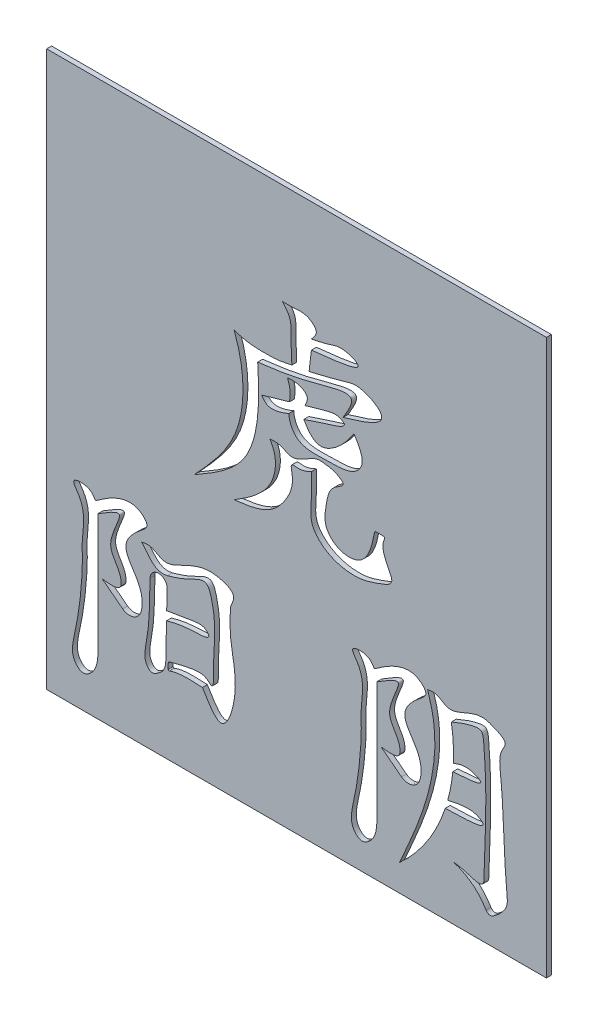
ISO-10303-21;
HEADER;
FILE_DESCRIPTION(('STEP AP214'),'2;1');
FILE_NAME('part.step','',(''),(''),'','','');
FILE_SCHEMA(('AUTOMOTIVE_DESIGN { 1 0 10303 214 1 1 1 1 }'));
ENDSEC;
DATA;
#1=APPLICATION_CONTEXT('core data for automotive mechanical design processes');
#2=APPLICATION_PROTOCOL_DEFINITION('international standard','automotive_design',2000,#1);
#3=PRODUCT_CONTEXT('',#1,'mechanical');
#4=PRODUCT('Part','Part','',(#3));
#5=PRODUCT_RELATED_PRODUCT_CATEGORY('part','',(#4));
#6=PRODUCT_DEFINITION_FORMATION('','',#4);
#7=PRODUCT_DEFINITION_CONTEXT('part definition',#1,'design');
#8=PRODUCT_DEFINITION('design','',#6,#7);
#9=PRODUCT_DEFINITION_SHAPE('','',#8);
#10=(LENGTH_UNIT() NAMED_UNIT(*) SI_UNIT(.MILLI.,.METRE.));
#11=(NAMED_UNIT(*) PLANE_ANGLE_UNIT() SI_UNIT($,.RADIAN.));
#12=(NAMED_UNIT(*) SI_UNIT($,.STERADIAN.) SOLID_ANGLE_UNIT());
#13=UNCERTAINTY_MEASURE_WITH_UNIT(LENGTH_MEASURE(1.E-05),#10,'distance_accuracy_value','');
#14=(GEOMETRIC_REPRESENTATION_CONTEXT(3) GLOBAL_UNCERTAINTY_ASSIGNED_CONTEXT((#13)) GLOBAL_UNIT_ASSIGNED_CONTEXT((#10,
#11,#12)) REPRESENTATION_CONTEXT('',''));
#15=CARTESIAN_POINT('',(0.,0.,0.));
#16=DIRECTION('',(0.,0.,1.));
#17=DIRECTION('',(1.,0.,0.));
#18=AXIS2_PLACEMENT_3D('',#15,#16,#17);
#19=CARTESIAN_POINT('',(19.2861268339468,35.5936177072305,0.));
#20=CARTESIAN_POINT('',(20.9614028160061,33.3700695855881,0.));
#21=CARTESIAN_POINT('',(21.0371606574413,31.5115750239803,0.));
#22=CARTESIAN_POINT('',(20.9857192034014,27.0692923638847,0.));
#23=CARTESIAN_POINT('',(20.6190480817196,19.7358699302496,0.));
#24=CARTESIAN_POINT('',(20.1038291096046,18.9872035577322,0.));
#25=CARTESIAN_POINT('',(19.883642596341,14.9504508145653,0.));
#26=CARTESIAN_POINT('',(21.2605817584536,12.6852746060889,0.));
#27=CARTESIAN_POINT('',(24.0390733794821,15.7326586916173,0.));
#28=CARTESIAN_POINT('',(27.5220752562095,16.4075742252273,0.));
#29=CARTESIAN_POINT('',(30.2305432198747,16.2597184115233,0.));
#30=CARTESIAN_POINT('',(31.6384260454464,16.1828618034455,0.));
#31=B_SPLINE_CURVE_WITH_KNOTS('',3,(#19,#20,#21,#22,#23,#24,#25,#26,#27,#28,#29,#30),
.UNSPECIFIED.,.F.,.F.,(4,1,2,2,1,1,1,4),(0.,0.118363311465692,0.391283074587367,
0.593314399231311,0.676491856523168,0.759669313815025,0.875074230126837,1.),.UNSPECIFIED.);
#32=DIRECTION('',(0.,0.,1.));
#33=VECTOR('',#32,1.);
#34=SURFACE_OF_LINEAR_EXTRUSION('',#31,#33);
#35=DIRECTION('',(0.,0.,1.));
#36=VECTOR('',#35,1.);
#37=CARTESIAN_POINT('',(23.174538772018,14.6400999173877,0.));
#38=LINE('',#37,#36);
#39=CARTESIAN_POINT('',(23.174538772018,14.6400999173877,0.));
#40=VERTEX_POINT('',#39);
#41=CARTESIAN_POINT('',(23.174538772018,14.6400999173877,1.));
#42=VERTEX_POINT('',#41);
#43=EDGE_CURVE('E674',#40,#42,#38,.T.);
#44=ORIENTED_EDGE('',*,*,#43,.F.);
#45=CARTESIAN_POINT('',(20.9997811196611,30.0842080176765,0.));
#46=VERTEX_POINT('',#45);
#47=EDGE_CURVE('E709',#46,#40,#31,.T.);
#48=ORIENTED_EDGE('',*,*,#47,.F.);
#49=DIRECTION('',(0.,0.,1.));
#50=VECTOR('',#49,1.);
#51=CARTESIAN_POINT('',(20.9997811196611,30.0842080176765,0.));
#52=LINE('',#51,#50);
#53=CARTESIAN_POINT('',(20.9997811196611,30.0842080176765,1.));
#54=VERTEX_POINT('',#53);
#55=EDGE_CURVE('E750',#46,#54,#52,.T.);
#56=ORIENTED_EDGE('',*,*,#55,.T.);
#57=CARTESIAN_POINT('',(19.2861268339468,35.5936177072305,1.));
#58=CARTESIAN_POINT('',(20.9614028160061,33.3700695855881,1.));
#59=CARTESIAN_POINT('',(21.0371606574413,31.5115750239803,1.));
#60=CARTESIAN_POINT('',(20.9857192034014,27.0692923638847,1.));
#61=CARTESIAN_POINT('',(20.6190480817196,19.7358699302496,1.));
#62=CARTESIAN_POINT('',(20.1038291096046,18.9872035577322,1.));
#63=CARTESIAN_POINT('',(19.883642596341,14.9504508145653,1.));
#64=CARTESIAN_POINT('',(21.2605817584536,12.6852746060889,1.));
#65=CARTESIAN_POINT('',(24.0390733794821,15.7326586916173,1.));
#66=CARTESIAN_POINT('',(27.5220752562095,16.4075742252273,1.));
#67=CARTESIAN_POINT('',(30.2305432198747,16.2597184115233,1.));
#68=CARTESIAN_POINT('',(31.6384260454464,16.1828618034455,1.));
#69=B_SPLINE_CURVE_WITH_KNOTS('',3,(#57,#58,#59,#60,#61,#62,#63,#64,#65,#66,#67,#68),
.UNSPECIFIED.,.F.,.F.,(4,1,2,2,1,1,1,4),(0.,0.118363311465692,0.391283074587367,
0.593314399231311,0.676491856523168,0.759669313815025,0.875074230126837,1.),.UNSPECIFIED.);
#70=EDGE_CURVE('E741',#54,#42,#69,.T.);
#71=ORIENTED_EDGE('',*,*,#70,.T.);
#72=EDGE_LOOP('',(#44,#48,#56,#71));
#73=FACE_BOUND('',#72,.T.);
#74=ADVANCED_FACE('F33',(#73),#34,.F.);
#75=CARTESIAN_POINT('',(0.,0.,1.));
#76=DIRECTION('',(1.,0.,0.));
#77=DIRECTION('',(0.,0.,-1.));
#78=AXIS2_PLACEMENT_3D('',#75,#76,#77);
#79=PLANE('',#78);
#80=DIRECTION('',(0.,-1.,0.));
#81=VECTOR('',#80,1.);
#82=CARTESIAN_POINT('',(0.,0.,0.));
#83=LINE('',#82,#81);
#84=CARTESIAN_POINT('',(0.,112.720139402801,0.));
#85=VERTEX_POINT('',#84);
#86=CARTESIAN_POINT('',(0.,0.,0.));
#87=VERTEX_POINT('',#86);
#88=EDGE_CURVE('E850',#85,#87,#83,.T.);
#89=ORIENTED_EDGE('',*,*,#88,.T.);
#90=DIRECTION('',(0.,0.,-1.));
#91=VECTOR('',#90,1.);
#92=CARTESIAN_POINT('',(0.,0.,1.));
#93=LINE('',#92,#91);
#94=CARTESIAN_POINT('',(0.,0.,1.));
#95=VERTEX_POINT('',#94);
#96=EDGE_CURVE('E869',#95,#87,#93,.T.);
#97=ORIENTED_EDGE('',*,*,#96,.F.);
#98=DIRECTION('',(0.,-1.,0.));
#99=VECTOR('',#98,1.);
#100=CARTESIAN_POINT('',(0.,0.,1.));
#101=LINE('',#100,#99);
#102=CARTESIAN_POINT('',(0.,112.720139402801,1.));
#103=VERTEX_POINT('',#102);
#104=EDGE_CURVE('E881',#103,#95,#101,.T.);
#105=ORIENTED_EDGE('',*,*,#104,.F.);
#106=DIRECTION('',(0.,0.,-1.));
#107=VECTOR('',#106,1.);
#108=CARTESIAN_POINT('',(0.,112.720139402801,1.));
#109=LINE('',#108,#107);
#110=EDGE_CURVE('E882',#103,#85,#109,.T.);
#111=ORIENTED_EDGE('',*,*,#110,.T.);
#112=EDGE_LOOP('',(#89,#97,#105,#111));
#113=FACE_BOUND('',#112,.T.);
#114=ADVANCED_FACE('F954',(#113),#79,.F.);
#115=CARTESIAN_POINT('',(0.,0.,1.));
#116=DIRECTION('',(0.,1.,0.));
#117=DIRECTION('',(0.,0.,1.));
#118=AXIS2_PLACEMENT_3D('',#115,#116,#117);
#119=PLANE('',#118);
#120=DIRECTION('',(1.,0.,0.));
#121=VECTOR('',#120,1.);
#122=CARTESIAN_POINT('',(0.,0.,0.));
#123=LINE('',#122,#121);
#124=CARTESIAN_POINT('',(101.515362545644,0.,0.));
#125=VERTEX_POINT('',#124);
#126=EDGE_CURVE('E873',#87,#125,#123,.T.);
#127=ORIENTED_EDGE('',*,*,#126,.T.);
#128=DIRECTION('',(0.,0.,-1.));
#129=VECTOR('',#128,1.);
#130=CARTESIAN_POINT('',(101.515362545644,0.,1.));
#131=LINE('',#130,#129);
#132=CARTESIAN_POINT('',(101.515362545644,0.,1.));
#133=VERTEX_POINT('',#132);
#134=EDGE_CURVE('E874',#133,#125,#131,.T.);
#135=ORIENTED_EDGE('',*,*,#134,.F.);
#136=DIRECTION('',(1.,0.,0.));
#137=VECTOR('',#136,1.);
#138=CARTESIAN_POINT('',(0.,0.,1.));
#139=LINE('',#138,#137);
#140=EDGE_CURVE('E889',#95,#133,#139,.T.);
#141=ORIENTED_EDGE('',*,*,#140,.F.);
#142=ORIENTED_EDGE('',*,*,#96,.T.);
#143=EDGE_LOOP('',(#127,#135,#141,#142));
#144=FACE_BOUND('',#143,.T.);
#145=ADVANCED_FACE('F959',(#144),#119,.F.);
#146=CARTESIAN_POINT('',(101.515362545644,0.,1.));
#147=DIRECTION('',(-1.,0.,0.));
#148=DIRECTION('',(0.,0.,1.));
#149=AXIS2_PLACEMENT_3D('',#146,#147,#148);
#150=PLANE('',#149);
#151=DIRECTION('',(0.,1.,0.));
#152=VECTOR('',#151,1.);
#153=CARTESIAN_POINT('',(101.515362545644,0.,0.));
#154=LINE('',#153,#152);
#155=CARTESIAN_POINT('',(101.515362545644,112.720139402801,0.));
#156=VERTEX_POINT('',#155);
#157=EDGE_CURVE('E872',#125,#156,#154,.T.);
#158=ORIENTED_EDGE('',*,*,#157,.T.);
#159=DIRECTION('',(0.,0.,-1.));
#160=VECTOR('',#159,1.);
#161=CARTESIAN_POINT('',(101.515362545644,112.720139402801,1.));
#162=LINE('',#161,#160);
#163=CARTESIAN_POINT('',(101.515362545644,112.720139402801,1.));
#164=VERTEX_POINT('',#163);
#165=EDGE_CURVE('E878',#164,#156,#162,.T.);
#166=ORIENTED_EDGE('',*,*,#165,.F.);
#167=DIRECTION('',(0.,1.,0.));
#168=VECTOR('',#167,1.);
#169=CARTESIAN_POINT('',(101.515362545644,0.,1.));
#170=LINE('',#169,#168);
#171=EDGE_CURVE('E887',#133,#164,#170,.T.);
#172=ORIENTED_EDGE('',*,*,#171,.F.);
#173=ORIENTED_EDGE('',*,*,#134,.T.);
#174=EDGE_LOOP('',(#158,#166,#172,#173));
#175=FACE_BOUND('',#174,.T.);
#176=ADVANCED_FACE('F1052',(#175),#150,.F.);
#177=CARTESIAN_POINT('',(0.,112.720139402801,1.));
#178=DIRECTION('',(0.,-1.,0.));
#179=DIRECTION('',(0.,0.,-1.));
#180=AXIS2_PLACEMENT_3D('',#177,#178,#179);
#181=PLANE('',#180);
#182=DIRECTION('',(-1.,0.,0.));
#183=VECTOR('',#182,1.);
#184=CARTESIAN_POINT('',(0.,112.720139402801,0.));
#185=LINE('',#184,#183);
#186=EDGE_CURVE('E877',#156,#85,#185,.T.);
#187=ORIENTED_EDGE('',*,*,#186,.T.);
#188=ORIENTED_EDGE('',*,*,#110,.F.);
#189=DIRECTION('',(-1.,0.,0.));
#190=VECTOR('',#189,1.);
#191=CARTESIAN_POINT('',(0.,112.720139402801,1.));
#192=LINE('',#191,#190);
#193=EDGE_CURVE('E885',#164,#103,#192,.T.);
#194=ORIENTED_EDGE('',*,*,#193,.F.);
#195=ORIENTED_EDGE('',*,*,#165,.T.);
#196=EDGE_LOOP('',(#187,#188,#194,#195));
#197=FACE_BOUND('',#196,.T.);
#198=ADVANCED_FACE('F1010',(#197),#181,.F.);
#199=CARTESIAN_POINT('',(0.,112.720139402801,1.));
#200=DIRECTION('',(0.,0.,-1.));
#201=DIRECTION('',(-1.,0.,0.));
#202=AXIS2_PLACEMENT_3D('',#199,#200,#201);
#203=PLANE('',#202);
#204=CARTESIAN_POINT('',(45.363722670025,66.7463764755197,1.));
#205=CARTESIAN_POINT('',(45.6369578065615,66.248975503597,1.));
#206=CARTESIAN_POINT('',(46.767790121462,64.1903929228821,1.));
#207=CARTESIAN_POINT('',(46.1439504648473,57.5367619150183,1.));
#208=CARTESIAN_POINT('',(41.3149426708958,54.47396029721,1.));
#209=CARTESIAN_POINT('',(38.0788396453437,52.4214596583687,1.));
#210=B_SPLINE_CURVE_WITH_KNOTS('',3,(#204,#205,#206,#207,#208,#209),.UNSPECIFIED.,.F.,.F.,(4,1,
1,4),(0.,0.0951010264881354,0.393592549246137,1.),.UNSPECIFIED.);
#211=CARTESIAN_POINT('',(45.363722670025,66.7463764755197,1.));
#212=VERTEX_POINT('',#211);
#213=CARTESIAN_POINT('',(38.0788396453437,52.4214596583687,1.));
#214=VERTEX_POINT('',#213);
#215=EDGE_CURVE('E448',#212,#214,#210,.T.);
#216=ORIENTED_EDGE('',*,*,#215,.F.);
#217=CARTESIAN_POINT('',(66.6050802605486,60.9449762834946,1.));
#218=CARTESIAN_POINT('',(66.0493195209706,58.0608585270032,1.));
#219=CARTESIAN_POINT('',(64.9840375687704,53.9221638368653,1.));
#220=CARTESIAN_POINT('',(59.3486017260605,53.9131795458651,1.));
#221=CARTESIAN_POINT('',(56.0958135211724,56.871915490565,1.));
#222=CARTESIAN_POINT('',(56.8289876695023,61.2311889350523,1.));
#223=CARTESIAN_POINT('',(57.4335101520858,64.604135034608,1.));
#224=CARTESIAN_POINT('',(60.9824721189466,66.1443735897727,1.));
#225=CARTESIAN_POINT('',(58.6196350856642,67.6486929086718,1.));
#226=CARTESIAN_POINT('',(56.9142640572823,67.9490337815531,1.));
#227=CARTESIAN_POINT('',(54.8342488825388,68.157432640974,1.));
#228=CARTESIAN_POINT('',(53.0711219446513,67.1180336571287,1.));
#229=CARTESIAN_POINT('',(51.5362338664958,66.2257599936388,1.));
#230=CARTESIAN_POINT('',(49.7184608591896,65.6170677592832,1.));
#231=CARTESIAN_POINT('',(48.2562778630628,66.3861574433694,1.));
#232=CARTESIAN_POINT('',(46.7969765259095,66.8846990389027,1.));
#233=CARTESIAN_POINT('',(45.7981484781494,66.7883026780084,1.));
#234=CARTESIAN_POINT('',(45.363722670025,66.7463764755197,1.));
#235=B_SPLINE_CURVE_WITH_KNOTS('',3,(#217,#218,#219,#220,#221,#222,#223,#224,#225,#226,#227,
#228,#229,#230,#231,#232,#233,#234),.UNSPECIFIED.,.F.,.F.,(4,1,1,1,1,1,1,1,1,1,1,1,1,1,1,4),(0.,
0.176947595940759,0.26300584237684,0.35355802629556,0.453959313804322,0.554620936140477,
0.603268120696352,0.642579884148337,0.697446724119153,0.743785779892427,0.783025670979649,
0.840028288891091,0.87418919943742,0.91239995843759,0.952561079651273,0.983473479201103),.UNSPECIFIED.);
#236=CARTESIAN_POINT('',(66.6050802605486,60.9449762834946,1.));
#237=VERTEX_POINT('',#236);
#238=EDGE_CURVE('E51',#237,#212,#235,.T.);
#239=ORIENTED_EDGE('',*,*,#238,.F.);
#240=CARTESIAN_POINT('',(66.8996609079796,60.8882114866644,1.));
#241=DIRECTION('',(0.,0.,1.));
#242=DIRECTION('',(-1.,0.,0.));
#243=AXIS2_PLACEMENT_3D('',#240,#241,#242);
#244=CIRCLE('',#243,0.3);
#245=CARTESIAN_POINT('',(66.8996609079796,61.1882114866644,1.));
#246=VERTEX_POINT('',#245);
#247=EDGE_CURVE('E486',#246,#237,#244,.T.);
#248=ORIENTED_EDGE('',*,*,#247,.F.);
#249=DIRECTION('',(-1.,0.,0.));
#250=VECTOR('',#249,1.);
#251=CARTESIAN_POINT('',(66.8996609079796,61.1882114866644,1.));
#252=LINE('',#251,#250);
#253=CARTESIAN_POINT('',(68.3668856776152,61.1882114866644,1.));
#254=VERTEX_POINT('',#253);
#255=EDGE_CURVE('E483',#254,#246,#252,.T.);
#256=ORIENTED_EDGE('',*,*,#255,.F.);
#257=CARTESIAN_POINT('',(68.3668856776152,60.8882114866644,1.));
#258=DIRECTION('',(0.,0.,1.));
#259=DIRECTION('',(1.,0.,0.));
#260=AXIS2_PLACEMENT_3D('',#257,#258,#259);
#261=CIRCLE('',#260,0.300000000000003);
#262=CARTESIAN_POINT('',(68.6291217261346,60.7424985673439,1.));
#263=VERTEX_POINT('',#262);
#264=EDGE_CURVE('E477',#263,#254,#261,.T.);
#265=ORIENTED_EDGE('',*,*,#264,.F.);
#266=CARTESIAN_POINT('',(53.7785735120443,65.2214659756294,1.));
#267=CARTESIAN_POINT('',(53.8236400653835,63.6885292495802,1.));
#268=CARTESIAN_POINT('',(53.9140403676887,60.6135671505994,1.));
#269=CARTESIAN_POINT('',(53.29450099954,56.2805350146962,1.));
#270=CARTESIAN_POINT('',(56.0343079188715,52.9874046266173,1.));
#271=CARTESIAN_POINT('',(59.531221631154,51.385273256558,1.));
#272=CARTESIAN_POINT('',(63.8811487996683,51.1298629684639,1.));
#273=CARTESIAN_POINT('',(66.9775976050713,52.1938525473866,1.));
#274=CARTESIAN_POINT('',(70.7767566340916,53.565819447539,1.));
#275=CARTESIAN_POINT('',(68.8714686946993,56.9178519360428,1.));
#276=CARTESIAN_POINT('',(67.8644691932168,59.3663717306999,1.));
#277=CARTESIAN_POINT('',(68.6291217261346,60.7424985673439,1.));
#278=B_SPLINE_CURVE_WITH_KNOTS('',3,(#266,#267,#268,#269,#270,#271,#272,#273,#274,#275,#276,
#277),.UNSPECIFIED.,.F.,.F.,(4,1,1,1,1,1,1,1,1,4),(0.,0.130906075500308,0.262588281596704,
0.344176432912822,0.471420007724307,0.580741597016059,0.693886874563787,0.777487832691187,
0.835003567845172,0.970831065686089),.UNSPECIFIED.);
#279=CARTESIAN_POINT('',(53.7785735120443,65.2214659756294,1.));
#280=VERTEX_POINT('',#279);
#281=EDGE_CURVE('E457',#280,#263,#278,.T.);
#282=ORIENTED_EDGE('',*,*,#281,.F.);
#283=CARTESIAN_POINT('',(45.363722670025,54.3622548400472,1.));
#284=CARTESIAN_POINT('',(46.9573524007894,55.3289427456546,1.));
#285=CARTESIAN_POINT('',(49.4133004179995,58.4537569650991,1.));
#286=CARTESIAN_POINT('',(50.1920607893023,61.7904100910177,1.));
#287=CARTESIAN_POINT('',(49.4607094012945,64.7072053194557,1.));
#288=CARTESIAN_POINT('',(51.7330533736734,64.2553691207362,1.));
#289=CARTESIAN_POINT('',(52.9091556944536,64.8108409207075,1.));
#290=CARTESIAN_POINT('',(53.7785735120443,65.2214659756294,1.));
#291=B_SPLINE_CURVE_WITH_KNOTS('',3,(#283,#284,#285,#286,#287,#288,#289,#290),.UNSPECIFIED.,.F.,
.F.,(4,1,1,1,1,4),(0.,0.250439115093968,0.433354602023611,0.485957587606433,0.530696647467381,
0.657527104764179),.UNSPECIFIED.);
#292=CARTESIAN_POINT('',(45.363722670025,54.3622548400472,1.));
#293=VERTEX_POINT('',#292);
#294=EDGE_CURVE('E455',#293,#280,#291,.T.);
#295=ORIENTED_EDGE('',*,*,#294,.F.);
#296=CARTESIAN_POINT('',(38.0788396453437,52.4214596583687,1.));
#297=CARTESIAN_POINT('',(40.6316450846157,52.7308894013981,1.));
#298=CARTESIAN_POINT('',(43.1844505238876,53.0403191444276,1.));
#299=CARTESIAN_POINT('',(45.363722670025,54.3622548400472,1.));
#300=B_SPLINE_CURVE_WITH_KNOTS('',3,(#296,#297,#298,#299),.UNSPECIFIED.,.F.,.F.,(4,4),
(0.657527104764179,1.),.UNSPECIFIED.);
#301=EDGE_CURVE('E439',#214,#293,#300,.T.);
#302=ORIENTED_EDGE('',*,*,#301,.F.);
#303=EDGE_LOOP('',(#216,#239,#248,#256,#265,#282,#295,#302));
#304=FACE_BOUND('',#303,.T.);
#305=DIRECTION('',(-0.960606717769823,-0.277911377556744,0.));
#306=VECTOR('',#305,1.);
#307=CARTESIAN_POINT('',(49.3379816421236,75.2860846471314,1.));
#308=LINE('',#307,#306);
#309=CARTESIAN_POINT('',(49.3379816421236,75.2860846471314,1.));
#310=VERTEX_POINT('',#309);
#311=CARTESIAN_POINT('',(43.6742232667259,73.6475130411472,1.));
#312=VERTEX_POINT('',#311);
#313=EDGE_CURVE('E1810',#310,#312,#308,.T.);
#314=ORIENTED_EDGE('',*,*,#313,.F.);
#315=CARTESIAN_POINT('',(48.9272659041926,79.3112848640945,1.));
#316=CARTESIAN_POINT('',(49.0897835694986,78.8687324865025,1.));
#317=CARTESIAN_POINT('',(49.566442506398,77.5707410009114,1.));
#318=CARTESIAN_POINT('',(49.4356923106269,76.1974812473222,1.));
#319=CARTESIAN_POINT('',(49.3379816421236,75.2860846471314,1.));
#320=B_SPLINE_CURVE_WITH_KNOTS('',3,(#315,#316,#317,#318,#319),.UNSPECIFIED.,.F.,.F.,(4,1,4),
(0.,0.0479089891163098,0.140515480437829),.UNSPECIFIED.);
#321=CARTESIAN_POINT('',(48.9272659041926,79.3112848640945,1.));
#322=VERTEX_POINT('',#321);
#323=EDGE_CURVE('E1792',#322,#310,#320,.T.);
#324=ORIENTED_EDGE('',*,*,#323,.F.);
#325=CARTESIAN_POINT('',(52.4864813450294,76.1969713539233,1.));
#326=CARTESIAN_POINT('',(52.7764423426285,76.8285349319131,1.));
#327=CARTESIAN_POINT('',(53.3998067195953,78.1862838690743,1.));
#328=CARTESIAN_POINT('',(51.0896137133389,79.4790917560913,1.));
#329=CARTESIAN_POINT('',(49.6674299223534,79.36872457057,1.));
#330=CARTESIAN_POINT('',(48.9272659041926,79.3112848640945,1.));
#331=B_SPLINE_CURVE_WITH_KNOTS('',3,(#325,#326,#327,#328,#329,#330),.UNSPECIFIED.,.F.,.F.,(4,1,
1,4),(0.,0.294319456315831,0.632734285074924,1.),.UNSPECIFIED.);
#332=CARTESIAN_POINT('',(52.4864813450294,76.1969713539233,1.));
#333=VERTEX_POINT('',#332);
#334=EDGE_CURVE('E546',#333,#322,#331,.T.);
#335=ORIENTED_EDGE('',*,*,#334,.F.);
#336=DIRECTION('',(-0.960606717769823,-0.277911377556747,0.));
#337=VECTOR('',#336,1.);
#338=CARTESIAN_POINT('',(56.15764801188,77.2590698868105,1.));
#339=LINE('',#338,#337);
#340=CARTESIAN_POINT('',(56.15764801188,77.2590698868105,1.));
#341=VERTEX_POINT('',#340);
#342=EDGE_CURVE('E1845',#341,#333,#339,.T.);
#343=ORIENTED_EDGE('',*,*,#342,.F.);
#344=CARTESIAN_POINT('',(52.2457839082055,73.6475130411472,1.));
#345=CARTESIAN_POINT('',(53.6784646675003,74.138847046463,1.));
#346=CARTESIAN_POINT('',(56.1638088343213,74.9911891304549,1.));
#347=CARTESIAN_POINT('',(60.3412238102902,76.1729225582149,1.));
#348=CARTESIAN_POINT('',(60.5271484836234,77.0281261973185,1.));
#349=CARTESIAN_POINT('',(59.0584533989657,77.9705252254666,1.));
#350=CARTESIAN_POINT('',(57.7154648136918,77.6380316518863,1.));
#351=CARTESIAN_POINT('',(56.5199796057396,77.3472123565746,1.));
#352=CARTESIAN_POINT('',(56.15764801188,77.2590698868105,1.));
#353=B_SPLINE_CURVE_WITH_KNOTS('',3,(#344,#345,#346,#347,#348,#349,#350,#351,#352),
.UNSPECIFIED.,.F.,.F.,(4,1,2,1,1,4),(0.,0.380263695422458,0.659662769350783,0.728255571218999,
0.917638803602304,1.),.UNSPECIFIED.);
#354=CARTESIAN_POINT('',(52.2457839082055,73.6475130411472,1.));
#355=VERTEX_POINT('',#354);
#356=EDGE_CURVE('E1837',#355,#341,#353,.T.);
#357=ORIENTED_EDGE('',*,*,#356,.F.);
#358=CARTESIAN_POINT('',(62.4498934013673,76.1969713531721,1.));
#359=CARTESIAN_POINT('',(61.9212733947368,75.4603317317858,1.));
#360=CARTESIAN_POINT('',(60.653861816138,73.6941753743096,1.));
#361=CARTESIAN_POINT('',(58.4782639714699,71.550724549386,1.));
#362=CARTESIAN_POINT('',(55.6123650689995,70.2328044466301,1.));
#363=CARTESIAN_POINT('',(53.4111783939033,71.6189686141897,1.));
#364=CARTESIAN_POINT('',(52.6836297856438,72.885376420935,1.));
#365=CARTESIAN_POINT('',(52.2457839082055,73.6475130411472,1.));
#366=B_SPLINE_CURVE_WITH_KNOTS('',3,(#358,#359,#360,#361,#362,#363,#364,#365),.UNSPECIFIED.,.F.,
.F.,(4,1,1,1,1,4),(0.,0.19765291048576,0.473889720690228,0.681414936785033,0.808272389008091,
1.),.UNSPECIFIED.);
#367=CARTESIAN_POINT('',(62.4498934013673,76.1969713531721,1.));
#368=VERTEX_POINT('',#367);
#369=EDGE_CURVE('E1829',#368,#355,#366,.T.);
#370=ORIENTED_EDGE('',*,*,#369,.F.);
#371=CARTESIAN_POINT('',(49.2076798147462,73.162061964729,1.));
#372=CARTESIAN_POINT('',(49.2216854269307,72.8167750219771,1.));
#373=CARTESIAN_POINT('',(49.3816608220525,71.4724421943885,1.));
#374=CARTESIAN_POINT('',(51.1933158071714,68.4995946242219,1.));
#375=CARTESIAN_POINT('',(55.2288458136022,68.7296841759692,1.));
#376=CARTESIAN_POINT('',(59.2120042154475,68.7537673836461,1.));
#377=CARTESIAN_POINT('',(62.4302493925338,68.9973932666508,1.));
#378=CARTESIAN_POINT('',(64.8126203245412,72.3010702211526,1.));
#379=CARTESIAN_POINT('',(63.4936231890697,74.4759649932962,1.));
#380=CARTESIAN_POINT('',(62.4498934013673,76.1969713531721,1.));
#381=B_SPLINE_CURVE_WITH_KNOTS('',3,(#371,#372,#373,#374,#375,#376,#377,#378,#379,#380),
.UNSPECIFIED.,.F.,.F.,(4,1,1,1,1,1,1,4),(0.212484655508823,0.247802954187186,0.35081485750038,
0.531168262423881,0.608054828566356,0.775403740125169,0.822275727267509,1.),.UNSPECIFIED.);
#382=CARTESIAN_POINT('',(49.2076798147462,73.162061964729,1.));
#383=VERTEX_POINT('',#382);
#384=EDGE_CURVE('E1821',#383,#368,#381,.T.);
#385=ORIENTED_EDGE('',*,*,#384,.F.);
#386=CARTESIAN_POINT('',(43.6742232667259,73.6475130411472,1.));
#387=CARTESIAN_POINT('',(43.9166580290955,73.2840173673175,1.));
#388=CARTESIAN_POINT('',(44.7594436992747,72.0203828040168,1.));
#389=CARTESIAN_POINT('',(47.2408544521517,72.3435032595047,1.));
#390=CARTESIAN_POINT('',(48.691021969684,72.9470379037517,1.));
#391=CARTESIAN_POINT('',(49.2076798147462,73.162061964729,1.));
#392=B_SPLINE_CURVE_WITH_KNOTS('',3,(#386,#387,#388,#389,#390,#391),.UNSPECIFIED.,.F.,.F.,(4,1,
1,4),(0.,0.206317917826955,0.717231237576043,1.),.UNSPECIFIED.);
#393=EDGE_CURVE('E1816',#312,#383,#392,.T.);
#394=ORIENTED_EDGE('',*,*,#393,.F.);
#395=EDGE_LOOP('',(#314,#324,#335,#343,#357,#370,#385,#394));
#396=FACE_BOUND('',#395,.T.);
#397=CARTESIAN_POINT('',(38.0788396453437,82.2936282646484,1.));
#398=CARTESIAN_POINT('',(38.3254470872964,81.5895998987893,1.));
#399=CARTESIAN_POINT('',(40.2888308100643,75.9844250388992,1.));
#400=CARTESIAN_POINT('',(40.329375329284,63.9922263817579,1.));
#401=CARTESIAN_POINT('',(33.3208909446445,56.4136024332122,1.));
#402=CARTESIAN_POINT('',(29.9417693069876,52.7595895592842,1.));
#403=B_SPLINE_CURVE_WITH_KNOTS('',3,(#397,#398,#399,#400,#401,#402),.UNSPECIFIED.,.F.,.F.,(4,1,
1,4),(0.,0.0692369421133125,0.551235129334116,1.),.UNSPECIFIED.);
#404=CARTESIAN_POINT('',(38.0788396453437,82.2936282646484,1.));
#405=VERTEX_POINT('',#404);
#406=CARTESIAN_POINT('',(29.9417693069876,52.7595895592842,1.));
#407=VERTEX_POINT('',#406);
#408=EDGE_CURVE('E550',#405,#407,#403,.T.);
#409=ORIENTED_EDGE('',*,*,#408,.F.);
#410=CARTESIAN_POINT('',(49.8025139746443,81.9869736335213,1.));
#411=CARTESIAN_POINT('',(48.3529039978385,81.6429615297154,1.));
#412=CARTESIAN_POINT('',(46.3632634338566,81.1707928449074,1.));
#413=CARTESIAN_POINT('',(40.5247878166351,81.4861282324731,1.));
#414=CARTESIAN_POINT('',(38.8640598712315,82.0343973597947,1.));
#415=CARTESIAN_POINT('',(38.0788396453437,82.2936282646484,1.));
#416=B_SPLINE_CURVE_WITH_KNOTS('',3,(#410,#411,#412,#413,#414,#415),.UNSPECIFIED.,.F.,.F.,(4,1,
1,4),(0.,0.585942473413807,0.804226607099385,1.),.UNSPECIFIED.);
#417=CARTESIAN_POINT('',(49.8025139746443,81.9869736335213,1.));
#418=VERTEX_POINT('',#417);
#419=EDGE_CURVE('E530',#418,#405,#416,.T.);
#420=ORIENTED_EDGE('',*,*,#419,.F.);
#421=CARTESIAN_POINT('',(47.8944948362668,92.220894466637,1.));
#422=CARTESIAN_POINT('',(48.5443045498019,91.4559419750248,1.));
#423=CARTESIAN_POINT('',(49.6642576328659,90.1375392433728,1.));
#424=CARTESIAN_POINT('',(49.5920864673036,86.4485310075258,1.));
#425=CARTESIAN_POINT('',(49.7135281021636,83.8736831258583,1.));
#426=CARTESIAN_POINT('',(49.8025139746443,81.9869736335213,1.));
#427=B_SPLINE_CURVE_WITH_KNOTS('',3,(#421,#422,#423,#424,#425,#426),.UNSPECIFIED.,.F.,.F.,(4,1,
1,4),(0.,0.269745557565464,0.464908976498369,1.),.UNSPECIFIED.);
#428=CARTESIAN_POINT('',(47.8944948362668,92.220894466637,1.));
#429=VERTEX_POINT('',#428);
#430=EDGE_CURVE('E606',#429,#418,#427,.T.);
#431=ORIENTED_EDGE('',*,*,#430,.F.);
#432=CARTESIAN_POINT('',(53.7785735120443,88.559613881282,1.));
#433=CARTESIAN_POINT('',(54.2832235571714,89.1308550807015,1.));
#434=CARTESIAN_POINT('',(55.4733912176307,90.4780714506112,1.));
#435=CARTESIAN_POINT('',(52.6373699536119,92.6479882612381,1.));
#436=CARTESIAN_POINT('',(50.184853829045,92.1460259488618,1.));
#437=CARTESIAN_POINT('',(48.5336459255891,92.2000015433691,1.));
#438=CARTESIAN_POINT('',(47.8944948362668,92.220894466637,1.));
#439=B_SPLINE_CURVE_WITH_KNOTS('',3,(#432,#433,#434,#435,#436,#437,#438),.UNSPECIFIED.,.F.,.F.,
(4,1,1,1,4),(0.,0.205986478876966,0.485798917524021,0.800962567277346,1.),.UNSPECIFIED.);
#440=CARTESIAN_POINT('',(53.7785735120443,88.559613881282,1.));
#441=VERTEX_POINT('',#440);
#442=EDGE_CURVE('E598',#441,#429,#439,.T.);
#443=ORIENTED_EDGE('',*,*,#442,.F.);
#444=CARTESIAN_POINT('',(53.7785735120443,86.6123475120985,1.));
#445=CARTESIAN_POINT('',(59.1661692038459,87.1810748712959,1.));
#446=CARTESIAN_POINT('',(66.692022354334,87.9755217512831,1.));
#447=CARTESIAN_POINT('',(59.8312186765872,90.3310887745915,1.));
#448=CARTESIAN_POINT('',(56.9515159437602,89.1690299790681,1.));
#449=CARTESIAN_POINT('',(55.0554212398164,88.8048536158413,1.));
#450=CARTESIAN_POINT('',(53.7785735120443,88.559613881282,1.));
#451=B_SPLINE_CURVE_WITH_KNOTS('',3,(#444,#445,#446,#447,#448,#449,#450),.UNSPECIFIED.,.F.,.F.,
(4,1,1,1,4),(0.,0.50020236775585,0.698725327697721,0.797118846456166,1.),.UNSPECIFIED.);
#452=CARTESIAN_POINT('',(53.7785735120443,86.6123475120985,1.));
#453=VERTEX_POINT('',#452);
#454=EDGE_CURVE('E590',#453,#441,#451,.T.);
#455=ORIENTED_EDGE('',*,*,#454,.F.);
#456=CARTESIAN_POINT('',(53.3002975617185,82.594070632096,1.));
#457=CARTESIAN_POINT('',(53.4597228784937,83.9334962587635,1.));
#458=CARTESIAN_POINT('',(53.619148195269,85.272921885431,1.));
#459=CARTESIAN_POINT('',(53.7785735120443,86.6123475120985,1.));
#460=B_SPLINE_CURVE_WITH_KNOTS('',3,(#456,#457,#458,#459),.UNSPECIFIED.,.F.,.F.,(4,4),(0.,1.),.UNSPECIFIED.);
#461=CARTESIAN_POINT('',(53.3002975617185,82.594070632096,1.));
#462=VERTEX_POINT('',#461);
#463=EDGE_CURVE('E582',#462,#453,#460,.T.);
#464=ORIENTED_EDGE('',*,*,#463,.F.);
#465=CARTESIAN_POINT('',(60.2067864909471,77.974877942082,1.));
#466=CARTESIAN_POINT('',(64.4753287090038,79.2495983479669,1.));
#467=CARTESIAN_POINT('',(71.7767890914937,81.4300431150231,1.));
#468=CARTESIAN_POINT('',(63.7846777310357,85.4362352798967,1.));
#469=CARTESIAN_POINT('',(58.9102748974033,83.9305386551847,1.));
#470=CARTESIAN_POINT('',(55.9198233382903,83.2181217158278,1.));
#471=CARTESIAN_POINT('',(53.3002975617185,82.594070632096,1.));
#472=B_SPLINE_CURVE_WITH_KNOTS('',3,(#465,#466,#467,#468,#469,#470,#471),.UNSPECIFIED.,.F.,.F.,
(4,1,1,1,4),(0.,0.364927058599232,0.624217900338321,0.670828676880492,1.),.UNSPECIFIED.);
#473=CARTESIAN_POINT('',(60.2067864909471,77.974877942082,1.));
#474=VERTEX_POINT('',#473);
#475=EDGE_CURVE('E574',#474,#462,#472,.T.);
#476=ORIENTED_EDGE('',*,*,#475,.F.);
#477=CARTESIAN_POINT('',(42.8642625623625,79.0382167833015,1.));
#478=CARTESIAN_POINT('',(46.268548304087,79.4515474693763,1.));
#479=CARTESIAN_POINT('',(51.6420892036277,80.1039748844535,1.));
#480=CARTESIAN_POINT('',(63.7457945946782,83.8919234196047,1.));
#481=CARTESIAN_POINT('',(61.1840553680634,79.6088228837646,1.));
#482=CARTESIAN_POINT('',(60.2067864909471,77.974877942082,1.));
#483=B_SPLINE_CURVE_WITH_KNOTS('',3,(#477,#478,#479,#480,#481,#482),.UNSPECIFIED.,.F.,.F.,(4,1,
1,4),(0.,0.516729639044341,0.815638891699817,1.),.UNSPECIFIED.);
#484=CARTESIAN_POINT('',(42.8642625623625,79.0382167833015,1.));
#485=VERTEX_POINT('',#484);
#486=EDGE_CURVE('E566',#485,#474,#483,.T.);
#487=ORIENTED_EDGE('',*,*,#486,.F.);
#488=CARTESIAN_POINT('',(29.9417693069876,52.7595895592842,1.));
#489=CARTESIAN_POINT('',(34.0581858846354,55.1253473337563,1.));
#490=CARTESIAN_POINT('',(40.5828157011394,58.8751363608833,1.));
#491=CARTESIAN_POINT('',(43.3379591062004,69.6245128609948,1.));
#492=CARTESIAN_POINT('',(43.0351518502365,75.6421583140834,1.));
#493=CARTESIAN_POINT('',(42.8642625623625,79.0382167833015,1.));
#494=B_SPLINE_CURVE_WITH_KNOTS('',3,(#488,#489,#490,#491,#492,#493),.UNSPECIFIED.,.F.,.F.,(4,1,
1,4),(0.,0.42682468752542,0.676528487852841,1.),.UNSPECIFIED.);
#495=EDGE_CURVE('E558',#407,#485,#494,.T.);
#496=ORIENTED_EDGE('',*,*,#495,.F.);
#497=EDGE_LOOP('',(#409,#420,#431,#443,#455,#464,#476,#487,#496));
#498=FACE_BOUND('',#497,.T.);
#499=CARTESIAN_POINT('',(24.9485739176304,15.725171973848,1.));
#500=VERTEX_POINT('',#499);
#501=CARTESIAN_POINT('',(31.6384260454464,16.1828618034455,1.));
#502=VERTEX_POINT('',#501);
#503=EDGE_CURVE('E711',#500,#502,#69,.T.);
#504=ORIENTED_EDGE('',*,*,#503,.F.);
#505=CARTESIAN_POINT('',(24.874538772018,15.9109643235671,1.));
#506=DIRECTION('',(0.,0.,-1.));
#507=DIRECTION('',(-1.,0.,0.));
#508=AXIS2_PLACEMENT_3D('',#505,#506,#507);
#509=CIRCLE('',#508,0.2);
#510=CARTESIAN_POINT('',(24.674538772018,15.9109643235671,1.));
#511=VERTEX_POINT('',#510);
#512=EDGE_CURVE('E982',#500,#511,#509,.T.);
#513=ORIENTED_EDGE('',*,*,#512,.T.);
#514=DIRECTION('',(0.,1.,0.));
#515=VECTOR('',#514,1.);
#516=CARTESIAN_POINT('',(24.674538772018,17.2526143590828,1.));
#517=LINE('',#516,#515);
#518=CARTESIAN_POINT('',(24.674538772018,16.8740902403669,1.));
#519=VERTEX_POINT('',#518);
#520=EDGE_CURVE('E669',#511,#519,#517,.T.);
#521=ORIENTED_EDGE('',*,*,#520,.T.);
#522=CARTESIAN_POINT('',(25.174538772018,16.8740902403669,1.));
#523=DIRECTION('',(0.,0.,-1.));
#524=DIRECTION('',(-1.,0.,0.));
#525=AXIS2_PLACEMENT_3D('',#522,#523,#524);
#526=CIRCLE('',#525,0.5);
#527=CARTESIAN_POINT('',(25.0394535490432,17.3554964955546,1.));
#528=VERTEX_POINT('',#527);
#529=EDGE_CURVE('E699',#519,#528,#526,.T.);
#530=ORIENTED_EDGE('',*,*,#529,.T.);
#531=CARTESIAN_POINT('',(24.1935366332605,17.1160971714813,1.));
#532=CARTESIAN_POINT('',(26.120289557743,17.6636934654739,1.));
#533=CARTESIAN_POINT('',(28.9032929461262,18.4546419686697,1.));
#534=CARTESIAN_POINT('',(32.1839735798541,18.6299418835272,1.));
#535=CARTESIAN_POINT('',(33.9027202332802,16.8103593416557,1.));
#536=CARTESIAN_POINT('',(33.7426730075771,25.3882940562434,1.));
#537=CARTESIAN_POINT('',(34.8300993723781,28.1811596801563,1.));
#538=CARTESIAN_POINT('',(32.5634788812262,35.9775142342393,1.));
#539=CARTESIAN_POINT('',(28.325841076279,33.3745932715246,1.));
#540=CARTESIAN_POINT('',(25.8546067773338,32.6697315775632,1.));
#541=CARTESIAN_POINT('',(24.5066206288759,32.285250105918,1.));
#542=B_SPLINE_CURVE_WITH_KNOTS('',3,(#531,#532,#533,#534,#535,#536,#537,#538,#539,#540,#541),
.UNSPECIFIED.,.F.,.F.,(4,1,1,1,1,1,1,1,4),(0.,0.167988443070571,0.242642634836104,
0.271414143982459,0.325588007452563,0.69658284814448,0.76677632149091,0.872783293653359,1.),.UNSPECIFIED.);
#543=CARTESIAN_POINT('',(24.5066206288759,32.285250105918,1.));
#544=VERTEX_POINT('',#543);
#545=EDGE_CURVE('E680',#528,#544,#542,.T.);
#546=ORIENTED_EDGE('',*,*,#545,.T.);
#547=CARTESIAN_POINT('',(24.5066206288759,32.285250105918,1.));
#548=CARTESIAN_POINT('',(21.8781424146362,31.691164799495,1.));
#549=CARTESIAN_POINT('',(20.8800002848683,33.7729585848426,1.));
#550=CARTESIAN_POINT('',(19.2861268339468,35.5936177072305,1.));
#551=B_SPLINE_CURVE_WITH_KNOTS('',3,(#547,#548,#549,#550),.UNSPECIFIED.,.F.,.F.,(4,4),(0.,1.),.UNSPECIFIED.);
#552=CARTESIAN_POINT('',(19.2861268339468,35.5936177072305,1.));
#553=VERTEX_POINT('',#552);
#554=EDGE_CURVE('E746',#544,#553,#551,.T.);
#555=ORIENTED_EDGE('',*,*,#554,.T.);
#556=CARTESIAN_POINT('',(37.7512648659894,25.116221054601,1.));
#557=CARTESIAN_POINT('',(37.1625921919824,28.2146724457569,1.));
#558=CARTESIAN_POINT('',(37.1407196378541,31.119491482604,1.));
#559=CARTESIAN_POINT('',(37.4270832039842,33.6394908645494,1.));
#560=CARTESIAN_POINT('',(38.9238297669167,35.9189404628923,1.));
#561=CARTESIAN_POINT('',(35.6281101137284,37.1173390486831,1.));
#562=CARTESIAN_POINT('',(32.0351389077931,37.6231298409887,1.));
#563=CARTESIAN_POINT('',(28.2750437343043,36.1170179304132,1.));
#564=CARTESIAN_POINT('',(23.9535414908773,33.743790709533,1.));
#565=CARTESIAN_POINT('',(21.4563314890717,35.982678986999,1.));
#566=CARTESIAN_POINT('',(19.8655035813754,35.6974848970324,1.));
#567=CARTESIAN_POINT('',(19.2861268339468,35.5936177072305,1.));
#568=B_SPLINE_CURVE_WITH_KNOTS('',3,(#556,#557,#558,#559,#560,#561,#562,#563,#564,#565,#566,
#567),.UNSPECIFIED.,.F.,.F.,(4,2,1,1,1,1,1,1,4),(0.,0.18085246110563,0.222556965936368,
0.292626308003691,0.325059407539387,0.45197972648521,0.529135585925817,0.589217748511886,
0.623633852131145),.UNSPECIFIED.);
#569=CARTESIAN_POINT('',(37.7512648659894,25.116221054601,1.));
#570=VERTEX_POINT('',#569);
#571=EDGE_CURVE('E901',#570,#553,#568,.T.);
#572=ORIENTED_EDGE('',*,*,#571,.F.);
#573=CARTESIAN_POINT('',(31.6384260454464,16.1828618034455,1.));
#574=CARTESIAN_POINT('',(32.9676248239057,13.9682765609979,1.));
#575=CARTESIAN_POINT('',(35.8511269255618,9.16405818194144,1.));
#576=CARTESIAN_POINT('',(38.872787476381,18.0625639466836,1.));
#577=CARTESIAN_POINT('',(38.1557660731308,22.9871476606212,1.));
#578=CARTESIAN_POINT('',(37.7512648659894,25.116221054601,1.));
#579=B_SPLINE_CURVE_WITH_KNOTS('',3,(#573,#574,#575,#576,#577,#578),.UNSPECIFIED.,.F.,.F.,(4,1,
1,4),(0.623633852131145,0.739841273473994,0.875728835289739,1.),.UNSPECIFIED.);
#580=EDGE_CURVE('E1102',#502,#570,#579,.T.);
#581=ORIENTED_EDGE('',*,*,#580,.F.);
#582=EDGE_LOOP('',(#504,#513,#521,#530,#546,#555,#572,#581));
#583=FACE_BOUND('',#582,.T.);
#584=DIRECTION('',(0.791052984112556,-0.611747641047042,0.));
#585=VECTOR('',#584,1.);
#586=CARTESIAN_POINT('',(67.953973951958,23.8697858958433,0.999999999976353));
#587=LINE('',#586,#585);
#588=CARTESIAN_POINT('',(67.953973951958,23.8697858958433,1.));
#589=VERTEX_POINT('',#588);
#590=CARTESIAN_POINT('',(72.089788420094,20.6714227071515,0.999999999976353));
#591=VERTEX_POINT('',#590);
#592=EDGE_CURVE('E766',#589,#591,#587,.T.);
#593=ORIENTED_EDGE('',*,*,#592,.F.);
#594=CARTESIAN_POINT('',(67.0716668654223,34.8986244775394,0.999999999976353));
#595=CARTESIAN_POINT('',(69.0227100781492,36.1105669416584,0.999999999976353));
#596=CARTESIAN_POINT('',(73.6000792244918,38.9539217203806,0.999999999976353));
#597=CARTESIAN_POINT('',(67.9520104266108,30.4935531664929,0.999999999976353));
#598=CARTESIAN_POINT('',(71.5113952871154,27.6212351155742,0.999999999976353));
#599=CARTESIAN_POINT('',(72.1104452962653,23.3706136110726,0.999999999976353));
#600=CARTESIAN_POINT('',(69.5912250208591,23.6731598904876,0.999999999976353));
#601=CARTESIAN_POINT('',(67.953973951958,23.8697858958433,0.999999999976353));
#602=B_SPLINE_CURVE_WITH_KNOTS('',3,(#594,#595,#596,#597,#598,#599,#600,#601),.UNSPECIFIED.,.F.,
.F.,(4,1,1,1,1,4),(0.,0.219637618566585,0.515294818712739,0.734105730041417,0.827194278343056,
1.),.UNSPECIFIED.);
#603=CARTESIAN_POINT('',(67.0716668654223,34.8986244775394,0.999999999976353));
#604=VERTEX_POINT('',#603);
#605=EDGE_CURVE('E762',#604,#589,#602,.T.);
#606=ORIENTED_EDGE('',*,*,#605,.F.);
#607=DIRECTION('',(0.,1.,0.));
#608=VECTOR('',#607,1.);
#609=CARTESIAN_POINT('',(67.0716668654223,10.5800354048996,0.999999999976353));
#610=LINE('',#609,#608);
#611=CARTESIAN_POINT('',(67.0716668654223,10.5800354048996,0.999999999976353));
#612=VERTEX_POINT('',#611);
#613=EDGE_CURVE('E786',#612,#604,#610,.T.);
#614=ORIENTED_EDGE('',*,*,#613,.F.);
#615=CARTESIAN_POINT('',(66.575369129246,36.9389596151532,0.999999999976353));
#616=CARTESIAN_POINT('',(66.2554765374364,37.4669762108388,0.999999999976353));
#617=CARTESIAN_POINT('',(65.3980859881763,38.8821901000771,0.999999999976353));
#618=CARTESIAN_POINT('',(61.1455076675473,38.7983105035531,0.999999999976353));
#619=CARTESIAN_POINT('',(65.2533277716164,34.0900384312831,0.999999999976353));
#620=CARTESIAN_POINT('',(63.771525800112,30.1046384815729,0.999999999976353));
#621=CARTESIAN_POINT('',(64.0574344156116,22.8139687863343,0.999999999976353));
#622=CARTESIAN_POINT('',(63.425886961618,15.3815707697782,0.999999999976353));
#623=CARTESIAN_POINT('',(61.3512156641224,7.2608751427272,0.999999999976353));
#624=CARTESIAN_POINT('',(63.8970322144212,4.95766760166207,0.999999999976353));
#625=CARTESIAN_POINT('',(66.7260315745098,6.64417112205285,0.999999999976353));
#626=CARTESIAN_POINT('',(67.0716668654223,8.93699551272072,0.999999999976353));
#627=CARTESIAN_POINT('',(67.0716668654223,10.5800354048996,0.999999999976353));
#628=B_SPLINE_CURVE_WITH_KNOTS('',3,(#615,#616,#617,#618,#619,#620,#621,#622,#623,#624,#625,
#626,#627),.UNSPECIFIED.,.F.,.F.,(4,1,1,1,2,1,1,1,1,4),(0.,0.0412905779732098,0.110668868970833,
0.15307155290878,0.350821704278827,0.708580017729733,0.815569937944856,0.856410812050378,
0.897755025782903,1.),.UNSPECIFIED.);
#629=CARTESIAN_POINT('',(66.575369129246,36.9389596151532,0.999999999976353));
#630=VERTEX_POINT('',#629);
#631=EDGE_CURVE('E778',#630,#612,#628,.T.);
#632=ORIENTED_EDGE('',*,*,#631,.F.);
#633=CARTESIAN_POINT('',(72.089788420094,20.6714227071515,0.999999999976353));
#634=CARTESIAN_POINT('',(72.9418150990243,20.0125220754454,0.999999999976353));
#635=CARTESIAN_POINT('',(75.5932576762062,20.2393622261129,0.999999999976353));
#636=CARTESIAN_POINT('',(76.4083788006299,24.1808939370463,0.999999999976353));
#637=CARTESIAN_POINT('',(75.0149831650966,27.8330121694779,0.999999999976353));
#638=CARTESIAN_POINT('',(71.3456605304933,32.1632913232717,0.999999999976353));
#639=CARTESIAN_POINT('',(74.7336604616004,35.5427810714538,0.999999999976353));
#640=CARTESIAN_POINT('',(77.771552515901,37.8482645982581,0.999999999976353));
#641=CARTESIAN_POINT('',(75.321514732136,40.1021800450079,0.999999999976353));
#642=CARTESIAN_POINT('',(71.3284263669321,40.2507871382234,0.999999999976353));
#643=CARTESIAN_POINT('',(68.638134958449,38.376250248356,0.999999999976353));
#644=CARTESIAN_POINT('',(66.575369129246,36.9389596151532,0.999999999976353));
#645=B_SPLINE_CURVE_WITH_KNOTS('',3,(#633,#634,#635,#636,#637,#638,#639,#640,#641,#642,#643,
#644),.UNSPECIFIED.,.F.,.F.,(4,1,1,1,1,1,1,1,1,4),(0.,0.0821562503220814,0.181524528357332,
0.293096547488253,0.43646725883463,0.598265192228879,0.643885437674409,0.728454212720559,
0.791793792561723,1.),.UNSPECIFIED.);
#646=EDGE_CURVE('E773',#591,#630,#645,.T.);
#647=ORIENTED_EDGE('',*,*,#646,.F.);
#648=EDGE_LOOP('',(#593,#606,#614,#632,#647));
#649=FACE_BOUND('',#648,.T.);
#650=CARTESIAN_POINT('',(77.3922532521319,38.6851485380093,0.999999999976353));
#651=CARTESIAN_POINT('',(77.7695503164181,37.4311170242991,0.999999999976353));
#652=CARTESIAN_POINT('',(79.2084910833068,32.6484742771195,0.999999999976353));
#653=CARTESIAN_POINT('',(78.565955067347,20.7695448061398,0.999999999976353));
#654=CARTESIAN_POINT('',(74.3569151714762,11.3960777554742,0.999999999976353));
#655=CARTESIAN_POINT('',(71.6628702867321,5.39648127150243,0.999999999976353));
#656=B_SPLINE_CURVE_WITH_KNOTS('',3,(#650,#651,#652,#653,#654,#655),.UNSPECIFIED.,.F.,.F.,(4,1,
1,4),(0.,0.113410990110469,0.432528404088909,1.),.UNSPECIFIED.);
#657=CARTESIAN_POINT('',(77.3922532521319,38.6851485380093,1.));
#658=VERTEX_POINT('',#657);
#659=CARTESIAN_POINT('',(71.6628702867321,5.39648127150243,0.999999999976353));
#660=VERTEX_POINT('',#659);
#661=EDGE_CURVE('E1201',#658,#660,#656,.T.);
#662=ORIENTED_EDGE('',*,*,#661,.F.);
#663=CARTESIAN_POINT('',(90.7142431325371,5.50381057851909,0.999999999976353));
#664=CARTESIAN_POINT('',(92.1372884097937,6.55077076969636,0.999999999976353));
#665=CARTESIAN_POINT('',(93.7772812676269,8.06857254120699,0.999999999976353));
#666=CARTESIAN_POINT('',(92.8084694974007,17.1439307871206,0.999999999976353));
#667=CARTESIAN_POINT('',(92.9798044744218,25.6914974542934,0.999999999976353));
#668=CARTESIAN_POINT('',(91.7546154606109,34.738027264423,0.999999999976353));
#669=CARTESIAN_POINT('',(93.7779980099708,37.4313091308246,0.999999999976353));
#670=CARTESIAN_POINT('',(91.0070260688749,38.742073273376,0.999999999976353));
#671=CARTESIAN_POINT('',(88.2929923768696,39.7375515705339,0.999999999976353));
#672=CARTESIAN_POINT('',(85.0243029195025,38.4557768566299,0.999999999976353));
#673=CARTESIAN_POINT('',(81.5455804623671,36.873822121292,0.999999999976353));
#674=CARTESIAN_POINT('',(79.4076515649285,39.0002733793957,0.999999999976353));
#675=CARTESIAN_POINT('',(77.9644125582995,38.7746105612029,0.999999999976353));
#676=CARTESIAN_POINT('',(77.3922532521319,38.6851485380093,0.999999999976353));
#677=B_SPLINE_CURVE_WITH_KNOTS('',3,(#663,#664,#665,#666,#667,#668,#669,#670,#671,#672,#673,
#674,#675,#676),.UNSPECIFIED.,.F.,.F.,(4,1,1,1,1,1,1,1,1,1,1,4),(0.,0.0928000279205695,
0.119464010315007,0.527724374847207,0.618303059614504,0.644362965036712,0.698816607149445,
0.744810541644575,0.826566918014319,0.896193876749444,0.946582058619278,0.979678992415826),.UNSPECIFIED.);
#678=CARTESIAN_POINT('',(90.7142431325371,5.5038105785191,0.999999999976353));
#679=VERTEX_POINT('',#678);
#680=EDGE_CURVE('E1189',#679,#658,#677,.T.);
#681=ORIENTED_EDGE('',*,*,#680,.F.);
#682=CARTESIAN_POINT('',(90.1216310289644,6.30929856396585,0.999999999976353));
#683=DIRECTION('',(0.,0.,1.));
#684=DIRECTION('',(1.,0.,0.));
#685=AXIS2_PLACEMENT_3D('',#682,#683,#684);
#686=CIRCLE('',#685,1.);
#687=CARTESIAN_POINT('',(89.2554726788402,5.80952890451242,0.999999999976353));
#688=VERTEX_POINT('',#687);
#689=EDGE_CURVE('E1248',#688,#679,#686,.T.);
#690=ORIENTED_EDGE('',*,*,#689,.F.);
#691=CARTESIAN_POINT('',(79.6081027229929,0.243037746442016,0.999999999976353));
#692=DIRECTION('',(0.,0.,-1.));
#693=DIRECTION('',(-1.,0.,0.));
#694=AXIS2_PLACEMENT_3D('',#691,#692,#693);
#695=CIRCLE('',#694,11.1381134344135);
#696=CARTESIAN_POINT('',(82.6553103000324,10.9562117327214,0.999999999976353));
#697=VERTEX_POINT('',#696);
#698=EDGE_CURVE('E1242',#697,#688,#695,.T.);
#699=ORIENTED_EDGE('',*,*,#698,.F.);
#700=CARTESIAN_POINT('',(82.2080649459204,35.3901194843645,0.999999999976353));
#701=CARTESIAN_POINT('',(83.6532676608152,36.002149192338,0.999999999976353));
#702=CARTESIAN_POINT('',(85.4511026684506,36.7635153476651,0.999999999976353));
#703=CARTESIAN_POINT('',(88.5990521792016,37.1920048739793,0.999999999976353));
#704=CARTESIAN_POINT('',(89.6216607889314,25.8435708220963,0.999999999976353));
#705=CARTESIAN_POINT('',(89.0438118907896,19.8173767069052,0.999999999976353));
#706=CARTESIAN_POINT('',(88.7945318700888,9.04105283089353,0.999999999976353));
#707=CARTESIAN_POINT('',(85.1724298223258,10.6660934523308,0.999999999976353));
#708=CARTESIAN_POINT('',(83.3169162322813,10.8799563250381,0.999999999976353));
#709=CARTESIAN_POINT('',(82.6553103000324,10.9562117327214,0.999999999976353));
#710=B_SPLINE_CURVE_WITH_KNOTS('',3,(#700,#701,#702,#703,#704,#705,#706,#707,#708,#709),
.UNSPECIFIED.,.F.,.F.,(4,1,1,1,1,1,1,4),(0.,0.126217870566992,0.157015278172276,
0.212347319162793,0.815466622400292,0.844050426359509,0.944394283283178,1.),.UNSPECIFIED.);
#711=CARTESIAN_POINT('',(82.2080649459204,35.3901194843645,0.999999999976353));
#712=VERTEX_POINT('',#711);
#713=EDGE_CURVE('E1237',#712,#697,#710,.T.);
#714=ORIENTED_EDGE('',*,*,#713,.F.);
#715=CARTESIAN_POINT('',(49.6760204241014,29.9772053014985,0.999999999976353));
#716=DIRECTION('',(0.,0.,1.));
#717=DIRECTION('',(-1.,0.,0.));
#718=AXIS2_PLACEMENT_3D('',#715,#716,#717);
#719=CIRCLE('',#718,32.9792898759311);
#720=CARTESIAN_POINT('',(82.6136017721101,28.3191052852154,0.999999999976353));
#721=VERTEX_POINT('',#720);
#722=EDGE_CURVE('E1231',#721,#712,#719,.T.);
#723=ORIENTED_EDGE('',*,*,#722,.F.);
#724=CARTESIAN_POINT('',(82.5003644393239,26.784087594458,0.999999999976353));
#725=CARTESIAN_POINT('',(85.6515798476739,26.9969991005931,0.999999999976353));
#726=CARTESIAN_POINT('',(90.2504364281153,27.3077203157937,0.999999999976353));
#727=CARTESIAN_POINT('',(85.2769068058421,29.3223961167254,0.999999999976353));
#728=CARTESIAN_POINT('',(83.5467489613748,28.6706301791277,0.999999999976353));
#729=CARTESIAN_POINT('',(82.6136017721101,28.3191052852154,0.999999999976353));
#730=B_SPLINE_CURVE_WITH_KNOTS('',3,(#724,#725,#726,#727,#728,#729),.UNSPECIFIED.,.F.,.F.,(4,1,
1,4),(0.,0.500688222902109,0.730700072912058,1.),.UNSPECIFIED.);
#731=CARTESIAN_POINT('',(82.5003644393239,26.784087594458,0.999999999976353));
#732=VERTEX_POINT('',#731);
#733=EDGE_CURVE('E1226',#732,#721,#730,.T.);
#734=ORIENTED_EDGE('',*,*,#733,.F.);
#735=CARTESIAN_POINT('',(49.6760204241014,29.9772053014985,0.999999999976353));
#736=DIRECTION('',(0.,0.,1.));
#737=DIRECTION('',(-1.,0.,0.));
#738=AXIS2_PLACEMENT_3D('',#735,#736,#737);
#739=CIRCLE('',#738,32.9792898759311);
#740=CARTESIAN_POINT('',(81.47460957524,21.2317328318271,0.999999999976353));
#741=VERTEX_POINT('',#740);
#742=EDGE_CURVE('E1220',#741,#732,#739,.T.);
#743=ORIENTED_EDGE('',*,*,#742,.F.);
#744=CARTESIAN_POINT('',(80.9768849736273,19.5902211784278,0.999999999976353));
#745=CARTESIAN_POINT('',(85.3018597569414,19.6944081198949,0.999999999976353));
#746=CARTESIAN_POINT('',(91.1185281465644,19.8345293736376,0.999999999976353));
#747=CARTESIAN_POINT('',(87.0114373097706,21.84191048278,0.999999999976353));
#748=CARTESIAN_POINT('',(84.260412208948,21.8873376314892,0.999999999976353));
#749=CARTESIAN_POINT('',(82.867510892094,21.5595352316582,0.999999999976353));
#750=CARTESIAN_POINT('',(81.47460957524,21.2317328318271,0.999999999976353));
#751=B_SPLINE_CURVE_WITH_KNOTS('',3,(#744,#745,#746,#747,#748,#749,#750),.UNSPECIFIED.,.F.,.F.,
(4,1,2,4),(0.,0.513727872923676,0.690913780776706,1.),.UNSPECIFIED.);
#752=CARTESIAN_POINT('',(80.9768849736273,19.5902211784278,0.999999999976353));
#753=VERTEX_POINT('',#752);
#754=EDGE_CURVE('E1215',#753,#741,#751,.T.);
#755=ORIENTED_EDGE('',*,*,#754,.F.);
#756=CARTESIAN_POINT('',(49.6760204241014,29.9772053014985,0.999999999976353));
#757=DIRECTION('',(0.,0.,1.));
#758=DIRECTION('',(-1.,0.,0.));
#759=AXIS2_PLACEMENT_3D('',#756,#757,#758);
#760=CIRCLE('',#759,32.9792898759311);
#761=EDGE_CURVE('E1209',#660,#753,#760,.T.);
#762=ORIENTED_EDGE('',*,*,#761,.F.);
#763=EDGE_LOOP('',(#662,#681,#690,#699,#714,#723,#734,#743,#755,#762));
#764=FACE_BOUND('',#763,.T.);
#765=ORIENTED_EDGE('',*,*,#70,.F.);
#766=CARTESIAN_POINT('',(22.7301402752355,30.0709573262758,1.));
#767=DIRECTION('',(0.,0.,-1.));
#768=DIRECTION('',(1.,0.,0.));
#769=AXIS2_PLACEMENT_3D('',#766,#767,#768);
#770=CIRCLE('',#769,1.73040989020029);
#771=CARTESIAN_POINT('',(24.4601817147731,30.035250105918,1.));
#772=VERTEX_POINT('',#771);
#773=EDGE_CURVE('E743',#54,#772,#770,.T.);
#774=ORIENTED_EDGE('',*,*,#773,.T.);
#775=DIRECTION('',(-0.0206351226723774,-0.999787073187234,0.));
#776=VECTOR('',#775,1.);
#777=CARTESIAN_POINT('',(24.5066206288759,32.285250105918,1.));
#778=LINE('',#777,#776);
#779=CARTESIAN_POINT('',(24.3778119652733,26.0443743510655,1.));
#780=VERTEX_POINT('',#779);
#781=EDGE_CURVE('E686',#772,#780,#778,.T.);
#782=ORIENTED_EDGE('',*,*,#781,.T.);
#783=CARTESIAN_POINT('',(24.3778119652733,26.0443743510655,1.));
#784=CARTESIAN_POINT('',(26.1432055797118,26.3615493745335,1.));
#785=CARTESIAN_POINT('',(28.7372721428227,26.827605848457,1.));
#786=CARTESIAN_POINT('',(31.9862806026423,27.239599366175,1.));
#787=CARTESIAN_POINT('',(33.6667763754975,25.1966751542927,1.));
#788=CARTESIAN_POINT('',(28.0077220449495,25.2538898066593,1.));
#789=CARTESIAN_POINT('',(25.7343452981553,24.6374684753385,1.));
#790=CARTESIAN_POINT('',(24.3409763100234,24.2596593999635,1.));
#791=B_SPLINE_CURVE_WITH_KNOTS('',3,(#783,#784,#785,#786,#787,#788,#789,#790),.UNSPECIFIED.,.F.,
.F.,(4,1,1,1,1,4),(0.,0.31481175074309,0.462583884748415,0.503927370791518,0.695953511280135,
1.),.UNSPECIFIED.);
#792=CARTESIAN_POINT('',(24.3409763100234,24.2596593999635,1.));
#793=VERTEX_POINT('',#792);
#794=EDGE_CURVE('E2119',#780,#793,#791,.T.);
#795=ORIENTED_EDGE('',*,*,#794,.T.);
#796=DIRECTION('',(-0.0206351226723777,-0.999787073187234,0.));
#797=VECTOR('',#796,1.);
#798=CARTESIAN_POINT('',(24.3409763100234,24.2596593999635,1.));
#799=LINE('',#798,#797);
#800=CARTESIAN_POINT('',(24.1935366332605,17.1160971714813,1.));
#801=VERTEX_POINT('',#800);
#802=EDGE_CURVE('E2126',#793,#801,#799,.T.);
#803=ORIENTED_EDGE('',*,*,#802,.T.);
#804=CARTESIAN_POINT('',(24.1935366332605,17.1160971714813,1.));
#805=CARTESIAN_POINT('',(24.1738689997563,16.1631856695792,1.));
#806=CARTESIAN_POINT('',(23.8556489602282,15.1806021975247,1.));
#807=CARTESIAN_POINT('',(23.174538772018,14.6400999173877,1.));
#808=B_SPLINE_CURVE_WITH_KNOTS('',3,(#804,#805,#806,#807),.UNSPECIFIED.,.F.,.F.,(4,4),(0.,1.),.UNSPECIFIED.);
#809=CARTESIAN_POINT('',(23.1783688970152,14.6431470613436,1.));
#810=VERTEX_POINT('',#809);
#811=EDGE_CURVE('E670',#801,#810,#808,.T.);
#812=ORIENTED_EDGE('',*,*,#811,.T.);
#813=CARTESIAN_POINT('',(23.1783688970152,14.6431470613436,1.));
#814=CARTESIAN_POINT('',(23.1770921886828,14.6421313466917,1.));
#815=CARTESIAN_POINT('',(23.1758154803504,14.6411156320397,1.));
#816=CARTESIAN_POINT('',(23.174538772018,14.6400999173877,1.));
#817=B_SPLINE_CURVE_WITH_KNOTS('',3,(#813,#814,#815,#816),.UNSPECIFIED.,.F.,.F.,(4,4),(0.,
0.00489437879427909),.UNSPECIFIED.);
#818=EDGE_CURVE('E991',#810,#42,#817,.T.);
#819=ORIENTED_EDGE('',*,*,#818,.T.);
#820=EDGE_LOOP('',(#765,#774,#782,#795,#803,#812,#819));
#821=FACE_BOUND('',#820,.T.);
#822=CARTESIAN_POINT('',(9.91161403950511,38.1853947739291,1.));
#823=CARTESIAN_POINT('',(9.59172144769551,38.7134113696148,1.));
#824=CARTESIAN_POINT('',(8.7343308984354,40.128625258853,1.));
#825=CARTESIAN_POINT('',(4.48175257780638,40.0447456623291,1.));
#826=CARTESIAN_POINT('',(8.58957268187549,35.3364735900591,1.));
#827=CARTESIAN_POINT('',(7.10777071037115,31.3510736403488,1.));
#828=CARTESIAN_POINT('',(7.3936793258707,24.0604039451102,1.));
#829=CARTESIAN_POINT('',(6.76213187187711,16.6280059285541,1.));
#830=CARTESIAN_POINT('',(4.68746057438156,8.50731030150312,1.));
#831=CARTESIAN_POINT('',(7.2332771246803,6.20410276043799,1.));
#832=CARTESIAN_POINT('',(10.0622764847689,7.89060628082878,1.));
#833=CARTESIAN_POINT('',(10.4079117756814,10.1834306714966,1.));
#834=CARTESIAN_POINT('',(10.4079117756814,11.8264705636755,1.));
#835=B_SPLINE_CURVE_WITH_KNOTS('',3,(#822,#823,#824,#825,#826,#827,#828,#829,#830,#831,#832,
#833,#834),.UNSPECIFIED.,.F.,.F.,(4,1,1,1,2,1,1,1,1,4),(0.,0.0412905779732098,0.110668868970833,
0.15307155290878,0.350821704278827,0.708580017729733,0.815569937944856,0.856410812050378,
0.897755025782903,1.),.UNSPECIFIED.);
#836=CARTESIAN_POINT('',(9.91161403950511,38.1853947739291,1.));
#837=VERTEX_POINT('',#836);
#838=CARTESIAN_POINT('',(10.4079117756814,11.8264705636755,1.));
#839=VERTEX_POINT('',#838);
#840=EDGE_CURVE('E902',#837,#839,#835,.T.);
#841=ORIENTED_EDGE('',*,*,#840,.F.);
#842=CARTESIAN_POINT('',(15.4260333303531,21.9178578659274,1.));
#843=CARTESIAN_POINT('',(16.2780600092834,21.2589572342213,1.));
#844=CARTESIAN_POINT('',(18.9295025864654,21.4857973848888,1.));
#845=CARTESIAN_POINT('',(19.744623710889,25.4273290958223,1.));
#846=CARTESIAN_POINT('',(18.3512280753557,29.0794473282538,1.));
#847=CARTESIAN_POINT('',(14.6819054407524,33.4097264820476,1.));
#848=CARTESIAN_POINT('',(18.0699053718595,36.7892162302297,1.));
#849=CARTESIAN_POINT('',(21.1077974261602,39.0946997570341,1.));
#850=CARTESIAN_POINT('',(18.6577596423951,41.3486152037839,1.));
#851=CARTESIAN_POINT('',(14.6646712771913,41.4972222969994,1.));
#852=CARTESIAN_POINT('',(11.9743798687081,39.622685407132,1.));
#853=CARTESIAN_POINT('',(9.91161403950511,38.1853947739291,1.));
#854=B_SPLINE_CURVE_WITH_KNOTS('',3,(#842,#843,#844,#845,#846,#847,#848,#849,#850,#851,#852,
#853),.UNSPECIFIED.,.F.,.F.,(4,1,1,1,1,1,1,1,1,4),(0.,0.0821562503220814,0.181524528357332,
0.293096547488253,0.436467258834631,0.598265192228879,0.643885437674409,0.728454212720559,
0.791793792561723,1.),.UNSPECIFIED.);
#855=CARTESIAN_POINT('',(15.4260333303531,21.9178578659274,1.));
#856=VERTEX_POINT('',#855);
#857=EDGE_CURVE('E914',#856,#837,#854,.T.);
#858=ORIENTED_EDGE('',*,*,#857,.F.);
#859=DIRECTION('',(0.791052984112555,-0.611747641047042,0.));
#860=VECTOR('',#859,1.);
#861=CARTESIAN_POINT('',(11.2902188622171,25.1162210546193,1.));
#862=LINE('',#861,#860);
#863=CARTESIAN_POINT('',(11.2902188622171,25.1162210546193,1.));
#864=VERTEX_POINT('',#863);
#865=EDGE_CURVE('E911',#864,#856,#862,.T.);
#866=ORIENTED_EDGE('',*,*,#865,.F.);
#867=CARTESIAN_POINT('',(10.4079117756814,36.1450596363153,1.));
#868=CARTESIAN_POINT('',(12.3589549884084,37.3570021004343,1.));
#869=CARTESIAN_POINT('',(16.9363241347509,40.2003568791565,1.));
#870=CARTESIAN_POINT('',(11.28825533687,31.7399883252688,1.));
#871=CARTESIAN_POINT('',(14.8476401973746,28.8676702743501,1.));
#872=CARTESIAN_POINT('',(15.4466902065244,24.6170487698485,1.));
#873=CARTESIAN_POINT('',(12.9274699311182,24.9195950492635,1.));
#874=CARTESIAN_POINT('',(11.2902188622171,25.1162210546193,1.));
#875=B_SPLINE_CURVE_WITH_KNOTS('',3,(#867,#868,#869,#870,#871,#872,#873,#874),.UNSPECIFIED.,.F.,
.F.,(4,1,1,1,1,4),(0.,0.219637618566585,0.515294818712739,0.734105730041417,0.827194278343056,
1.),.UNSPECIFIED.);
#876=CARTESIAN_POINT('',(10.4079117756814,36.1450596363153,1.));
#877=VERTEX_POINT('',#876);
#878=EDGE_CURVE('E908',#877,#864,#875,.T.);
#879=ORIENTED_EDGE('',*,*,#878,.F.);
#880=DIRECTION('',(0.,1.,0.));
#881=VECTOR('',#880,1.);
#882=CARTESIAN_POINT('',(10.4079117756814,11.8264705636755,1.));
#883=LINE('',#882,#881);
#884=EDGE_CURVE('E905',#839,#877,#883,.T.);
#885=ORIENTED_EDGE('',*,*,#884,.F.);
#886=EDGE_LOOP('',(#841,#858,#866,#879,#885));
#887=FACE_BOUND('',#886,.T.);
#888=ORIENTED_EDGE('',*,*,#104,.T.);
#889=ORIENTED_EDGE('',*,*,#140,.T.);
#890=ORIENTED_EDGE('',*,*,#171,.T.);
#891=ORIENTED_EDGE('',*,*,#193,.T.);
#892=EDGE_LOOP('',(#888,#889,#890,#891));
#893=FACE_BOUND('',#892,.T.);
#894=ADVANCED_FACE('F35',(#304,#396,#498,#583,#649,#764,#821,#887,#893),#203,.F.);
#895=CARTESIAN_POINT('',(0.,112.720139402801,0.));
#896=DIRECTION('',(0.,0.,-1.));
#897=DIRECTION('',(-1.,0.,0.));
#898=AXIS2_PLACEMENT_3D('',#895,#896,#897);
#899=PLANE('',#898);
#900=CARTESIAN_POINT('',(66.6050802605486,60.9449762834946,0.));
#901=CARTESIAN_POINT('',(66.0493195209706,58.0608585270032,0.));
#902=CARTESIAN_POINT('',(64.9840375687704,53.9221638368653,0.));
#903=CARTESIAN_POINT('',(59.3486017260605,53.9131795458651,0.));
#904=CARTESIAN_POINT('',(56.0958135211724,56.871915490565,0.));
#905=CARTESIAN_POINT('',(56.8289876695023,61.2311889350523,0.));
#906=CARTESIAN_POINT('',(57.4335101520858,64.604135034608,0.));
#907=CARTESIAN_POINT('',(60.9824721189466,66.1443735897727,0.));
#908=CARTESIAN_POINT('',(58.6196350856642,67.6486929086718,0.));
#909=CARTESIAN_POINT('',(56.9142640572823,67.9490337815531,0.));
#910=CARTESIAN_POINT('',(54.8342488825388,68.157432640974,0.));
#911=CARTESIAN_POINT('',(53.0711219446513,67.1180336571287,0.));
#912=CARTESIAN_POINT('',(51.5362338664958,66.2257599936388,0.));
#913=CARTESIAN_POINT('',(49.7184608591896,65.6170677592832,0.));
#914=CARTESIAN_POINT('',(48.2562778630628,66.3861574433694,0.));
#915=CARTESIAN_POINT('',(46.7969765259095,66.8846990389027,0.));
#916=CARTESIAN_POINT('',(45.7981484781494,66.7883026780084,0.));
#917=CARTESIAN_POINT('',(45.363722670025,66.7463764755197,0.));
#918=B_SPLINE_CURVE_WITH_KNOTS('',3,(#900,#901,#902,#903,#904,#905,#906,#907,#908,#909,#910,
#911,#912,#913,#914,#915,#916,#917),.UNSPECIFIED.,.F.,.F.,(4,1,1,1,1,1,1,1,1,1,1,1,1,1,1,4),(0.,
0.176947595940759,0.26300584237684,0.35355802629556,0.453959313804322,0.554620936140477,
0.603268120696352,0.642579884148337,0.697446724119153,0.743785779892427,0.783025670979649,
0.840028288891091,0.87418919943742,0.91239995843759,0.952561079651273,0.983473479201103),.UNSPECIFIED.);
#919=CARTESIAN_POINT('',(45.363722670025,66.7463764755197,0.));
#920=VERTEX_POINT('',#919);
#921=CARTESIAN_POINT('',(66.6050802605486,60.9449762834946,0.));
#922=VERTEX_POINT('',#921);
#923=EDGE_CURVE('E11',#920,#922,#918,.F.);
#924=ORIENTED_EDGE('',*,*,#923,.F.);
#925=CARTESIAN_POINT('',(45.363722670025,66.7463764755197,0.));
#926=CARTESIAN_POINT('',(45.6369578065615,66.248975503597,0.));
#927=CARTESIAN_POINT('',(46.767790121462,64.1903929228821,0.));
#928=CARTESIAN_POINT('',(46.1439504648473,57.5367619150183,0.));
#929=CARTESIAN_POINT('',(41.3149426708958,54.47396029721,0.));
#930=CARTESIAN_POINT('',(38.0788396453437,52.4214596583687,0.));
#931=B_SPLINE_CURVE_WITH_KNOTS('',3,(#925,#926,#927,#928,#929,#930),.UNSPECIFIED.,.F.,.F.,(4,1,
1,4),(0.,0.0951010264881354,0.393592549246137,1.),.UNSPECIFIED.);
#932=CARTESIAN_POINT('',(38.0788396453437,52.4214596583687,0.));
#933=VERTEX_POINT('',#932);
#934=EDGE_CURVE('E2013',#933,#920,#931,.F.);
#935=ORIENTED_EDGE('',*,*,#934,.F.);
#936=CARTESIAN_POINT('',(38.0788396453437,52.4214596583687,0.));
#937=CARTESIAN_POINT('',(40.6316450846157,52.7308894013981,0.));
#938=CARTESIAN_POINT('',(43.1844505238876,53.0403191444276,0.));
#939=CARTESIAN_POINT('',(45.363722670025,54.3622548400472,0.));
#940=B_SPLINE_CURVE_WITH_KNOTS('',3,(#936,#937,#938,#939),.UNSPECIFIED.,.F.,.F.,(4,4),
(0.657527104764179,1.),.UNSPECIFIED.);
#941=CARTESIAN_POINT('',(45.363722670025,54.3622548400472,0.));
#942=VERTEX_POINT('',#941);
#943=EDGE_CURVE('E442',#942,#933,#940,.F.);
#944=ORIENTED_EDGE('',*,*,#943,.F.);
#945=CARTESIAN_POINT('',(45.363722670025,54.3622548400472,0.));
#946=CARTESIAN_POINT('',(46.9573524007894,55.3289427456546,0.));
#947=CARTESIAN_POINT('',(49.4133004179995,58.4537569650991,0.));
#948=CARTESIAN_POINT('',(50.1920607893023,61.7904100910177,0.));
#949=CARTESIAN_POINT('',(49.4607094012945,64.7072053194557,0.));
#950=CARTESIAN_POINT('',(51.7330533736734,64.2553691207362,0.));
#951=CARTESIAN_POINT('',(52.9091556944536,64.8108409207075,0.));
#952=CARTESIAN_POINT('',(53.7785735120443,65.2214659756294,0.));
#953=B_SPLINE_CURVE_WITH_KNOTS('',3,(#945,#946,#947,#948,#949,#950,#951,#952),.UNSPECIFIED.,.F.,
.F.,(4,1,1,1,1,4),(0.,0.250439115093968,0.433354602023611,0.485957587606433,0.530696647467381,
0.657527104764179),.UNSPECIFIED.);
#954=CARTESIAN_POINT('',(53.7785735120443,65.2214659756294,0.));
#955=VERTEX_POINT('',#954);
#956=EDGE_CURVE('E2026',#955,#942,#953,.F.);
#957=ORIENTED_EDGE('',*,*,#956,.F.);
#958=CARTESIAN_POINT('',(53.7785735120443,65.2214659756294,0.));
#959=CARTESIAN_POINT('',(53.8236400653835,63.6885292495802,0.));
#960=CARTESIAN_POINT('',(53.9140403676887,60.6135671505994,0.));
#961=CARTESIAN_POINT('',(53.29450099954,56.2805350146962,0.));
#962=CARTESIAN_POINT('',(56.0343079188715,52.9874046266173,0.));
#963=CARTESIAN_POINT('',(59.531221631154,51.385273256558,0.));
#964=CARTESIAN_POINT('',(63.8811487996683,51.1298629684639,0.));
#965=CARTESIAN_POINT('',(66.9775976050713,52.1938525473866,0.));
#966=CARTESIAN_POINT('',(70.7767566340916,53.565819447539,0.));
#967=CARTESIAN_POINT('',(68.8714686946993,56.9178519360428,0.));
#968=CARTESIAN_POINT('',(67.8644691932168,59.3663717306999,0.));
#969=CARTESIAN_POINT('',(68.6291217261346,60.7424985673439,0.));
#970=B_SPLINE_CURVE_WITH_KNOTS('',3,(#958,#959,#960,#961,#962,#963,#964,#965,#966,#967,#968,
#969),.UNSPECIFIED.,.F.,.F.,(4,1,1,1,1,1,1,1,1,4),(0.,0.130906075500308,0.262588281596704,
0.344176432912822,0.471420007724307,0.580741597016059,0.693886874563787,0.777487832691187,
0.835003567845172,0.970831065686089),.UNSPECIFIED.);
#971=CARTESIAN_POINT('',(68.6291217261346,60.7424985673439,0.));
#972=VERTEX_POINT('',#971);
#973=EDGE_CURVE('E2033',#972,#955,#970,.F.);
#974=ORIENTED_EDGE('',*,*,#973,.F.);
#975=CARTESIAN_POINT('',(68.3668856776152,60.8882114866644,0.));
#976=DIRECTION('',(0.,0.,-1.));
#977=DIRECTION('',(-1.,0.,0.));
#978=AXIS2_PLACEMENT_3D('',#975,#976,#977);
#979=CIRCLE('',#978,0.300000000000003);
#980=CARTESIAN_POINT('',(68.3668856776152,61.1882114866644,-2.5E-06));
#981=VERTEX_POINT('',#980);
#982=EDGE_CURVE('E2040',#981,#972,#979,.T.);
#983=ORIENTED_EDGE('',*,*,#982,.F.);
#984=DIRECTION('',(1.,0.,0.));
#985=VECTOR('',#984,1.);
#986=CARTESIAN_POINT('',(2.43708113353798E-13,61.1882114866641,0.));
#987=LINE('',#986,#985);
#988=CARTESIAN_POINT('',(66.8996609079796,61.1882114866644,-2.5E-06));
#989=VERTEX_POINT('',#988);
#990=EDGE_CURVE('E2048',#989,#981,#987,.T.);
#991=ORIENTED_EDGE('',*,*,#990,.F.);
#992=CARTESIAN_POINT('',(66.8996609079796,60.8882114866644,0.));
#993=DIRECTION('',(0.,0.,-1.));
#994=DIRECTION('',(-1.,0.,0.));
#995=AXIS2_PLACEMENT_3D('',#992,#993,#994);
#996=CIRCLE('',#995,0.3);
#997=EDGE_CURVE('E38',#922,#989,#996,.T.);
#998=ORIENTED_EDGE('',*,*,#997,.F.);
#999=EDGE_LOOP('',(#924,#935,#944,#957,#974,#983,#991,#998));
#1000=FACE_BOUND('',#999,.T.);
#1001=CARTESIAN_POINT('',(48.9272659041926,79.3112848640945,0.));
#1002=CARTESIAN_POINT('',(49.0897835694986,78.8687324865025,0.));
#1003=CARTESIAN_POINT('',(49.566442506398,77.5707410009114,0.));
#1004=CARTESIAN_POINT('',(49.4356923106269,76.1974812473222,0.));
#1005=CARTESIAN_POINT('',(49.3379816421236,75.2860846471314,0.));
#1006=B_SPLINE_CURVE_WITH_KNOTS('',3,(#1001,#1002,#1003,#1004,#1005),.UNSPECIFIED.,.F.,.F.,(4,1,
4),(0.,0.0479089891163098,0.140515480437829),.UNSPECIFIED.);
#1007=CARTESIAN_POINT('',(49.3379816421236,75.2860846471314,0.));
#1008=VERTEX_POINT('',#1007);
#1009=CARTESIAN_POINT('',(48.9272659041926,79.3112848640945,0.));
#1010=VERTEX_POINT('',#1009);
#1011=EDGE_CURVE('E1018',#1008,#1010,#1006,.F.);
#1012=ORIENTED_EDGE('',*,*,#1011,.F.);
#1013=DIRECTION('',(0.960606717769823,0.277911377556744,0.));
#1014=VECTOR('',#1013,1.);
#1015=CARTESIAN_POINT('',(13.8041335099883,65.0058518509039,0.));
#1016=LINE('',#1015,#1014);
#1017=CARTESIAN_POINT('',(43.6742232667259,73.6475130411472,0.));
#1018=VERTEX_POINT('',#1017);
#1019=EDGE_CURVE('E1967',#1018,#1008,#1016,.T.);
#1020=ORIENTED_EDGE('',*,*,#1019,.F.);
#1021=CARTESIAN_POINT('',(43.6742232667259,73.6475130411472,0.));
#1022=CARTESIAN_POINT('',(43.9166580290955,73.2840173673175,0.));
#1023=CARTESIAN_POINT('',(44.7594436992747,72.0203828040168,0.));
#1024=CARTESIAN_POINT('',(47.2408544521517,72.3435032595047,0.));
#1025=CARTESIAN_POINT('',(48.691021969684,72.9470379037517,0.));
#1026=CARTESIAN_POINT('',(49.2076798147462,73.162061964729,0.));
#1027=B_SPLINE_CURVE_WITH_KNOTS('',3,(#1021,#1022,#1023,#1024,#1025,#1026),.UNSPECIFIED.,.F.,
.F.,(4,1,1,4),(0.,0.206317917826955,0.717231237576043,1.),.UNSPECIFIED.);
#1028=CARTESIAN_POINT('',(49.2076798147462,73.162061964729,0.));
#1029=VERTEX_POINT('',#1028);
#1030=EDGE_CURVE('E1972',#1029,#1018,#1027,.F.);
#1031=ORIENTED_EDGE('',*,*,#1030,.F.);
#1032=CARTESIAN_POINT('',(49.2076798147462,73.162061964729,0.));
#1033=CARTESIAN_POINT('',(49.2216854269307,72.8167750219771,0.));
#1034=CARTESIAN_POINT('',(49.3816608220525,71.4724421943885,0.));
#1035=CARTESIAN_POINT('',(51.1933158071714,68.4995946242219,0.));
#1036=CARTESIAN_POINT('',(55.2288458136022,68.7296841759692,0.));
#1037=CARTESIAN_POINT('',(59.2120042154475,68.7537673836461,0.));
#1038=CARTESIAN_POINT('',(62.4302493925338,68.9973932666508,0.));
#1039=CARTESIAN_POINT('',(64.8126203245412,72.3010702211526,0.));
#1040=CARTESIAN_POINT('',(63.4936231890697,74.4759649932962,0.));
#1041=CARTESIAN_POINT('',(62.4498934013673,76.1969713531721,0.));
#1042=B_SPLINE_CURVE_WITH_KNOTS('',3,(#1032,#1033,#1034,#1035,#1036,#1037,#1038,#1039,#1040,
#1041),.UNSPECIFIED.,.F.,.F.,(4,1,1,1,1,1,1,4),(0.212484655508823,0.247802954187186,
0.35081485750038,0.531168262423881,0.608054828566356,0.775403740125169,0.822275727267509,1.),.UNSPECIFIED.);
#1043=CARTESIAN_POINT('',(62.4498934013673,76.1969713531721,0.));
#1044=VERTEX_POINT('',#1043);
#1045=EDGE_CURVE('E1977',#1044,#1029,#1042,.F.);
#1046=ORIENTED_EDGE('',*,*,#1045,.F.);
#1047=CARTESIAN_POINT('',(62.4498934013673,76.1969713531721,0.));
#1048=CARTESIAN_POINT('',(61.9212733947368,75.4603317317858,0.));
#1049=CARTESIAN_POINT('',(60.653861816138,73.6941753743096,0.));
#1050=CARTESIAN_POINT('',(58.4782639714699,71.550724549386,0.));
#1051=CARTESIAN_POINT('',(55.6123650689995,70.2328044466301,0.));
#1052=CARTESIAN_POINT('',(53.4111783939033,71.6189686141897,0.));
#1053=CARTESIAN_POINT('',(52.6836297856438,72.885376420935,0.));
#1054=CARTESIAN_POINT('',(52.2457839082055,73.6475130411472,0.));
#1055=B_SPLINE_CURVE_WITH_KNOTS('',3,(#1047,#1048,#1049,#1050,#1051,#1052,#1053,#1054),
.UNSPECIFIED.,.F.,.F.,(4,1,1,1,1,4),(0.,0.19765291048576,0.473889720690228,0.681414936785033,
0.808272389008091,1.),.UNSPECIFIED.);
#1056=CARTESIAN_POINT('',(52.2457839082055,73.6475130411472,0.));
#1057=VERTEX_POINT('',#1056);
#1058=EDGE_CURVE('E1984',#1057,#1044,#1055,.F.);
#1059=ORIENTED_EDGE('',*,*,#1058,.F.);
#1060=CARTESIAN_POINT('',(52.2457839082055,73.6475130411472,0.));
#1061=CARTESIAN_POINT('',(53.6784646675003,74.138847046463,0.));
#1062=CARTESIAN_POINT('',(56.1638088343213,74.9911891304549,0.));
#1063=CARTESIAN_POINT('',(60.3412238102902,76.1729225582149,0.));
#1064=CARTESIAN_POINT('',(60.5271484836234,77.0281261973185,0.));
#1065=CARTESIAN_POINT('',(59.0584533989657,77.9705252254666,0.));
#1066=CARTESIAN_POINT('',(57.7154648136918,77.6380316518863,0.));
#1067=CARTESIAN_POINT('',(56.5199796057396,77.3472123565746,0.));
#1068=CARTESIAN_POINT('',(56.15764801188,77.2590698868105,0.));
#1069=B_SPLINE_CURVE_WITH_KNOTS('',3,(#1060,#1061,#1062,#1063,#1064,#1065,#1066,#1067,#1068),
.UNSPECIFIED.,.F.,.F.,(4,1,2,1,1,4),(0.,0.380263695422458,0.659662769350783,0.728255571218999,
0.917638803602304,1.),.UNSPECIFIED.);
#1070=CARTESIAN_POINT('',(56.15764801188,77.2590698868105,0.));
#1071=VERTEX_POINT('',#1070);
#1072=EDGE_CURVE('E1991',#1071,#1057,#1069,.F.);
#1073=ORIENTED_EDGE('',*,*,#1072,.F.);
#1074=DIRECTION('',(0.960606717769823,0.277911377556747,0.));
#1075=VECTOR('',#1074,1.);
#1076=CARTESIAN_POINT('',(13.8041335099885,65.0058518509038,0.));
#1077=LINE('',#1076,#1075);
#1078=CARTESIAN_POINT('',(52.4864813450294,76.1969713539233,0.));
#1079=VERTEX_POINT('',#1078);
#1080=EDGE_CURVE('E1998',#1079,#1071,#1077,.T.);
#1081=ORIENTED_EDGE('',*,*,#1080,.F.);
#1082=CARTESIAN_POINT('',(52.4864813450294,76.1969713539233,0.));
#1083=CARTESIAN_POINT('',(52.7764423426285,76.8285349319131,0.));
#1084=CARTESIAN_POINT('',(53.3998067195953,78.1862838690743,0.));
#1085=CARTESIAN_POINT('',(51.0896137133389,79.4790917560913,0.));
#1086=CARTESIAN_POINT('',(49.6674299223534,79.36872457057,0.));
#1087=CARTESIAN_POINT('',(48.9272659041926,79.3112848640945,0.));
#1088=B_SPLINE_CURVE_WITH_KNOTS('',3,(#1082,#1083,#1084,#1085,#1086,#1087),.UNSPECIFIED.,.F.,
.F.,(4,1,1,4),(0.,0.294319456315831,0.632734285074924,1.),.UNSPECIFIED.);
#1089=EDGE_CURVE('E2003',#1010,#1079,#1088,.F.);
#1090=ORIENTED_EDGE('',*,*,#1089,.F.);
#1091=EDGE_LOOP('',(#1012,#1020,#1031,#1046,#1059,#1073,#1081,#1090));
#1092=FACE_BOUND('',#1091,.T.);
#1093=CARTESIAN_POINT('',(49.8025139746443,81.9869736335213,0.));
#1094=CARTESIAN_POINT('',(48.3529039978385,81.6429615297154,0.));
#1095=CARTESIAN_POINT('',(46.3632634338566,81.1707928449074,0.));
#1096=CARTESIAN_POINT('',(40.5247878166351,81.4861282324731,0.));
#1097=CARTESIAN_POINT('',(38.8640598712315,82.0343973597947,0.));
#1098=CARTESIAN_POINT('',(38.0788396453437,82.2936282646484,0.));
#1099=B_SPLINE_CURVE_WITH_KNOTS('',3,(#1093,#1094,#1095,#1096,#1097,#1098),.UNSPECIFIED.,.F.,
.F.,(4,1,1,4),(0.,0.585942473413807,0.804226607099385,1.),.UNSPECIFIED.);
#1100=CARTESIAN_POINT('',(38.0788396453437,82.2936282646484,0.));
#1101=VERTEX_POINT('',#1100);
#1102=CARTESIAN_POINT('',(49.8025139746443,81.9869736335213,0.));
#1103=VERTEX_POINT('',#1102);
#1104=EDGE_CURVE('E1022',#1101,#1103,#1099,.F.);
#1105=ORIENTED_EDGE('',*,*,#1104,.F.);
#1106=CARTESIAN_POINT('',(38.0788396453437,82.2936282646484,0.));
#1107=CARTESIAN_POINT('',(38.3254470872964,81.5895998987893,0.));
#1108=CARTESIAN_POINT('',(40.2888308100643,75.9844250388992,0.));
#1109=CARTESIAN_POINT('',(40.329375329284,63.9922263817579,0.));
#1110=CARTESIAN_POINT('',(33.3208909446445,56.4136024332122,0.));
#1111=CARTESIAN_POINT('',(29.9417693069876,52.7595895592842,0.));
#1112=B_SPLINE_CURVE_WITH_KNOTS('',3,(#1106,#1107,#1108,#1109,#1110,#1111),.UNSPECIFIED.,.F.,
.F.,(4,1,1,4),(0.,0.0692369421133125,0.551235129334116,1.),.UNSPECIFIED.);
#1113=CARTESIAN_POINT('',(29.9417693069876,52.7595895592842,0.));
#1114=VERTEX_POINT('',#1113);
#1115=EDGE_CURVE('E1901',#1114,#1101,#1112,.F.);
#1116=ORIENTED_EDGE('',*,*,#1115,.F.);
#1117=CARTESIAN_POINT('',(29.9417693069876,52.7595895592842,0.));
#1118=CARTESIAN_POINT('',(34.0581858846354,55.1253473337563,0.));
#1119=CARTESIAN_POINT('',(40.5828157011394,58.8751363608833,0.));
#1120=CARTESIAN_POINT('',(43.3379591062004,69.6245128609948,0.));
#1121=CARTESIAN_POINT('',(43.0351518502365,75.6421583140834,0.));
#1122=CARTESIAN_POINT('',(42.8642625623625,79.0382167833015,0.));
#1123=B_SPLINE_CURVE_WITH_KNOTS('',3,(#1117,#1118,#1119,#1120,#1121,#1122),.UNSPECIFIED.,.F.,
.F.,(4,1,1,4),(0.,0.42682468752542,0.676528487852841,1.),.UNSPECIFIED.);
#1124=CARTESIAN_POINT('',(42.8642625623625,79.0382167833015,0.));
#1125=VERTEX_POINT('',#1124);
#1126=EDGE_CURVE('E1910',#1125,#1114,#1123,.F.);
#1127=ORIENTED_EDGE('',*,*,#1126,.F.);
#1128=CARTESIAN_POINT('',(42.8642625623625,79.0382167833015,0.));
#1129=CARTESIAN_POINT('',(46.268548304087,79.4515474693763,0.));
#1130=CARTESIAN_POINT('',(51.6420892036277,80.1039748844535,0.));
#1131=CARTESIAN_POINT('',(63.7457945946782,83.8919234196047,0.));
#1132=CARTESIAN_POINT('',(61.1840553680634,79.6088228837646,0.));
#1133=CARTESIAN_POINT('',(60.2067864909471,77.974877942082,0.));
#1134=B_SPLINE_CURVE_WITH_KNOTS('',3,(#1128,#1129,#1130,#1131,#1132,#1133),.UNSPECIFIED.,.F.,
.F.,(4,1,1,4),(0.,0.516729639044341,0.815638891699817,1.),.UNSPECIFIED.);
#1135=CARTESIAN_POINT('',(60.2067864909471,77.974877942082,0.));
#1136=VERTEX_POINT('',#1135);
#1137=EDGE_CURVE('E1912',#1136,#1125,#1134,.F.);
#1138=ORIENTED_EDGE('',*,*,#1137,.F.);
#1139=CARTESIAN_POINT('',(60.2067864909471,77.974877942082,0.));
#1140=CARTESIAN_POINT('',(64.4753287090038,79.2495983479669,0.));
#1141=CARTESIAN_POINT('',(71.7767890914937,81.4300431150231,0.));
#1142=CARTESIAN_POINT('',(63.7846777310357,85.4362352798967,0.));
#1143=CARTESIAN_POINT('',(58.9102748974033,83.9305386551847,0.));
#1144=CARTESIAN_POINT('',(55.9198233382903,83.2181217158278,0.));
#1145=CARTESIAN_POINT('',(53.3002975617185,82.594070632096,0.));
#1146=B_SPLINE_CURVE_WITH_KNOTS('',3,(#1139,#1140,#1141,#1142,#1143,#1144,#1145),.UNSPECIFIED.,
.F.,.F.,(4,1,1,1,4),(0.,0.364927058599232,0.624217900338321,0.670828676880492,1.),.UNSPECIFIED.);
#1147=CARTESIAN_POINT('',(53.3002975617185,82.594070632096,0.));
#1148=VERTEX_POINT('',#1147);
#1149=EDGE_CURVE('E1931',#1148,#1136,#1146,.F.);
#1150=ORIENTED_EDGE('',*,*,#1149,.F.);
#1151=DIRECTION('',(-0.118190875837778,-0.992990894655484,0.));
#1152=VECTOR('',#1151,1.);
#1153=CARTESIAN_POINT('',(56.0914109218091,106.043851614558,0.));
#1154=LINE('',#1153,#1152);
#1155=CARTESIAN_POINT('',(53.7785735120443,86.6123475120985,0.));
#1156=VERTEX_POINT('',#1155);
#1157=EDGE_CURVE('E1938',#1156,#1148,#1154,.T.);
#1158=ORIENTED_EDGE('',*,*,#1157,.F.);
#1159=CARTESIAN_POINT('',(53.7785735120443,86.6123475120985,0.));
#1160=CARTESIAN_POINT('',(59.1661692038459,87.1810748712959,0.));
#1161=CARTESIAN_POINT('',(66.692022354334,87.9755217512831,0.));
#1162=CARTESIAN_POINT('',(59.8312186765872,90.3310887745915,0.));
#1163=CARTESIAN_POINT('',(56.9515159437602,89.1690299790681,0.));
#1164=CARTESIAN_POINT('',(55.0554212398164,88.8048536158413,0.));
#1165=CARTESIAN_POINT('',(53.7785735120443,88.559613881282,0.));
#1166=B_SPLINE_CURVE_WITH_KNOTS('',3,(#1159,#1160,#1161,#1162,#1163,#1164,#1165),.UNSPECIFIED.,
.F.,.F.,(4,1,1,1,4),(0.,0.50020236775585,0.698725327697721,0.797118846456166,1.),.UNSPECIFIED.);
#1167=CARTESIAN_POINT('',(53.7785735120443,88.559613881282,0.));
#1168=VERTEX_POINT('',#1167);
#1169=EDGE_CURVE('E1943',#1168,#1156,#1166,.F.);
#1170=ORIENTED_EDGE('',*,*,#1169,.F.);
#1171=CARTESIAN_POINT('',(53.7785735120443,88.559613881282,0.));
#1172=CARTESIAN_POINT('',(54.2832235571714,89.1308550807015,0.));
#1173=CARTESIAN_POINT('',(55.4733912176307,90.4780714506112,0.));
#1174=CARTESIAN_POINT('',(52.6373699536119,92.6479882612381,0.));
#1175=CARTESIAN_POINT('',(50.184853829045,92.1460259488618,0.));
#1176=CARTESIAN_POINT('',(48.5336459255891,92.2000015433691,0.));
#1177=CARTESIAN_POINT('',(47.8944948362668,92.220894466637,0.));
#1178=B_SPLINE_CURVE_WITH_KNOTS('',3,(#1171,#1172,#1173,#1174,#1175,#1176,#1177),.UNSPECIFIED.,
.F.,.F.,(4,1,1,1,4),(0.,0.205986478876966,0.485798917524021,0.800962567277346,1.),.UNSPECIFIED.);
#1179=CARTESIAN_POINT('',(47.8944948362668,92.220894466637,0.));
#1180=VERTEX_POINT('',#1179);
#1181=EDGE_CURVE('E1947',#1180,#1168,#1178,.F.);
#1182=ORIENTED_EDGE('',*,*,#1181,.F.);
#1183=CARTESIAN_POINT('',(47.8944948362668,92.220894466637,0.));
#1184=CARTESIAN_POINT('',(48.5443045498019,91.4559419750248,0.));
#1185=CARTESIAN_POINT('',(49.6642576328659,90.1375392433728,0.));
#1186=CARTESIAN_POINT('',(49.5920864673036,86.4485310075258,0.));
#1187=CARTESIAN_POINT('',(49.7135281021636,83.8736831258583,0.));
#1188=CARTESIAN_POINT('',(49.8025139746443,81.9869736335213,0.));
#1189=B_SPLINE_CURVE_WITH_KNOTS('',3,(#1183,#1184,#1185,#1186,#1187,#1188),.UNSPECIFIED.,.F.,
.F.,(4,1,1,4),(0.,0.269745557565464,0.464908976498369,1.),.UNSPECIFIED.);
#1190=EDGE_CURVE('E1954',#1103,#1180,#1189,.F.);
#1191=ORIENTED_EDGE('',*,*,#1190,.F.);
#1192=EDGE_LOOP('',(#1105,#1116,#1127,#1138,#1150,#1158,#1170,#1182,#1191));
#1193=FACE_BOUND('',#1192,.T.);
#1194=DIRECTION('',(0.,1.,0.));
#1195=VECTOR('',#1194,1.);
#1196=CARTESIAN_POINT('',(24.674538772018,17.2526143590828,0.));
#1197=LINE('',#1196,#1195);
#1198=CARTESIAN_POINT('',(24.674538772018,15.9109643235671,0.));
#1199=VERTEX_POINT('',#1198);
#1200=CARTESIAN_POINT('',(24.674538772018,16.8740902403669,0.));
#1201=VERTEX_POINT('',#1200);
#1202=EDGE_CURVE('E681',#1199,#1201,#1197,.T.);
#1203=ORIENTED_EDGE('',*,*,#1202,.F.);
#1204=CARTESIAN_POINT('',(24.874538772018,15.9109643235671,0.));
#1205=DIRECTION('',(0.,0.,-1.));
#1206=DIRECTION('',(-1.,0.,0.));
#1207=AXIS2_PLACEMENT_3D('',#1204,#1205,#1206);
#1208=CIRCLE('',#1207,0.2);
#1209=CARTESIAN_POINT('',(24.9485739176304,15.725171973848,0.));
#1210=VERTEX_POINT('',#1209);
#1211=EDGE_CURVE('E981',#1199,#1210,#1208,.F.);
#1212=ORIENTED_EDGE('',*,*,#1211,.T.);
#1213=CARTESIAN_POINT('',(31.6384260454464,16.1828618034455,0.));
#1214=VERTEX_POINT('',#1213);
#1215=EDGE_CURVE('E706',#1210,#1214,#31,.T.);
#1216=ORIENTED_EDGE('',*,*,#1215,.T.);
#1217=CARTESIAN_POINT('',(31.6384260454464,16.1828618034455,0.));
#1218=CARTESIAN_POINT('',(32.9676248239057,13.9682765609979,0.));
#1219=CARTESIAN_POINT('',(35.8511269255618,9.16405818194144,0.));
#1220=CARTESIAN_POINT('',(38.872787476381,18.0625639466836,0.));
#1221=CARTESIAN_POINT('',(38.1557660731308,22.9871476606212,0.));
#1222=CARTESIAN_POINT('',(37.7512648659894,25.116221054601,0.));
#1223=B_SPLINE_CURVE_WITH_KNOTS('',3,(#1217,#1218,#1219,#1220,#1221,#1222),.UNSPECIFIED.,.F.,
.F.,(4,1,1,4),(0.623633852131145,0.739841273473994,0.875728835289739,1.),.UNSPECIFIED.);
#1224=CARTESIAN_POINT('',(37.7512648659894,25.116221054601,0.));
#1225=VERTEX_POINT('',#1224);
#1226=EDGE_CURVE('E719',#1214,#1225,#1223,.T.);
#1227=ORIENTED_EDGE('',*,*,#1226,.T.);
#1228=CARTESIAN_POINT('',(37.7512648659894,25.116221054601,0.));
#1229=CARTESIAN_POINT('',(37.1625921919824,28.2146724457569,0.));
#1230=CARTESIAN_POINT('',(37.1407196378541,31.119491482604,0.));
#1231=CARTESIAN_POINT('',(37.4270832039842,33.6394908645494,0.));
#1232=CARTESIAN_POINT('',(38.9238297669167,35.9189404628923,0.));
#1233=CARTESIAN_POINT('',(35.6281101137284,37.1173390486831,0.));
#1234=CARTESIAN_POINT('',(32.0351389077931,37.6231298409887,0.));
#1235=CARTESIAN_POINT('',(28.2750437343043,36.1170179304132,0.));
#1236=CARTESIAN_POINT('',(23.9535414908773,33.743790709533,0.));
#1237=CARTESIAN_POINT('',(21.4563314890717,35.982678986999,0.));
#1238=CARTESIAN_POINT('',(19.8655035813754,35.6974848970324,0.));
#1239=CARTESIAN_POINT('',(19.2861268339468,35.5936177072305,0.));
#1240=B_SPLINE_CURVE_WITH_KNOTS('',3,(#1228,#1229,#1230,#1231,#1232,#1233,#1234,#1235,#1236,
#1237,#1238,#1239),.UNSPECIFIED.,.F.,.F.,(4,2,1,1,1,1,1,1,4),(0.,0.18085246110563,
0.222556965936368,0.292626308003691,0.325059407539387,0.45197972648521,0.529135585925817,
0.589217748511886,0.623633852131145),.UNSPECIFIED.);
#1241=CARTESIAN_POINT('',(19.2861268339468,35.5936177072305,0.));
#1242=VERTEX_POINT('',#1241);
#1243=EDGE_CURVE('E710',#1225,#1242,#1240,.T.);
#1244=ORIENTED_EDGE('',*,*,#1243,.T.);
#1245=CARTESIAN_POINT('',(24.5066206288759,32.285250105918,0.));
#1246=CARTESIAN_POINT('',(21.8781424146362,31.691164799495,0.));
#1247=CARTESIAN_POINT('',(20.8800002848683,33.7729585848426,0.));
#1248=CARTESIAN_POINT('',(19.2861268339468,35.5936177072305,0.));
#1249=B_SPLINE_CURVE_WITH_KNOTS('',3,(#1245,#1246,#1247,#1248),.UNSPECIFIED.,.F.,.F.,(4,4),(0.,
1.),.UNSPECIFIED.);
#1250=CARTESIAN_POINT('',(24.5066206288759,32.285250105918,0.));
#1251=VERTEX_POINT('',#1250);
#1252=EDGE_CURVE('E755',#1251,#1242,#1249,.T.);
#1253=ORIENTED_EDGE('',*,*,#1252,.F.);
#1254=CARTESIAN_POINT('',(24.1935366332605,17.1160971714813,0.));
#1255=CARTESIAN_POINT('',(26.120289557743,17.6636934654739,0.));
#1256=CARTESIAN_POINT('',(28.9032929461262,18.4546419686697,0.));
#1257=CARTESIAN_POINT('',(32.1839735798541,18.6299418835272,0.));
#1258=CARTESIAN_POINT('',(33.9027202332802,16.8103593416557,0.));
#1259=CARTESIAN_POINT('',(33.7426730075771,25.3882940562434,0.));
#1260=CARTESIAN_POINT('',(34.8300993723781,28.1811596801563,0.));
#1261=CARTESIAN_POINT('',(32.5634788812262,35.9775142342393,0.));
#1262=CARTESIAN_POINT('',(28.325841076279,33.3745932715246,0.));
#1263=CARTESIAN_POINT('',(25.8546067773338,32.6697315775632,0.));
#1264=CARTESIAN_POINT('',(24.5066206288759,32.285250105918,0.));
#1265=B_SPLINE_CURVE_WITH_KNOTS('',3,(#1254,#1255,#1256,#1257,#1258,#1259,#1260,#1261,#1262,
#1263,#1264),.UNSPECIFIED.,.F.,.F.,(4,1,1,1,1,1,1,1,4),(0.,0.167988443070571,0.242642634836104,
0.271414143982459,0.325588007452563,0.69658284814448,0.76677632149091,0.872783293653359,1.),.UNSPECIFIED.);
#1266=CARTESIAN_POINT('',(25.0394535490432,17.3554964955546,0.));
#1267=VERTEX_POINT('',#1266);
#1268=EDGE_CURVE('E694',#1267,#1251,#1265,.T.);
#1269=ORIENTED_EDGE('',*,*,#1268,.F.);
#1270=CARTESIAN_POINT('',(25.174538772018,16.8740902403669,0.));
#1271=DIRECTION('',(0.,0.,-1.));
#1272=DIRECTION('',(-1.,0.,0.));
#1273=AXIS2_PLACEMENT_3D('',#1270,#1271,#1272);
#1274=CIRCLE('',#1273,0.5);
#1275=EDGE_CURVE('E702',#1267,#1201,#1274,.F.);
#1276=ORIENTED_EDGE('',*,*,#1275,.T.);
#1277=EDGE_LOOP('',(#1203,#1212,#1216,#1227,#1244,#1253,#1269,#1276));
#1278=FACE_BOUND('',#1277,.T.);
#1279=CARTESIAN_POINT('',(67.0716668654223,34.8986244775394,0.));
#1280=CARTESIAN_POINT('',(69.0227100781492,36.1105669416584,0.));
#1281=CARTESIAN_POINT('',(73.6000792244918,38.9539217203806,0.));
#1282=CARTESIAN_POINT('',(67.9520104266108,30.4935531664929,0.));
#1283=CARTESIAN_POINT('',(71.5113952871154,27.6212351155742,0.));
#1284=CARTESIAN_POINT('',(72.1104452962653,23.3706136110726,0.));
#1285=CARTESIAN_POINT('',(69.5912250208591,23.6731598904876,0.));
#1286=CARTESIAN_POINT('',(67.953973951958,23.8697858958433,0.));
#1287=B_SPLINE_CURVE_WITH_KNOTS('',3,(#1279,#1280,#1281,#1282,#1283,#1284,#1285,#1286),
.UNSPECIFIED.,.F.,.F.,(4,1,1,1,1,4),(0.,0.219637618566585,0.515294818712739,0.734105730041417,
0.827194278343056,1.),.UNSPECIFIED.);
#1288=CARTESIAN_POINT('',(67.0716668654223,34.8986244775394,0.));
#1289=VERTEX_POINT('',#1288);
#1290=CARTESIAN_POINT('',(67.953973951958,23.8697858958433,0.));
#1291=VERTEX_POINT('',#1290);
#1292=EDGE_CURVE('E792',#1289,#1291,#1287,.T.);
#1293=ORIENTED_EDGE('',*,*,#1292,.T.);
#1294=DIRECTION('',(0.791052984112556,-0.611747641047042,0.));
#1295=VECTOR('',#1294,1.);
#1296=CARTESIAN_POINT('',(67.953973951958,23.8697858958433,0.));
#1297=LINE('',#1296,#1295);
#1298=CARTESIAN_POINT('',(72.089788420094,20.6714227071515,0.));
#1299=VERTEX_POINT('',#1298);
#1300=EDGE_CURVE('E798',#1291,#1299,#1297,.T.);
#1301=ORIENTED_EDGE('',*,*,#1300,.T.);
#1302=CARTESIAN_POINT('',(72.089788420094,20.6714227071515,0.));
#1303=CARTESIAN_POINT('',(72.9418150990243,20.0125220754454,0.));
#1304=CARTESIAN_POINT('',(75.5932576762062,20.2393622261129,0.));
#1305=CARTESIAN_POINT('',(76.4083788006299,24.1808939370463,0.));
#1306=CARTESIAN_POINT('',(75.0149831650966,27.8330121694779,0.));
#1307=CARTESIAN_POINT('',(71.3456605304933,32.1632913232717,0.));
#1308=CARTESIAN_POINT('',(74.7336604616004,35.5427810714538,0.));
#1309=CARTESIAN_POINT('',(77.771552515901,37.8482645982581,0.));
#1310=CARTESIAN_POINT('',(75.321514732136,40.1021800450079,0.));
#1311=CARTESIAN_POINT('',(71.3284263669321,40.2507871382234,0.));
#1312=CARTESIAN_POINT('',(68.638134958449,38.376250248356,0.));
#1313=CARTESIAN_POINT('',(66.575369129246,36.9389596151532,0.));
#1314=B_SPLINE_CURVE_WITH_KNOTS('',3,(#1302,#1303,#1304,#1305,#1306,#1307,#1308,#1309,#1310,
#1311,#1312,#1313),.UNSPECIFIED.,.F.,.F.,(4,1,1,1,1,1,1,1,1,4),(0.,0.0821562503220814,
0.181524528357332,0.293096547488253,0.43646725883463,0.598265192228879,0.643885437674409,
0.728454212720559,0.791793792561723,1.),.UNSPECIFIED.);
#1315=CARTESIAN_POINT('',(66.575369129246,36.9389596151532,0.));
#1316=VERTEX_POINT('',#1315);
#1317=EDGE_CURVE('E1178',#1299,#1316,#1314,.T.);
#1318=ORIENTED_EDGE('',*,*,#1317,.T.);
#1319=CARTESIAN_POINT('',(66.575369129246,36.9389596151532,0.));
#1320=CARTESIAN_POINT('',(66.2554765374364,37.4669762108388,0.));
#1321=CARTESIAN_POINT('',(65.3980859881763,38.8821901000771,0.));
#1322=CARTESIAN_POINT('',(61.1455076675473,38.7983105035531,0.));
#1323=CARTESIAN_POINT('',(65.2533277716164,34.0900384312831,0.));
#1324=CARTESIAN_POINT('',(63.771525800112,30.1046384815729,0.));
#1325=CARTESIAN_POINT('',(64.0574344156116,22.8139687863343,0.));
#1326=CARTESIAN_POINT('',(63.425886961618,15.3815707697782,0.));
#1327=CARTESIAN_POINT('',(61.3512156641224,7.2608751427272,0.));
#1328=CARTESIAN_POINT('',(63.8970322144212,4.95766760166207,0.));
#1329=CARTESIAN_POINT('',(66.7260315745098,6.64417112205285,0.));
#1330=CARTESIAN_POINT('',(67.0716668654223,8.93699551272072,0.));
#1331=CARTESIAN_POINT('',(67.0716668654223,10.5800354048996,0.));
#1332=B_SPLINE_CURVE_WITH_KNOTS('',3,(#1319,#1320,#1321,#1322,#1323,#1324,#1325,#1326,#1327,
#1328,#1329,#1330,#1331),.UNSPECIFIED.,.F.,.F.,(4,1,1,1,2,1,1,1,1,4),(0.,0.0412905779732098,
0.110668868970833,0.15307155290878,0.350821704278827,0.708580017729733,0.815569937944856,
0.856410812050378,0.897755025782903,1.),.UNSPECIFIED.);
#1333=CARTESIAN_POINT('',(67.0716668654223,10.5800354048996,0.));
#1334=VERTEX_POINT('',#1333);
#1335=EDGE_CURVE('E1171',#1316,#1334,#1332,.T.);
#1336=ORIENTED_EDGE('',*,*,#1335,.T.);
#1337=DIRECTION('',(0.,1.,0.));
#1338=VECTOR('',#1337,1.);
#1339=CARTESIAN_POINT('',(67.0716668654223,10.5800354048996,0.));
#1340=LINE('',#1339,#1338);
#1341=EDGE_CURVE('E1177',#1334,#1289,#1340,.T.);
#1342=ORIENTED_EDGE('',*,*,#1341,.T.);
#1343=EDGE_LOOP('',(#1293,#1301,#1318,#1336,#1342));
#1344=FACE_BOUND('',#1343,.T.);
#1345=CARTESIAN_POINT('',(90.7142431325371,5.50381057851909,0.));
#1346=CARTESIAN_POINT('',(92.1372884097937,6.55077076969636,0.));
#1347=CARTESIAN_POINT('',(93.7772812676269,8.06857254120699,0.));
#1348=CARTESIAN_POINT('',(92.8084694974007,17.1439307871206,0.));
#1349=CARTESIAN_POINT('',(92.9798044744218,25.6914974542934,0.));
#1350=CARTESIAN_POINT('',(91.7546154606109,34.738027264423,0.));
#1351=CARTESIAN_POINT('',(93.7779980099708,37.4313091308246,0.));
#1352=CARTESIAN_POINT('',(91.0070260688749,38.742073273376,0.));
#1353=CARTESIAN_POINT('',(88.2929923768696,39.7375515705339,0.));
#1354=CARTESIAN_POINT('',(85.0243029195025,38.4557768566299,0.));
#1355=CARTESIAN_POINT('',(81.5455804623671,36.873822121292,0.));
#1356=CARTESIAN_POINT('',(79.4076515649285,39.0002733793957,0.));
#1357=CARTESIAN_POINT('',(77.9644125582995,38.7746105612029,0.));
#1358=CARTESIAN_POINT('',(77.3922532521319,38.6851485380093,0.));
#1359=B_SPLINE_CURVE_WITH_KNOTS('',3,(#1345,#1346,#1347,#1348,#1349,#1350,#1351,#1352,#1353,
#1354,#1355,#1356,#1357,#1358),.UNSPECIFIED.,.F.,.F.,(4,1,1,1,1,1,1,1,1,1,1,4),(0.,
0.0928000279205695,0.119464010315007,0.527724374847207,0.618303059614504,0.644362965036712,
0.698816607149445,0.744810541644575,0.826566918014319,0.896193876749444,0.946582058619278,
0.979678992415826),.UNSPECIFIED.);
#1360=CARTESIAN_POINT('',(90.7142431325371,5.5038105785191,0.));
#1361=VERTEX_POINT('',#1360);
#1362=CARTESIAN_POINT('',(77.3922532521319,38.6851485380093,0.));
#1363=VERTEX_POINT('',#1362);
#1364=EDGE_CURVE('E1033',#1361,#1363,#1359,.T.);
#1365=ORIENTED_EDGE('',*,*,#1364,.T.);
#1366=CARTESIAN_POINT('',(77.3922532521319,38.6851485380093,0.));
#1367=CARTESIAN_POINT('',(77.7695503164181,37.4311170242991,0.));
#1368=CARTESIAN_POINT('',(79.2084910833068,32.6484742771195,0.));
#1369=CARTESIAN_POINT('',(78.565955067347,20.7695448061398,0.));
#1370=CARTESIAN_POINT('',(74.3569151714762,11.3960777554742,0.));
#1371=CARTESIAN_POINT('',(71.6628702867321,5.39648127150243,0.));
#1372=B_SPLINE_CURVE_WITH_KNOTS('',3,(#1366,#1367,#1368,#1369,#1370,#1371),.UNSPECIFIED.,.F.,
.F.,(4,1,1,4),(0.,0.113410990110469,0.432528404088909,1.),.UNSPECIFIED.);
#1373=CARTESIAN_POINT('',(71.6628702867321,5.39648127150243,0.));
#1374=VERTEX_POINT('',#1373);
#1375=EDGE_CURVE('E1255',#1363,#1374,#1372,.T.);
#1376=ORIENTED_EDGE('',*,*,#1375,.T.);
#1377=CARTESIAN_POINT('',(49.6760204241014,29.9772053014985,0.));
#1378=DIRECTION('',(0.,0.,1.));
#1379=DIRECTION('',(-1.,0.,0.));
#1380=AXIS2_PLACEMENT_3D('',#1377,#1378,#1379);
#1381=CIRCLE('',#1380,32.9792898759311);
#1382=CARTESIAN_POINT('',(80.9768849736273,19.5902211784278,0.));
#1383=VERTEX_POINT('',#1382);
#1384=EDGE_CURVE('E1284',#1374,#1383,#1381,.T.);
#1385=ORIENTED_EDGE('',*,*,#1384,.T.);
#1386=CARTESIAN_POINT('',(80.9768849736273,19.5902211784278,0.));
#1387=CARTESIAN_POINT('',(85.3018597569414,19.6944081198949,0.));
#1388=CARTESIAN_POINT('',(91.1185281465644,19.8345293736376,0.));
#1389=CARTESIAN_POINT('',(87.0114373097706,21.84191048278,0.));
#1390=CARTESIAN_POINT('',(84.260412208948,21.8873376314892,0.));
#1391=CARTESIAN_POINT('',(82.867510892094,21.5595352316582,0.));
#1392=CARTESIAN_POINT('',(81.47460957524,21.2317328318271,0.));
#1393=B_SPLINE_CURVE_WITH_KNOTS('',3,(#1386,#1387,#1388,#1389,#1390,#1391,#1392),.UNSPECIFIED.,
.F.,.F.,(4,1,2,4),(0.,0.513727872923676,0.690913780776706,1.),.UNSPECIFIED.);
#1394=CARTESIAN_POINT('',(81.47460957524,21.2317328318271,0.));
#1395=VERTEX_POINT('',#1394);
#1396=EDGE_CURVE('E1277',#1383,#1395,#1393,.T.);
#1397=ORIENTED_EDGE('',*,*,#1396,.T.);
#1398=CARTESIAN_POINT('',(49.6760204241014,29.9772053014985,0.));
#1399=DIRECTION('',(0.,0.,1.));
#1400=DIRECTION('',(-1.,0.,0.));
#1401=AXIS2_PLACEMENT_3D('',#1398,#1399,#1400);
#1402=CIRCLE('',#1401,32.9792898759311);
#1403=CARTESIAN_POINT('',(82.5003644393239,26.784087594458,0.));
#1404=VERTEX_POINT('',#1403);
#1405=EDGE_CURVE('E1283',#1395,#1404,#1402,.T.);
#1406=ORIENTED_EDGE('',*,*,#1405,.T.);
#1407=CARTESIAN_POINT('',(82.5003644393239,26.784087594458,0.));
#1408=CARTESIAN_POINT('',(85.6515798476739,26.9969991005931,0.));
#1409=CARTESIAN_POINT('',(90.2504364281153,27.3077203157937,0.));
#1410=CARTESIAN_POINT('',(85.2769068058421,29.3223961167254,0.));
#1411=CARTESIAN_POINT('',(83.5467489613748,28.6706301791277,0.));
#1412=CARTESIAN_POINT('',(82.6136017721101,28.3191052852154,0.));
#1413=B_SPLINE_CURVE_WITH_KNOTS('',3,(#1407,#1408,#1409,#1410,#1411,#1412),.UNSPECIFIED.,.F.,
.F.,(4,1,1,4),(0.,0.500688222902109,0.730700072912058,1.),.UNSPECIFIED.);
#1414=CARTESIAN_POINT('',(82.6136017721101,28.3191052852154,0.));
#1415=VERTEX_POINT('',#1414);
#1416=EDGE_CURVE('E1289',#1404,#1415,#1413,.T.);
#1417=ORIENTED_EDGE('',*,*,#1416,.T.);
#1418=CARTESIAN_POINT('',(49.6760204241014,29.9772053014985,0.));
#1419=DIRECTION('',(0.,0.,1.));
#1420=DIRECTION('',(-1.,0.,0.));
#1421=AXIS2_PLACEMENT_3D('',#1418,#1419,#1420);
#1422=CIRCLE('',#1421,32.9792898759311);
#1423=CARTESIAN_POINT('',(82.2080649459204,35.3901194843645,0.));
#1424=VERTEX_POINT('',#1423);
#1425=EDGE_CURVE('E837',#1415,#1424,#1422,.T.);
#1426=ORIENTED_EDGE('',*,*,#1425,.T.);
#1427=CARTESIAN_POINT('',(82.2080649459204,35.3901194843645,0.));
#1428=CARTESIAN_POINT('',(83.6532676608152,36.002149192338,0.));
#1429=CARTESIAN_POINT('',(85.4511026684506,36.7635153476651,0.));
#1430=CARTESIAN_POINT('',(88.5990521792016,37.1920048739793,0.));
#1431=CARTESIAN_POINT('',(89.6216607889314,25.8435708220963,0.));
#1432=CARTESIAN_POINT('',(89.0438118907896,19.8173767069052,0.));
#1433=CARTESIAN_POINT('',(88.7945318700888,9.04105283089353,0.));
#1434=CARTESIAN_POINT('',(85.1724298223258,10.6660934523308,0.));
#1435=CARTESIAN_POINT('',(83.3169162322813,10.8799563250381,0.));
#1436=CARTESIAN_POINT('',(82.6553103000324,10.9562117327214,0.));
#1437=B_SPLINE_CURVE_WITH_KNOTS('',3,(#1427,#1428,#1429,#1430,#1431,#1432,#1433,#1434,#1435,
#1436),.UNSPECIFIED.,.F.,.F.,(4,1,1,1,1,1,1,4),(0.,0.126217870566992,0.157015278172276,
0.212347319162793,0.815466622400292,0.844050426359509,0.944394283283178,1.),.UNSPECIFIED.);
#1438=CARTESIAN_POINT('',(82.6553103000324,10.9562117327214,0.));
#1439=VERTEX_POINT('',#1438);
#1440=EDGE_CURVE('E829',#1424,#1439,#1437,.T.);
#1441=ORIENTED_EDGE('',*,*,#1440,.T.);
#1442=CARTESIAN_POINT('',(79.6081027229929,0.243037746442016,0.));
#1443=DIRECTION('',(0.,0.,-1.));
#1444=DIRECTION('',(-1.,0.,0.));
#1445=AXIS2_PLACEMENT_3D('',#1442,#1443,#1444);
#1446=CIRCLE('',#1445,11.1381134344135);
#1447=CARTESIAN_POINT('',(89.2554726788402,5.80952890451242,0.));
#1448=VERTEX_POINT('',#1447);
#1449=EDGE_CURVE('E836',#1439,#1448,#1446,.T.);
#1450=ORIENTED_EDGE('',*,*,#1449,.T.);
#1451=CARTESIAN_POINT('',(90.1216310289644,6.30929856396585,0.));
#1452=DIRECTION('',(0.,0.,1.));
#1453=DIRECTION('',(1.,0.,0.));
#1454=AXIS2_PLACEMENT_3D('',#1451,#1452,#1453);
#1455=CIRCLE('',#1454,1.);
#1456=EDGE_CURVE('E844',#1448,#1361,#1455,.T.);
#1457=ORIENTED_EDGE('',*,*,#1456,.T.);
#1458=EDGE_LOOP('',(#1365,#1376,#1385,#1397,#1406,#1417,#1426,#1441,#1450,#1457));
#1459=FACE_BOUND('',#1458,.T.);
#1460=CARTESIAN_POINT('',(23.1783688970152,14.6431470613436,0.));
#1461=CARTESIAN_POINT('',(23.1770921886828,14.6421313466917,0.));
#1462=CARTESIAN_POINT('',(23.1758154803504,14.6411156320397,0.));
#1463=CARTESIAN_POINT('',(23.174538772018,14.6400999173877,0.));
#1464=B_SPLINE_CURVE_WITH_KNOTS('',3,(#1460,#1461,#1462,#1463),.UNSPECIFIED.,.F.,.F.,(4,4),(0.,
0.00489437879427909),.UNSPECIFIED.);
#1465=CARTESIAN_POINT('',(23.1783688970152,14.6431470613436,0.));
#1466=VERTEX_POINT('',#1465);
#1467=EDGE_CURVE('E668',#1466,#40,#1464,.T.);
#1468=ORIENTED_EDGE('',*,*,#1467,.F.);
#1469=CARTESIAN_POINT('',(24.1935366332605,17.1160971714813,0.));
#1470=CARTESIAN_POINT('',(24.1738689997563,16.1631856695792,0.));
#1471=CARTESIAN_POINT('',(23.8556489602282,15.1806021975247,0.));
#1472=CARTESIAN_POINT('',(23.174538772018,14.6400999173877,0.));
#1473=B_SPLINE_CURVE_WITH_KNOTS('',3,(#1469,#1470,#1471,#1472),.UNSPECIFIED.,.F.,.F.,(4,4),(0.,
1.),.UNSPECIFIED.);
#1474=CARTESIAN_POINT('',(24.1935366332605,17.1160971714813,0.));
#1475=VERTEX_POINT('',#1474);
#1476=EDGE_CURVE('E661',#1475,#1466,#1473,.T.);
#1477=ORIENTED_EDGE('',*,*,#1476,.F.);
#1478=DIRECTION('',(-0.0206351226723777,-0.999787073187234,0.));
#1479=VECTOR('',#1478,1.);
#1480=CARTESIAN_POINT('',(24.3409763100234,24.2596593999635,0.));
#1481=LINE('',#1480,#1479);
#1482=CARTESIAN_POINT('',(24.3409763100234,24.2596593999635,0.));
#1483=VERTEX_POINT('',#1482);
#1484=EDGE_CURVE('E2128',#1483,#1475,#1481,.T.);
#1485=ORIENTED_EDGE('',*,*,#1484,.F.);
#1486=CARTESIAN_POINT('',(24.3778119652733,26.0443743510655,0.));
#1487=CARTESIAN_POINT('',(26.1432055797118,26.3615493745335,0.));
#1488=CARTESIAN_POINT('',(28.7372721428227,26.827605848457,0.));
#1489=CARTESIAN_POINT('',(31.9862806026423,27.239599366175,0.));
#1490=CARTESIAN_POINT('',(33.6667763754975,25.1966751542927,0.));
#1491=CARTESIAN_POINT('',(28.0077220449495,25.2538898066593,0.));
#1492=CARTESIAN_POINT('',(25.7343452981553,24.6374684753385,0.));
#1493=CARTESIAN_POINT('',(24.3409763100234,24.2596593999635,0.));
#1494=B_SPLINE_CURVE_WITH_KNOTS('',3,(#1486,#1487,#1488,#1489,#1490,#1491,#1492,#1493),
.UNSPECIFIED.,.F.,.F.,(4,1,1,1,1,4),(0.,0.31481175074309,0.462583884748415,0.503927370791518,
0.695953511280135,1.),.UNSPECIFIED.);
#1495=CARTESIAN_POINT('',(24.3778119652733,26.0443743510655,0.));
#1496=VERTEX_POINT('',#1495);
#1497=EDGE_CURVE('E2130',#1496,#1483,#1494,.T.);
#1498=ORIENTED_EDGE('',*,*,#1497,.F.);
#1499=DIRECTION('',(-0.0206351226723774,-0.999787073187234,0.));
#1500=VECTOR('',#1499,1.);
#1501=CARTESIAN_POINT('',(24.5066206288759,32.285250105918,0.));
#1502=LINE('',#1501,#1500);
#1503=CARTESIAN_POINT('',(24.4601817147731,30.035250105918,0.));
#1504=VERTEX_POINT('',#1503);
#1505=EDGE_CURVE('E2127',#1504,#1496,#1502,.T.);
#1506=ORIENTED_EDGE('',*,*,#1505,.F.);
#1507=CARTESIAN_POINT('',(22.7301402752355,30.0709573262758,0.));
#1508=DIRECTION('',(0.,0.,-1.));
#1509=DIRECTION('',(1.,0.,0.));
#1510=AXIS2_PLACEMENT_3D('',#1507,#1508,#1509);
#1511=CIRCLE('',#1510,1.73040989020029);
#1512=EDGE_CURVE('E756',#46,#1504,#1511,.T.);
#1513=ORIENTED_EDGE('',*,*,#1512,.F.);
#1514=ORIENTED_EDGE('',*,*,#47,.T.);
#1515=EDGE_LOOP('',(#1468,#1477,#1485,#1498,#1506,#1513,#1514));
#1516=FACE_BOUND('',#1515,.T.);
#1517=CARTESIAN_POINT('',(15.4260333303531,21.9178578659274,0.));
#1518=CARTESIAN_POINT('',(16.2780600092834,21.2589572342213,0.));
#1519=CARTESIAN_POINT('',(18.9295025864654,21.4857973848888,0.));
#1520=CARTESIAN_POINT('',(19.744623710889,25.4273290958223,0.));
#1521=CARTESIAN_POINT('',(18.3512280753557,29.0794473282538,0.));
#1522=CARTESIAN_POINT('',(14.6819054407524,33.4097264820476,0.));
#1523=CARTESIAN_POINT('',(18.0699053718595,36.7892162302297,0.));
#1524=CARTESIAN_POINT('',(21.1077974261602,39.0946997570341,0.));
#1525=CARTESIAN_POINT('',(18.6577596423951,41.3486152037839,0.));
#1526=CARTESIAN_POINT('',(14.6646712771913,41.4972222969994,0.));
#1527=CARTESIAN_POINT('',(11.9743798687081,39.622685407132,0.));
#1528=CARTESIAN_POINT('',(9.91161403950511,38.1853947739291,0.));
#1529=B_SPLINE_CURVE_WITH_KNOTS('',3,(#1517,#1518,#1519,#1520,#1521,#1522,#1523,#1524,#1525,
#1526,#1527,#1528),.UNSPECIFIED.,.F.,.F.,(4,1,1,1,1,1,1,1,1,4),(0.,0.0821562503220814,
0.181524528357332,0.293096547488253,0.436467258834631,0.598265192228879,0.643885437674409,
0.728454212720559,0.791793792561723,1.),.UNSPECIFIED.);
#1530=CARTESIAN_POINT('',(15.4260333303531,21.9178578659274,0.));
#1531=VERTEX_POINT('',#1530);
#1532=CARTESIAN_POINT('',(9.91161403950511,38.1853947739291,0.));
#1533=VERTEX_POINT('',#1532);
#1534=EDGE_CURVE('E1040',#1531,#1533,#1529,.T.);
#1535=ORIENTED_EDGE('',*,*,#1534,.T.);
#1536=CARTESIAN_POINT('',(9.91161403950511,38.1853947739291,0.));
#1537=CARTESIAN_POINT('',(9.59172144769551,38.7134113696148,0.));
#1538=CARTESIAN_POINT('',(8.7343308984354,40.128625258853,0.));
#1539=CARTESIAN_POINT('',(4.48175257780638,40.0447456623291,0.));
#1540=CARTESIAN_POINT('',(8.58957268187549,35.3364735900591,0.));
#1541=CARTESIAN_POINT('',(7.10777071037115,31.3510736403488,0.));
#1542=CARTESIAN_POINT('',(7.3936793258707,24.0604039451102,0.));
#1543=CARTESIAN_POINT('',(6.76213187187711,16.6280059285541,0.));
#1544=CARTESIAN_POINT('',(4.68746057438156,8.50731030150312,0.));
#1545=CARTESIAN_POINT('',(7.2332771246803,6.20410276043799,0.));
#1546=CARTESIAN_POINT('',(10.0622764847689,7.89060628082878,0.));
#1547=CARTESIAN_POINT('',(10.4079117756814,10.1834306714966,0.));
#1548=CARTESIAN_POINT('',(10.4079117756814,11.8264705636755,0.));
#1549=B_SPLINE_CURVE_WITH_KNOTS('',3,(#1536,#1537,#1538,#1539,#1540,#1541,#1542,#1543,#1544,
#1545,#1546,#1547,#1548),.UNSPECIFIED.,.F.,.F.,(4,1,1,1,2,1,1,1,1,4),(0.,0.0412905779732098,
0.110668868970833,0.15307155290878,0.350821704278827,0.708580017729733,0.815569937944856,
0.856410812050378,0.897755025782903,1.),.UNSPECIFIED.);
#1550=CARTESIAN_POINT('',(10.4079117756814,11.8264705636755,0.));
#1551=VERTEX_POINT('',#1550);
#1552=EDGE_CURVE('E1069',#1533,#1551,#1549,.T.);
#1553=ORIENTED_EDGE('',*,*,#1552,.T.);
#1554=DIRECTION('',(0.,1.,0.));
#1555=VECTOR('',#1554,1.);
#1556=CARTESIAN_POINT('',(10.4079117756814,11.8264705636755,0.));
#1557=LINE('',#1556,#1555);
#1558=CARTESIAN_POINT('',(10.4079117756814,36.1450596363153,0.));
#1559=VERTEX_POINT('',#1558);
#1560=EDGE_CURVE('E924',#1551,#1559,#1557,.T.);
#1561=ORIENTED_EDGE('',*,*,#1560,.T.);
#1562=CARTESIAN_POINT('',(10.4079117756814,36.1450596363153,0.));
#1563=CARTESIAN_POINT('',(12.3589549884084,37.3570021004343,0.));
#1564=CARTESIAN_POINT('',(16.9363241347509,40.2003568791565,0.));
#1565=CARTESIAN_POINT('',(11.28825533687,31.7399883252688,0.));
#1566=CARTESIAN_POINT('',(14.8476401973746,28.8676702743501,0.));
#1567=CARTESIAN_POINT('',(15.4466902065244,24.6170487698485,0.));
#1568=CARTESIAN_POINT('',(12.9274699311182,24.9195950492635,0.));
#1569=CARTESIAN_POINT('',(11.2902188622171,25.1162210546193,0.));
#1570=B_SPLINE_CURVE_WITH_KNOTS('',3,(#1562,#1563,#1564,#1565,#1566,#1567,#1568,#1569),
.UNSPECIFIED.,.F.,.F.,(4,1,1,1,1,4),(0.,0.219637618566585,0.515294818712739,0.734105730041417,
0.827194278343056,1.),.UNSPECIFIED.);
#1571=CARTESIAN_POINT('',(11.2902188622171,25.1162210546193,0.));
#1572=VERTEX_POINT('',#1571);
#1573=EDGE_CURVE('E918',#1559,#1572,#1570,.T.);
#1574=ORIENTED_EDGE('',*,*,#1573,.T.);
#1575=DIRECTION('',(0.791052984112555,-0.611747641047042,0.));
#1576=VECTOR('',#1575,1.);
#1577=CARTESIAN_POINT('',(11.2902188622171,25.1162210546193,0.));
#1578=LINE('',#1577,#1576);
#1579=EDGE_CURVE('E915',#1572,#1531,#1578,.T.);
#1580=ORIENTED_EDGE('',*,*,#1579,.T.);
#1581=EDGE_LOOP('',(#1535,#1553,#1561,#1574,#1580));
#1582=FACE_BOUND('',#1581,.T.);
#1583=ORIENTED_EDGE('',*,*,#88,.F.);
#1584=ORIENTED_EDGE('',*,*,#186,.F.);
#1585=ORIENTED_EDGE('',*,*,#157,.F.);
#1586=ORIENTED_EDGE('',*,*,#126,.F.);
#1587=EDGE_LOOP('',(#1583,#1584,#1585,#1586));
#1588=FACE_BOUND('',#1587,.T.);
#1589=ADVANCED_FACE('F1000',(#1000,#1092,#1193,#1278,#1344,#1459,#1516,#1582,#1588),#899,.T.);
#1590=DIRECTION('',(0.,0.,1.));
#1591=VECTOR('',#1590,1.);
#1592=SURFACE_OF_LINEAR_EXTRUSION('',#1529,#1591);
#1593=ORIENTED_EDGE('',*,*,#857,.T.);
#1594=DIRECTION('',(0.,0.,1.));
#1595=VECTOR('',#1594,1.);
#1596=CARTESIAN_POINT('',(9.91161403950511,38.1853947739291,0.));
#1597=LINE('',#1596,#1595);
#1598=EDGE_CURVE('E898',#1533,#837,#1597,.T.);
#1599=ORIENTED_EDGE('',*,*,#1598,.F.);
#1600=ORIENTED_EDGE('',*,*,#1534,.F.);
#1601=DIRECTION('',(0.,0.,1.));
#1602=VECTOR('',#1601,1.);
#1603=CARTESIAN_POINT('',(15.4260333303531,21.9178578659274,0.));
#1604=LINE('',#1603,#1602);
#1605=EDGE_CURVE('E912',#1531,#856,#1604,.T.);
#1606=ORIENTED_EDGE('',*,*,#1605,.T.);
#1607=EDGE_LOOP('',(#1593,#1599,#1600,#1606));
#1608=FACE_BOUND('',#1607,.T.);
#1609=ADVANCED_FACE('F939',(#1608),#1592,.F.);
#1610=CARTESIAN_POINT('',(11.2902188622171,25.1162210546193,0.));
#1611=DIRECTION('',(-0.611747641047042,-0.791052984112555,0.));
#1612=DIRECTION('',(0.791052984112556,-0.611747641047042,0.));
#1613=AXIS2_PLACEMENT_3D('',#1610,#1611,#1612);
#1614=PLANE('',#1613);
#1615=ORIENTED_EDGE('',*,*,#865,.T.);
#1616=ORIENTED_EDGE('',*,*,#1605,.F.);
#1617=ORIENTED_EDGE('',*,*,#1579,.F.);
#1618=DIRECTION('',(0.,0.,1.));
#1619=VECTOR('',#1618,1.);
#1620=CARTESIAN_POINT('',(11.2902188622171,25.1162210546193,0.));
#1621=LINE('',#1620,#1619);
#1622=EDGE_CURVE('E909',#1572,#864,#1621,.T.);
#1623=ORIENTED_EDGE('',*,*,#1622,.T.);
#1624=EDGE_LOOP('',(#1615,#1616,#1617,#1623));
#1625=FACE_BOUND('',#1624,.T.);
#1626=ADVANCED_FACE('F935',(#1625),#1614,.F.);
#1627=DIRECTION('',(0.,0.,1.));
#1628=VECTOR('',#1627,1.);
#1629=SURFACE_OF_LINEAR_EXTRUSION('',#1570,#1628);
#1630=ORIENTED_EDGE('',*,*,#878,.T.);
#1631=ORIENTED_EDGE('',*,*,#1622,.F.);
#1632=ORIENTED_EDGE('',*,*,#1573,.F.);
#1633=DIRECTION('',(0.,0.,1.));
#1634=VECTOR('',#1633,1.);
#1635=CARTESIAN_POINT('',(10.4079117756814,36.1450596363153,0.));
#1636=LINE('',#1635,#1634);
#1637=EDGE_CURVE('E906',#1559,#877,#1636,.T.);
#1638=ORIENTED_EDGE('',*,*,#1637,.T.);
#1639=EDGE_LOOP('',(#1630,#1631,#1632,#1638));
#1640=FACE_BOUND('',#1639,.T.);
#1641=ADVANCED_FACE('F930',(#1640),#1629,.F.);
#1642=CARTESIAN_POINT('',(10.4079117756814,11.8264705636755,0.));
#1643=DIRECTION('',(1.,0.,0.));
#1644=DIRECTION('',(0.,0.,-1.));
#1645=AXIS2_PLACEMENT_3D('',#1642,#1643,#1644);
#1646=PLANE('',#1645);
#1647=ORIENTED_EDGE('',*,*,#884,.T.);
#1648=ORIENTED_EDGE('',*,*,#1637,.F.);
#1649=ORIENTED_EDGE('',*,*,#1560,.F.);
#1650=DIRECTION('',(0.,0.,1.));
#1651=VECTOR('',#1650,1.);
#1652=CARTESIAN_POINT('',(10.4079117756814,11.8264705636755,0.));
#1653=LINE('',#1652,#1651);
#1654=EDGE_CURVE('E903',#1551,#839,#1653,.T.);
#1655=ORIENTED_EDGE('',*,*,#1654,.T.);
#1656=EDGE_LOOP('',(#1647,#1648,#1649,#1655));
#1657=FACE_BOUND('',#1656,.T.);
#1658=ADVANCED_FACE('F934',(#1657),#1646,.F.);
#1659=DIRECTION('',(0.,0.,1.));
#1660=VECTOR('',#1659,1.);
#1661=SURFACE_OF_LINEAR_EXTRUSION('',#1549,#1660);
#1662=ORIENTED_EDGE('',*,*,#840,.T.);
#1663=ORIENTED_EDGE('',*,*,#1654,.F.);
#1664=ORIENTED_EDGE('',*,*,#1552,.F.);
#1665=ORIENTED_EDGE('',*,*,#1598,.T.);
#1666=EDGE_LOOP('',(#1662,#1663,#1664,#1665));
#1667=FACE_BOUND('',#1666,.T.);
#1668=ADVANCED_FACE('F944',(#1667),#1661,.F.);
#1669=DIRECTION('',(0.,0.,1.));
#1670=VECTOR('',#1669,1.);
#1671=SURFACE_OF_LINEAR_EXTRUSION('',#1240,#1670);
#1672=ORIENTED_EDGE('',*,*,#571,.T.);
#1673=DIRECTION('',(0.,0.,1.));
#1674=VECTOR('',#1673,1.);
#1675=CARTESIAN_POINT('',(19.2861268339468,35.5936177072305,0.));
#1676=LINE('',#1675,#1674);
#1677=EDGE_CURVE('E1097',#1242,#553,#1676,.T.);
#1678=ORIENTED_EDGE('',*,*,#1677,.F.);
#1679=ORIENTED_EDGE('',*,*,#1243,.F.);
#1680=DIRECTION('',(0.,0.,1.));
#1681=VECTOR('',#1680,1.);
#1682=CARTESIAN_POINT('',(37.7512648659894,25.116221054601,0.));
#1683=LINE('',#1682,#1681);
#1684=EDGE_CURVE('E1103',#1225,#570,#1683,.T.);
#1685=ORIENTED_EDGE('',*,*,#1684,.T.);
#1686=EDGE_LOOP('',(#1672,#1678,#1679,#1685));
#1687=FACE_BOUND('',#1686,.T.);
#1688=ADVANCED_FACE('F941',(#1687),#1671,.F.);
#1689=DIRECTION('',(0.,0.,1.));
#1690=VECTOR('',#1689,1.);
#1691=SURFACE_OF_LINEAR_EXTRUSION('',#1223,#1690);
#1692=ORIENTED_EDGE('',*,*,#580,.T.);
#1693=ORIENTED_EDGE('',*,*,#1684,.F.);
#1694=ORIENTED_EDGE('',*,*,#1226,.F.);
#1695=DIRECTION('',(0.,0.,1.));
#1696=VECTOR('',#1695,1.);
#1697=CARTESIAN_POINT('',(31.6384260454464,16.1828618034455,0.));
#1698=LINE('',#1697,#1696);
#1699=EDGE_CURVE('E975',#1214,#502,#1698,.T.);
#1700=ORIENTED_EDGE('',*,*,#1699,.T.);
#1701=EDGE_LOOP('',(#1692,#1693,#1694,#1700));
#1702=FACE_BOUND('',#1701,.T.);
#1703=ADVANCED_FACE('F943',(#1702),#1691,.F.);
#1704=ORIENTED_EDGE('',*,*,#1215,.F.);
#1705=DIRECTION('',(0.,0.,1.));
#1706=VECTOR('',#1705,1.);
#1707=CARTESIAN_POINT('',(24.9485739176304,15.725171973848,0.));
#1708=LINE('',#1707,#1706);
#1709=EDGE_CURVE('E705',#1210,#500,#1708,.T.);
#1710=ORIENTED_EDGE('',*,*,#1709,.T.);
#1711=ORIENTED_EDGE('',*,*,#503,.T.);
#1712=ORIENTED_EDGE('',*,*,#1699,.F.);
#1713=EDGE_LOOP('',(#1704,#1710,#1711,#1712));
#1714=FACE_BOUND('',#1713,.T.);
#1715=ADVANCED_FACE('F734',(#1714),#34,.F.);
#1716=DIRECTION('',(0.,0.,1.));
#1717=VECTOR('',#1716,1.);
#1718=SURFACE_OF_LINEAR_EXTRUSION('',#1359,#1717);
#1719=ORIENTED_EDGE('',*,*,#680,.T.);
#1720=DIRECTION('',(0.,0.,1.));
#1721=VECTOR('',#1720,1.);
#1722=CARTESIAN_POINT('',(77.3922532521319,38.6851485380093,0.));
#1723=LINE('',#1722,#1721);
#1724=EDGE_CURVE('E847',#1363,#658,#1723,.T.);
#1725=ORIENTED_EDGE('',*,*,#1724,.F.);
#1726=ORIENTED_EDGE('',*,*,#1364,.F.);
#1727=DIRECTION('',(0.,0.,1.));
#1728=VECTOR('',#1727,1.);
#1729=CARTESIAN_POINT('',(90.7142431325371,5.5038105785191,0.));
#1730=LINE('',#1729,#1728);
#1731=EDGE_CURVE('E848',#1361,#679,#1730,.T.);
#1732=ORIENTED_EDGE('',*,*,#1731,.T.);
#1733=EDGE_LOOP('',(#1719,#1725,#1726,#1732));
#1734=FACE_BOUND('',#1733,.T.);
#1735=ADVANCED_FACE('F817',(#1734),#1718,.F.);
#1736=CARTESIAN_POINT('',(90.1216310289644,6.30929856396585,0.));
#1737=DIRECTION('',(0.,0.,1.));
#1738=DIRECTION('',(1.,0.,0.));
#1739=AXIS2_PLACEMENT_3D('',#1736,#1737,#1738);
#1740=CYLINDRICAL_SURFACE('',#1739,1.);
#1741=ORIENTED_EDGE('',*,*,#689,.T.);
#1742=ORIENTED_EDGE('',*,*,#1731,.F.);
#1743=ORIENTED_EDGE('',*,*,#1456,.F.);
#1744=DIRECTION('',(0.,0.,1.));
#1745=VECTOR('',#1744,1.);
#1746=CARTESIAN_POINT('',(89.2554726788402,5.80952890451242,0.));
#1747=LINE('',#1746,#1745);
#1748=EDGE_CURVE('E851',#1448,#688,#1747,.T.);
#1749=ORIENTED_EDGE('',*,*,#1748,.T.);
#1750=EDGE_LOOP('',(#1741,#1742,#1743,#1749));
#1751=FACE_BOUND('',#1750,.T.);
#1752=ADVANCED_FACE('F813',(#1751),#1740,.F.);
#1753=CARTESIAN_POINT('',(79.6081027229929,0.243037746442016,0.));
#1754=DIRECTION('',(0.,0.,1.));
#1755=DIRECTION('',(1.,0.,0.));
#1756=AXIS2_PLACEMENT_3D('',#1753,#1754,#1755);
#1757=CYLINDRICAL_SURFACE('',#1756,11.1381134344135);
#1758=ORIENTED_EDGE('',*,*,#698,.T.);
#1759=ORIENTED_EDGE('',*,*,#1748,.F.);
#1760=ORIENTED_EDGE('',*,*,#1449,.F.);
#1761=DIRECTION('',(0.,0.,1.));
#1762=VECTOR('',#1761,1.);
#1763=CARTESIAN_POINT('',(82.6553103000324,10.9562117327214,0.));
#1764=LINE('',#1763,#1762);
#1765=EDGE_CURVE('E853',#1439,#697,#1764,.T.);
#1766=ORIENTED_EDGE('',*,*,#1765,.T.);
#1767=EDGE_LOOP('',(#1758,#1759,#1760,#1766));
#1768=FACE_BOUND('',#1767,.T.);
#1769=ADVANCED_FACE('F816',(#1768),#1757,.T.);
#1770=DIRECTION('',(0.,0.,1.));
#1771=VECTOR('',#1770,1.);
#1772=SURFACE_OF_LINEAR_EXTRUSION('',#1437,#1771);
#1773=ORIENTED_EDGE('',*,*,#713,.T.);
#1774=ORIENTED_EDGE('',*,*,#1765,.F.);
#1775=ORIENTED_EDGE('',*,*,#1440,.F.);
#1776=DIRECTION('',(0.,0.,1.));
#1777=VECTOR('',#1776,1.);
#1778=CARTESIAN_POINT('',(82.2080649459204,35.3901194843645,0.));
#1779=LINE('',#1778,#1777);
#1780=EDGE_CURVE('E855',#1424,#712,#1779,.T.);
#1781=ORIENTED_EDGE('',*,*,#1780,.T.);
#1782=EDGE_LOOP('',(#1773,#1774,#1775,#1781));
#1783=FACE_BOUND('',#1782,.T.);
#1784=ADVANCED_FACE('F821',(#1783),#1772,.F.);
#1785=CARTESIAN_POINT('',(49.6760204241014,29.9772053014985,0.));
#1786=DIRECTION('',(0.,0.,1.));
#1787=DIRECTION('',(1.,0.,0.));
#1788=AXIS2_PLACEMENT_3D('',#1785,#1786,#1787);
#1789=CYLINDRICAL_SURFACE('',#1788,32.9792898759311);
#1790=ORIENTED_EDGE('',*,*,#722,.T.);
#1791=ORIENTED_EDGE('',*,*,#1780,.F.);
#1792=ORIENTED_EDGE('',*,*,#1425,.F.);
#1793=DIRECTION('',(0.,0.,1.));
#1794=VECTOR('',#1793,1.);
#1795=CARTESIAN_POINT('',(82.6136017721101,28.3191052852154,0.));
#1796=LINE('',#1795,#1794);
#1797=EDGE_CURVE('E857',#1415,#721,#1796,.T.);
#1798=ORIENTED_EDGE('',*,*,#1797,.T.);
#1799=EDGE_LOOP('',(#1790,#1791,#1792,#1798));
#1800=FACE_BOUND('',#1799,.T.);
#1801=ADVANCED_FACE('F826',(#1800),#1789,.F.);
#1802=DIRECTION('',(0.,0.,1.));
#1803=VECTOR('',#1802,1.);
#1804=SURFACE_OF_LINEAR_EXTRUSION('',#1413,#1803);
#1805=ORIENTED_EDGE('',*,*,#733,.T.);
#1806=ORIENTED_EDGE('',*,*,#1797,.F.);
#1807=ORIENTED_EDGE('',*,*,#1416,.F.);
#1808=DIRECTION('',(0.,0.,1.));
#1809=VECTOR('',#1808,1.);
#1810=CARTESIAN_POINT('',(82.5003644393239,26.784087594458,0.));
#1811=LINE('',#1810,#1809);
#1812=EDGE_CURVE('E859',#1404,#732,#1811,.T.);
#1813=ORIENTED_EDGE('',*,*,#1812,.T.);
#1814=EDGE_LOOP('',(#1805,#1806,#1807,#1813));
#1815=FACE_BOUND('',#1814,.T.);
#1816=ADVANCED_FACE('F1297',(#1815),#1804,.F.);
#1817=CARTESIAN_POINT('',(49.6760204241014,29.9772053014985,0.));
#1818=DIRECTION('',(0.,0.,1.));
#1819=DIRECTION('',(1.,0.,0.));
#1820=AXIS2_PLACEMENT_3D('',#1817,#1818,#1819);
#1821=CYLINDRICAL_SURFACE('',#1820,32.9792898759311);
#1822=ORIENTED_EDGE('',*,*,#742,.T.);
#1823=ORIENTED_EDGE('',*,*,#1812,.F.);
#1824=ORIENTED_EDGE('',*,*,#1405,.F.);
#1825=DIRECTION('',(0.,0.,1.));
#1826=VECTOR('',#1825,1.);
#1827=CARTESIAN_POINT('',(81.47460957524,21.2317328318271,0.));
#1828=LINE('',#1827,#1826);
#1829=EDGE_CURVE('E861',#1395,#741,#1828,.T.);
#1830=ORIENTED_EDGE('',*,*,#1829,.T.);
#1831=EDGE_LOOP('',(#1822,#1823,#1824,#1830));
#1832=FACE_BOUND('',#1831,.T.);
#1833=ADVANCED_FACE('F1275',(#1832),#1821,.F.);
#1834=DIRECTION('',(0.,0.,1.));
#1835=VECTOR('',#1834,1.);
#1836=SURFACE_OF_LINEAR_EXTRUSION('',#1393,#1835);
#1837=ORIENTED_EDGE('',*,*,#754,.T.);
#1838=ORIENTED_EDGE('',*,*,#1829,.F.);
#1839=ORIENTED_EDGE('',*,*,#1396,.F.);
#1840=DIRECTION('',(0.,0.,1.));
#1841=VECTOR('',#1840,1.);
#1842=CARTESIAN_POINT('',(80.9768849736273,19.5902211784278,0.));
#1843=LINE('',#1842,#1841);
#1844=EDGE_CURVE('E863',#1383,#753,#1843,.T.);
#1845=ORIENTED_EDGE('',*,*,#1844,.T.);
#1846=EDGE_LOOP('',(#1837,#1838,#1839,#1845));
#1847=FACE_BOUND('',#1846,.T.);
#1848=ADVANCED_FACE('F1270',(#1847),#1836,.F.);
#1849=CARTESIAN_POINT('',(49.6760204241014,29.9772053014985,0.));
#1850=DIRECTION('',(0.,0.,1.));
#1851=DIRECTION('',(1.,0.,0.));
#1852=AXIS2_PLACEMENT_3D('',#1849,#1850,#1851);
#1853=CYLINDRICAL_SURFACE('',#1852,32.9792898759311);
#1854=ORIENTED_EDGE('',*,*,#761,.T.);
#1855=ORIENTED_EDGE('',*,*,#1844,.F.);
#1856=ORIENTED_EDGE('',*,*,#1384,.F.);
#1857=DIRECTION('',(0.,0.,1.));
#1858=VECTOR('',#1857,1.);
#1859=CARTESIAN_POINT('',(71.6628702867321,5.39648127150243,0.));
#1860=LINE('',#1859,#1858);
#1861=EDGE_CURVE('E865',#1374,#660,#1860,.T.);
#1862=ORIENTED_EDGE('',*,*,#1861,.T.);
#1863=EDGE_LOOP('',(#1854,#1855,#1856,#1862));
#1864=FACE_BOUND('',#1863,.T.);
#1865=ADVANCED_FACE('F1266',(#1864),#1853,.F.);
#1866=DIRECTION('',(0.,0.,1.));
#1867=VECTOR('',#1866,1.);
#1868=SURFACE_OF_LINEAR_EXTRUSION('',#1372,#1867);
#1869=ORIENTED_EDGE('',*,*,#661,.T.);
#1870=ORIENTED_EDGE('',*,*,#1861,.F.);
#1871=ORIENTED_EDGE('',*,*,#1375,.F.);
#1872=ORIENTED_EDGE('',*,*,#1724,.T.);
#1873=EDGE_LOOP('',(#1869,#1870,#1871,#1872));
#1874=FACE_BOUND('',#1873,.T.);
#1875=ADVANCED_FACE('F809',(#1874),#1868,.F.);
#1876=DIRECTION('',(0.,0.,1.));
#1877=VECTOR('',#1876,1.);
#1878=SURFACE_OF_LINEAR_EXTRUSION('',#1287,#1877);
#1879=ORIENTED_EDGE('',*,*,#605,.T.);
#1880=DIRECTION('',(0.,0.,1.));
#1881=VECTOR('',#1880,1.);
#1882=CARTESIAN_POINT('',(67.953973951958,23.8697858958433,0.));
#1883=LINE('',#1882,#1881);
#1884=EDGE_CURVE('E1186',#1291,#589,#1883,.T.);
#1885=ORIENTED_EDGE('',*,*,#1884,.F.);
#1886=ORIENTED_EDGE('',*,*,#1292,.F.);
#1887=DIRECTION('',(0.,0.,1.));
#1888=VECTOR('',#1887,1.);
#1889=CARTESIAN_POINT('',(67.0716668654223,34.8986244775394,0.));
#1890=LINE('',#1889,#1888);
#1891=EDGE_CURVE('E1187',#1289,#604,#1890,.T.);
#1892=ORIENTED_EDGE('',*,*,#1891,.T.);
#1893=EDGE_LOOP('',(#1879,#1885,#1886,#1892));
#1894=FACE_BOUND('',#1893,.T.);
#1895=ADVANCED_FACE('F804',(#1894),#1878,.F.);
#1896=CARTESIAN_POINT('',(67.0716668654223,10.5800354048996,0.));
#1897=DIRECTION('',(1.,0.,0.));
#1898=DIRECTION('',(0.,0.,-1.));
#1899=AXIS2_PLACEMENT_3D('',#1896,#1897,#1898);
#1900=PLANE('',#1899);
#1901=ORIENTED_EDGE('',*,*,#613,.T.);
#1902=ORIENTED_EDGE('',*,*,#1891,.F.);
#1903=ORIENTED_EDGE('',*,*,#1341,.F.);
#1904=DIRECTION('',(0.,0.,1.));
#1905=VECTOR('',#1904,1.);
#1906=CARTESIAN_POINT('',(67.0716668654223,10.5800354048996,0.));
#1907=LINE('',#1906,#1905);
#1908=EDGE_CURVE('E1190',#1334,#612,#1907,.T.);
#1909=ORIENTED_EDGE('',*,*,#1908,.T.);
#1910=EDGE_LOOP('',(#1901,#1902,#1903,#1909));
#1911=FACE_BOUND('',#1910,.T.);
#1912=ADVANCED_FACE('F808',(#1911),#1900,.F.);
#1913=DIRECTION('',(0.,0.,1.));
#1914=VECTOR('',#1913,1.);
#1915=SURFACE_OF_LINEAR_EXTRUSION('',#1332,#1914);
#1916=ORIENTED_EDGE('',*,*,#631,.T.);
#1917=ORIENTED_EDGE('',*,*,#1908,.F.);
#1918=ORIENTED_EDGE('',*,*,#1335,.F.);
#1919=DIRECTION('',(0.,0.,1.));
#1920=VECTOR('',#1919,1.);
#1921=CARTESIAN_POINT('',(66.575369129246,36.9389596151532,0.));
#1922=LINE('',#1921,#1920);
#1923=EDGE_CURVE('E1192',#1316,#630,#1922,.T.);
#1924=ORIENTED_EDGE('',*,*,#1923,.T.);
#1925=EDGE_LOOP('',(#1916,#1917,#1918,#1924));
#1926=FACE_BOUND('',#1925,.T.);
#1927=ADVANCED_FACE('F1165',(#1926),#1915,.F.);
#1928=DIRECTION('',(0.,0.,1.));
#1929=VECTOR('',#1928,1.);
#1930=SURFACE_OF_LINEAR_EXTRUSION('',#1314,#1929);
#1931=ORIENTED_EDGE('',*,*,#646,.T.);
#1932=ORIENTED_EDGE('',*,*,#1923,.F.);
#1933=ORIENTED_EDGE('',*,*,#1317,.F.);
#1934=DIRECTION('',(0.,0.,1.));
#1935=VECTOR('',#1934,1.);
#1936=CARTESIAN_POINT('',(72.089788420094,20.6714227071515,0.));
#1937=LINE('',#1936,#1935);
#1938=EDGE_CURVE('E1194',#1299,#591,#1937,.T.);
#1939=ORIENTED_EDGE('',*,*,#1938,.T.);
#1940=EDGE_LOOP('',(#1931,#1932,#1933,#1939));
#1941=FACE_BOUND('',#1940,.T.);
#1942=ADVANCED_FACE('F1169',(#1941),#1930,.F.);
#1943=CARTESIAN_POINT('',(67.953973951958,23.8697858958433,0.));
#1944=DIRECTION('',(-0.611747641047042,-0.791052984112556,0.));
#1945=DIRECTION('',(0.791052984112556,-0.611747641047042,0.));
#1946=AXIS2_PLACEMENT_3D('',#1943,#1944,#1945);
#1947=PLANE('',#1946);
#1948=ORIENTED_EDGE('',*,*,#592,.T.);
#1949=ORIENTED_EDGE('',*,*,#1938,.F.);
#1950=ORIENTED_EDGE('',*,*,#1300,.F.);
#1951=ORIENTED_EDGE('',*,*,#1884,.T.);
#1952=EDGE_LOOP('',(#1948,#1949,#1950,#1951));
#1953=FACE_BOUND('',#1952,.T.);
#1954=ADVANCED_FACE('F811',(#1953),#1947,.F.);
#1955=DIRECTION('',(0.,0.,1.));
#1956=VECTOR('',#1955,1.);
#1957=SURFACE_OF_LINEAR_EXTRUSION('',#1249,#1956);
#1958=ORIENTED_EDGE('',*,*,#554,.F.);
#1959=DIRECTION('',(0.,0.,1.));
#1960=VECTOR('',#1959,1.);
#1961=CARTESIAN_POINT('',(24.5066206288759,32.285250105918,0.));
#1962=LINE('',#1961,#1960);
#1963=EDGE_CURVE('E767',#1251,#544,#1962,.T.);
#1964=ORIENTED_EDGE('',*,*,#1963,.F.);
#1965=ORIENTED_EDGE('',*,*,#1252,.T.);
#1966=ORIENTED_EDGE('',*,*,#1677,.T.);
#1967=EDGE_LOOP('',(#1958,#1964,#1965,#1966));
#1968=FACE_BOUND('',#1967,.T.);
#1969=ADVANCED_FACE('F1153',(#1968),#1957,.T.);
#1970=CARTESIAN_POINT('',(22.7301402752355,30.0709573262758,0.));
#1971=DIRECTION('',(0.,0.,1.));
#1972=DIRECTION('',(1.,0.,0.));
#1973=AXIS2_PLACEMENT_3D('',#1970,#1971,#1972);
#1974=CYLINDRICAL_SURFACE('',#1973,1.73040989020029);
#1975=ORIENTED_EDGE('',*,*,#773,.F.);
#1976=ORIENTED_EDGE('',*,*,#55,.F.);
#1977=ORIENTED_EDGE('',*,*,#1512,.T.);
#1978=DIRECTION('',(0.,0.,1.));
#1979=VECTOR('',#1978,1.);
#1980=CARTESIAN_POINT('',(24.4601817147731,30.035250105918,0.));
#1981=LINE('',#1980,#1979);
#1982=EDGE_CURVE('E754',#1504,#772,#1981,.T.);
#1983=ORIENTED_EDGE('',*,*,#1982,.T.);
#1984=EDGE_LOOP('',(#1975,#1976,#1977,#1983));
#1985=FACE_BOUND('',#1984,.T.);
#1986=ADVANCED_FACE('F1157',(#1985),#1974,.F.);
#1987=CARTESIAN_POINT('',(24.5066206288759,32.285250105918,0.));
#1988=DIRECTION('',(-0.999787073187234,0.0206351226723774,0.));
#1989=DIRECTION('',(-0.0206351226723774,-0.999787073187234,0.));
#1990=AXIS2_PLACEMENT_3D('',#1987,#1988,#1989);
#1991=PLANE('',#1990);
#1992=ORIENTED_EDGE('',*,*,#1982,.F.);
#1993=ORIENTED_EDGE('',*,*,#1505,.T.);
#1994=DIRECTION('',(0.,0.,1.));
#1995=VECTOR('',#1994,1.);
#1996=CARTESIAN_POINT('',(24.3778119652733,26.0443743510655,0.));
#1997=LINE('',#1996,#1995);
#1998=EDGE_CURVE('E1141',#1496,#780,#1997,.T.);
#1999=ORIENTED_EDGE('',*,*,#1998,.T.);
#2000=ORIENTED_EDGE('',*,*,#781,.F.);
#2001=EDGE_LOOP('',(#1992,#1993,#1999,#2000));
#2002=FACE_BOUND('',#2001,.T.);
#2003=ADVANCED_FACE('F1161',(#2002),#1991,.T.);
#2004=DIRECTION('',(0.,0.,1.));
#2005=VECTOR('',#2004,1.);
#2006=SURFACE_OF_LINEAR_EXTRUSION('',#1494,#2005);
#2007=ORIENTED_EDGE('',*,*,#794,.F.);
#2008=ORIENTED_EDGE('',*,*,#1998,.F.);
#2009=ORIENTED_EDGE('',*,*,#1497,.T.);
#2010=DIRECTION('',(0.,0.,1.));
#2011=VECTOR('',#2010,1.);
#2012=CARTESIAN_POINT('',(24.3409763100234,24.2596593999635,0.));
#2013=LINE('',#2012,#2011);
#2014=EDGE_CURVE('E2124',#1483,#793,#2013,.T.);
#2015=ORIENTED_EDGE('',*,*,#2014,.T.);
#2016=EDGE_LOOP('',(#2007,#2008,#2009,#2015));
#2017=FACE_BOUND('',#2016,.T.);
#2018=ADVANCED_FACE('F1484',(#2017),#2006,.T.);
#2019=CARTESIAN_POINT('',(24.3409763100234,24.2596593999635,0.));
#2020=DIRECTION('',(-0.999787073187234,0.0206351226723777,0.));
#2021=DIRECTION('',(-0.0206351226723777,-0.999787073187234,0.));
#2022=AXIS2_PLACEMENT_3D('',#2019,#2020,#2021);
#2023=PLANE('',#2022);
#2024=ORIENTED_EDGE('',*,*,#802,.F.);
#2025=ORIENTED_EDGE('',*,*,#2014,.F.);
#2026=ORIENTED_EDGE('',*,*,#1484,.T.);
#2027=DIRECTION('',(0.,0.,1.));
#2028=VECTOR('',#2027,1.);
#2029=CARTESIAN_POINT('',(24.1935366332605,17.1160971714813,0.));
#2030=LINE('',#2029,#2028);
#2031=EDGE_CURVE('E747',#1475,#801,#2030,.T.);
#2032=ORIENTED_EDGE('',*,*,#2031,.T.);
#2033=EDGE_LOOP('',(#2024,#2025,#2026,#2032));
#2034=FACE_BOUND('',#2033,.T.);
#2035=ADVANCED_FACE('F657',(#2034),#2023,.T.);
#2036=DIRECTION('',(0.,0.,1.));
#2037=VECTOR('',#2036,1.);
#2038=SURFACE_OF_LINEAR_EXTRUSION('',#1265,#2037);
#2039=ORIENTED_EDGE('',*,*,#545,.F.);
#2040=DIRECTION('',(0.,0.,1.));
#2041=VECTOR('',#2040,1.);
#2042=CARTESIAN_POINT('',(25.0394535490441,17.3554964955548,1.));
#2043=LINE('',#2042,#2041);
#2044=EDGE_CURVE('E697',#528,#1267,#2043,.F.);
#2045=ORIENTED_EDGE('',*,*,#2044,.T.);
#2046=ORIENTED_EDGE('',*,*,#1268,.T.);
#2047=ORIENTED_EDGE('',*,*,#1963,.T.);
#2048=EDGE_LOOP('',(#2039,#2045,#2046,#2047));
#2049=FACE_BOUND('',#2048,.T.);
#2050=ADVANCED_FACE('F650',(#2049),#2038,.T.);
#2051=CARTESIAN_POINT('',(24.674538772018,17.2526143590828,0.));
#2052=DIRECTION('',(1.,0.,0.));
#2053=DIRECTION('',(0.,0.,-1.));
#2054=AXIS2_PLACEMENT_3D('',#2051,#2052,#2053);
#2055=PLANE('',#2054);
#2056=ORIENTED_EDGE('',*,*,#520,.F.);
#2057=DIRECTION('',(0.,0.,1.));
#2058=VECTOR('',#2057,1.);
#2059=CARTESIAN_POINT('',(24.674538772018,15.9109643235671,0.));
#2060=LINE('',#2059,#2058);
#2061=EDGE_CURVE('E983',#511,#1199,#2060,.F.);
#2062=ORIENTED_EDGE('',*,*,#2061,.T.);
#2063=ORIENTED_EDGE('',*,*,#1202,.T.);
#2064=DIRECTION('',(0.,0.,-1.));
#2065=VECTOR('',#2064,1.);
#2066=CARTESIAN_POINT('',(24.674538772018,16.8740902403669,1.));
#2067=LINE('',#2066,#2065);
#2068=EDGE_CURVE('E700',#1201,#519,#2067,.F.);
#2069=ORIENTED_EDGE('',*,*,#2068,.T.);
#2070=EDGE_LOOP('',(#2056,#2062,#2063,#2069));
#2071=FACE_BOUND('',#2070,.T.);
#2072=ADVANCED_FACE('F647',(#2071),#2055,.T.);
#2073=DIRECTION('',(0.,0.,1.));
#2074=VECTOR('',#2073,1.);
#2075=SURFACE_OF_LINEAR_EXTRUSION('',#1473,#2074);
#2076=ORIENTED_EDGE('',*,*,#811,.F.);
#2077=ORIENTED_EDGE('',*,*,#2031,.F.);
#2078=ORIENTED_EDGE('',*,*,#1476,.T.);
#2079=ORIENTED_EDGE('',*,*,#1467,.T.);
#2080=ORIENTED_EDGE('',*,*,#43,.T.);
#2081=ORIENTED_EDGE('',*,*,#818,.F.);
#2082=EDGE_LOOP('',(#2076,#2077,#2078,#2079,#2080,#2081));
#2083=FACE_BOUND('',#2082,.T.);
#2084=ADVANCED_FACE('F645',(#2083),#2075,.T.);
#2085=CARTESIAN_POINT('',(25.174538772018,16.8740902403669,0.5));
#2086=DIRECTION('',(0.,0.,1.));
#2087=DIRECTION('',(1.,0.,0.));
#2088=AXIS2_PLACEMENT_3D('',#2085,#2086,#2087);
#2089=CYLINDRICAL_SURFACE('',#2088,0.5);
#2090=ORIENTED_EDGE('',*,*,#1275,.F.);
#2091=ORIENTED_EDGE('',*,*,#2044,.F.);
#2092=ORIENTED_EDGE('',*,*,#529,.F.);
#2093=ORIENTED_EDGE('',*,*,#2068,.F.);
#2094=EDGE_LOOP('',(#2090,#2091,#2092,#2093));
#2095=FACE_BOUND('',#2094,.T.);
#2096=ADVANCED_FACE('F641',(#2095),#2089,.F.);
#2097=CARTESIAN_POINT('',(24.874538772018,15.9109643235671,0.5));
#2098=DIRECTION('',(0.,0.,1.));
#2099=DIRECTION('',(1.,0.,0.));
#2100=AXIS2_PLACEMENT_3D('',#2097,#2098,#2099);
#2101=CYLINDRICAL_SURFACE('',#2100,0.2);
#2102=ORIENTED_EDGE('',*,*,#1211,.F.);
#2103=ORIENTED_EDGE('',*,*,#2061,.F.);
#2104=ORIENTED_EDGE('',*,*,#512,.F.);
#2105=ORIENTED_EDGE('',*,*,#1709,.F.);
#2106=EDGE_LOOP('',(#2102,#2103,#2104,#2105));
#2107=FACE_BOUND('',#2106,.T.);
#2108=ADVANCED_FACE('F635',(#2107),#2101,.F.);
#2109=CARTESIAN_POINT('',(49.8025139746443,81.9869736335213,-4.99999999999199E-05));
#2110=CARTESIAN_POINT('',(48.3529039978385,81.6429615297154,-4.99999999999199E-05));
#2111=CARTESIAN_POINT('',(46.3632634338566,81.1707928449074,-4.99999999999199E-05));
#2112=CARTESIAN_POINT('',(40.5247878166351,81.4861282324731,-4.99999999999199E-05));
#2113=CARTESIAN_POINT('',(38.8640598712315,82.0343973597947,-4.99999999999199E-05));
#2114=CARTESIAN_POINT('',(38.0788396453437,82.2936282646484,-4.99999999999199E-05));
#2115=B_SPLINE_CURVE_WITH_KNOTS('',3,(#2109,#2110,#2111,#2112,#2113,#2114),.UNSPECIFIED.,.F.,
.F.,(4,1,1,4),(0.,0.585942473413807,0.804226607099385,1.),.UNSPECIFIED.);
#2116=DIRECTION('',(0.,0.,1.));
#2117=VECTOR('',#2116,1.);
#2118=SURFACE_OF_LINEAR_EXTRUSION('',#2115,#2117);
#2119=ORIENTED_EDGE('',*,*,#1104,.T.);
#2120=DIRECTION('',(0.,0.,1.));
#2121=VECTOR('',#2120,1.);
#2122=CARTESIAN_POINT('',(49.8025139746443,81.9869736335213,-4.99999999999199E-05));
#2123=LINE('',#2122,#2121);
#2124=EDGE_CURVE('E1879',#1103,#418,#2123,.T.);
#2125=ORIENTED_EDGE('',*,*,#2124,.T.);
#2126=ORIENTED_EDGE('',*,*,#419,.T.);
#2127=DIRECTION('',(0.,0.,1.));
#2128=VECTOR('',#2127,1.);
#2129=CARTESIAN_POINT('',(38.0788396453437,82.2936282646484,-4.99999999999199E-05));
#2130=LINE('',#2129,#2128);
#2131=EDGE_CURVE('E614',#1101,#405,#2130,.T.);
#2132=ORIENTED_EDGE('',*,*,#2131,.F.);
#2133=EDGE_LOOP('',(#2119,#2125,#2126,#2132));
#2134=FACE_BOUND('',#2133,.T.);
#2135=ADVANCED_FACE('F630',(#2134),#2118,.F.);
#2136=CARTESIAN_POINT('',(47.8944948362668,92.220894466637,-4.99999999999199E-05));
#2137=CARTESIAN_POINT('',(48.5443045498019,91.4559419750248,-4.99999999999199E-05));
#2138=CARTESIAN_POINT('',(49.6642576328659,90.1375392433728,-4.99999999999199E-05));
#2139=CARTESIAN_POINT('',(49.5920864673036,86.4485310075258,-4.99999999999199E-05));
#2140=CARTESIAN_POINT('',(49.7135281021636,83.8736831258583,-4.99999999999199E-05));
#2141=CARTESIAN_POINT('',(49.8025139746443,81.9869736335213,-4.99999999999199E-05));
#2142=B_SPLINE_CURVE_WITH_KNOTS('',3,(#2136,#2137,#2138,#2139,#2140,#2141),.UNSPECIFIED.,.F.,
.F.,(4,1,1,4),(0.,0.269745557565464,0.464908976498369,1.),.UNSPECIFIED.);
#2143=DIRECTION('',(0.,0.,1.));
#2144=VECTOR('',#2143,1.);
#2145=SURFACE_OF_LINEAR_EXTRUSION('',#2142,#2144);
#2146=ORIENTED_EDGE('',*,*,#1190,.T.);
#2147=DIRECTION('',(0.,0.,1.));
#2148=VECTOR('',#2147,1.);
#2149=CARTESIAN_POINT('',(47.8944948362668,92.220894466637,-4.99999999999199E-05));
#2150=LINE('',#2149,#2148);
#2151=EDGE_CURVE('E1884',#1180,#429,#2150,.T.);
#2152=ORIENTED_EDGE('',*,*,#2151,.T.);
#2153=ORIENTED_EDGE('',*,*,#430,.T.);
#2154=ORIENTED_EDGE('',*,*,#2124,.F.);
#2155=EDGE_LOOP('',(#2146,#2152,#2153,#2154));
#2156=FACE_BOUND('',#2155,.T.);
#2157=ADVANCED_FACE('F634',(#2156),#2145,.F.);
#2158=CARTESIAN_POINT('',(53.7785735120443,88.559613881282,-4.99999999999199E-05));
#2159=CARTESIAN_POINT('',(54.2832235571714,89.1308550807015,-4.99999999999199E-05));
#2160=CARTESIAN_POINT('',(55.4733912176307,90.4780714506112,-4.99999999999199E-05));
#2161=CARTESIAN_POINT('',(52.6373699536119,92.6479882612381,-4.99999999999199E-05));
#2162=CARTESIAN_POINT('',(50.184853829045,92.1460259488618,-4.99999999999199E-05));
#2163=CARTESIAN_POINT('',(48.5336459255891,92.2000015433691,-4.99999999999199E-05));
#2164=CARTESIAN_POINT('',(47.8944948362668,92.220894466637,-4.99999999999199E-05));
#2165=B_SPLINE_CURVE_WITH_KNOTS('',3,(#2158,#2159,#2160,#2161,#2162,#2163,#2164),.UNSPECIFIED.,
.F.,.F.,(4,1,1,1,4),(0.,0.205986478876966,0.485798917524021,0.800962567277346,1.),.UNSPECIFIED.);
#2166=DIRECTION('',(0.,0.,1.));
#2167=VECTOR('',#2166,1.);
#2168=SURFACE_OF_LINEAR_EXTRUSION('',#2165,#2167);
#2169=ORIENTED_EDGE('',*,*,#1181,.T.);
#2170=DIRECTION('',(0.,0.,1.));
#2171=VECTOR('',#2170,1.);
#2172=CARTESIAN_POINT('',(53.7785735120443,88.559613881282,-4.99999999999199E-05));
#2173=LINE('',#2172,#2171);
#2174=EDGE_CURVE('E1886',#1168,#441,#2173,.T.);
#2175=ORIENTED_EDGE('',*,*,#2174,.T.);
#2176=ORIENTED_EDGE('',*,*,#442,.T.);
#2177=ORIENTED_EDGE('',*,*,#2151,.F.);
#2178=EDGE_LOOP('',(#2169,#2175,#2176,#2177));
#2179=FACE_BOUND('',#2178,.T.);
#2180=ADVANCED_FACE('F1558',(#2179),#2168,.F.);
#2181=CARTESIAN_POINT('',(53.7785735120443,86.6123475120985,-4.99999999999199E-05));
#2182=CARTESIAN_POINT('',(59.1661692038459,87.1810748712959,-4.99999999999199E-05));
#2183=CARTESIAN_POINT('',(66.692022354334,87.9755217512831,-4.99999999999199E-05));
#2184=CARTESIAN_POINT('',(59.8312186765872,90.3310887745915,-4.99999999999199E-05));
#2185=CARTESIAN_POINT('',(56.9515159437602,89.1690299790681,-4.99999999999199E-05));
#2186=CARTESIAN_POINT('',(55.0554212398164,88.8048536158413,-4.99999999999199E-05));
#2187=CARTESIAN_POINT('',(53.7785735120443,88.559613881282,-4.99999999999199E-05));
#2188=B_SPLINE_CURVE_WITH_KNOTS('',3,(#2181,#2182,#2183,#2184,#2185,#2186,#2187),.UNSPECIFIED.,
.F.,.F.,(4,1,1,1,4),(0.,0.50020236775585,0.698725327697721,0.797118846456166,1.),.UNSPECIFIED.);
#2189=DIRECTION('',(0.,0.,1.));
#2190=VECTOR('',#2189,1.);
#2191=SURFACE_OF_LINEAR_EXTRUSION('',#2188,#2190);
#2192=ORIENTED_EDGE('',*,*,#1169,.T.);
#2193=DIRECTION('',(0.,0.,1.));
#2194=VECTOR('',#2193,1.);
#2195=CARTESIAN_POINT('',(53.7785735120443,86.6123475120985,-4.99999999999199E-05));
#2196=LINE('',#2195,#2194);
#2197=EDGE_CURVE('E1888',#1156,#453,#2196,.T.);
#2198=ORIENTED_EDGE('',*,*,#2197,.T.);
#2199=ORIENTED_EDGE('',*,*,#454,.T.);
#2200=ORIENTED_EDGE('',*,*,#2174,.F.);
#2201=EDGE_LOOP('',(#2192,#2198,#2199,#2200));
#2202=FACE_BOUND('',#2201,.T.);
#2203=ADVANCED_FACE('F1568',(#2202),#2191,.F.);
#2204=CARTESIAN_POINT('',(53.3002975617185,82.594070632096,-4.99999999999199E-05));
#2205=DIRECTION('',(0.992990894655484,-0.118190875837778,0.));
#2206=DIRECTION('',(0.118190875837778,0.992990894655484,0.));
#2207=AXIS2_PLACEMENT_3D('',#2204,#2205,#2206);
#2208=PLANE('',#2207);
#2209=ORIENTED_EDGE('',*,*,#1157,.T.);
#2210=DIRECTION('',(0.,0.,1.));
#2211=VECTOR('',#2210,1.);
#2212=CARTESIAN_POINT('',(53.3002975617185,82.594070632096,-4.99999999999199E-05));
#2213=LINE('',#2212,#2211);
#2214=EDGE_CURVE('E1890',#1148,#462,#2213,.T.);
#2215=ORIENTED_EDGE('',*,*,#2214,.T.);
#2216=ORIENTED_EDGE('',*,*,#463,.T.);
#2217=ORIENTED_EDGE('',*,*,#2197,.F.);
#2218=EDGE_LOOP('',(#2209,#2215,#2216,#2217));
#2219=FACE_BOUND('',#2218,.T.);
#2220=ADVANCED_FACE('F1578',(#2219),#2208,.F.);
#2221=CARTESIAN_POINT('',(60.2067864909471,77.974877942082,-4.99999999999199E-05));
#2222=CARTESIAN_POINT('',(64.4753287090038,79.2495983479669,-4.99999999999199E-05));
#2223=CARTESIAN_POINT('',(71.7767890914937,81.4300431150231,-4.99999999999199E-05));
#2224=CARTESIAN_POINT('',(63.7846777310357,85.4362352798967,-4.99999999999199E-05));
#2225=CARTESIAN_POINT('',(58.9102748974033,83.9305386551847,-4.99999999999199E-05));
#2226=CARTESIAN_POINT('',(55.9198233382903,83.2181217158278,-4.99999999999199E-05));
#2227=CARTESIAN_POINT('',(53.3002975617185,82.594070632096,-4.99999999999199E-05));
#2228=B_SPLINE_CURVE_WITH_KNOTS('',3,(#2221,#2222,#2223,#2224,#2225,#2226,#2227),.UNSPECIFIED.,
.F.,.F.,(4,1,1,1,4),(0.,0.364927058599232,0.624217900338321,0.670828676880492,1.),.UNSPECIFIED.);
#2229=DIRECTION('',(0.,0.,1.));
#2230=VECTOR('',#2229,1.);
#2231=SURFACE_OF_LINEAR_EXTRUSION('',#2228,#2230);
#2232=ORIENTED_EDGE('',*,*,#1149,.T.);
#2233=DIRECTION('',(0.,0.,1.));
#2234=VECTOR('',#2233,1.);
#2235=CARTESIAN_POINT('',(60.2067864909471,77.974877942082,-4.99999999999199E-05));
#2236=LINE('',#2235,#2234);
#2237=EDGE_CURVE('E1892',#1136,#474,#2236,.T.);
#2238=ORIENTED_EDGE('',*,*,#2237,.T.);
#2239=ORIENTED_EDGE('',*,*,#475,.T.);
#2240=ORIENTED_EDGE('',*,*,#2214,.F.);
#2241=EDGE_LOOP('',(#2232,#2238,#2239,#2240));
#2242=FACE_BOUND('',#2241,.T.);
#2243=ADVANCED_FACE('F1588',(#2242),#2231,.F.);
#2244=CARTESIAN_POINT('',(42.8642625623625,79.0382167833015,-4.99999999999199E-05));
#2245=CARTESIAN_POINT('',(46.268548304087,79.4515474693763,-4.99999999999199E-05));
#2246=CARTESIAN_POINT('',(51.6420892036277,80.1039748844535,-4.99999999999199E-05));
#2247=CARTESIAN_POINT('',(63.7457945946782,83.8919234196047,-4.99999999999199E-05));
#2248=CARTESIAN_POINT('',(61.1840553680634,79.6088228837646,-4.99999999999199E-05));
#2249=CARTESIAN_POINT('',(60.2067864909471,77.974877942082,-4.99999999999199E-05));
#2250=B_SPLINE_CURVE_WITH_KNOTS('',3,(#2244,#2245,#2246,#2247,#2248,#2249),.UNSPECIFIED.,.F.,
.F.,(4,1,1,4),(0.,0.516729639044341,0.815638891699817,1.),.UNSPECIFIED.);
#2251=DIRECTION('',(0.,0.,1.));
#2252=VECTOR('',#2251,1.);
#2253=SURFACE_OF_LINEAR_EXTRUSION('',#2250,#2252);
#2254=ORIENTED_EDGE('',*,*,#1137,.T.);
#2255=DIRECTION('',(0.,0.,1.));
#2256=VECTOR('',#2255,1.);
#2257=CARTESIAN_POINT('',(42.8642625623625,79.0382167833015,-4.99999999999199E-05));
#2258=LINE('',#2257,#2256);
#2259=EDGE_CURVE('E1894',#1125,#485,#2258,.T.);
#2260=ORIENTED_EDGE('',*,*,#2259,.T.);
#2261=ORIENTED_EDGE('',*,*,#486,.T.);
#2262=ORIENTED_EDGE('',*,*,#2237,.F.);
#2263=EDGE_LOOP('',(#2254,#2260,#2261,#2262));
#2264=FACE_BOUND('',#2263,.T.);
#2265=ADVANCED_FACE('F1598',(#2264),#2253,.F.);
#2266=CARTESIAN_POINT('',(29.9417693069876,52.7595895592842,-4.99999999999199E-05));
#2267=CARTESIAN_POINT('',(34.0581858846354,55.1253473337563,-4.99999999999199E-05));
#2268=CARTESIAN_POINT('',(40.5828157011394,58.8751363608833,-4.99999999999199E-05));
#2269=CARTESIAN_POINT('',(43.3379591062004,69.6245128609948,-4.99999999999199E-05));
#2270=CARTESIAN_POINT('',(43.0351518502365,75.6421583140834,-4.99999999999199E-05));
#2271=CARTESIAN_POINT('',(42.8642625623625,79.0382167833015,-4.99999999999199E-05));
#2272=B_SPLINE_CURVE_WITH_KNOTS('',3,(#2266,#2267,#2268,#2269,#2270,#2271),.UNSPECIFIED.,.F.,
.F.,(4,1,1,4),(0.,0.42682468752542,0.676528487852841,1.),.UNSPECIFIED.);
#2273=DIRECTION('',(0.,0.,1.));
#2274=VECTOR('',#2273,1.);
#2275=SURFACE_OF_LINEAR_EXTRUSION('',#2272,#2274);
#2276=ORIENTED_EDGE('',*,*,#1126,.T.);
#2277=DIRECTION('',(0.,0.,1.));
#2278=VECTOR('',#2277,1.);
#2279=CARTESIAN_POINT('',(29.9417693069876,52.7595895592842,-4.99999999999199E-05));
#2280=LINE('',#2279,#2278);
#2281=EDGE_CURVE('E1896',#1114,#407,#2280,.T.);
#2282=ORIENTED_EDGE('',*,*,#2281,.T.);
#2283=ORIENTED_EDGE('',*,*,#495,.T.);
#2284=ORIENTED_EDGE('',*,*,#2259,.F.);
#2285=EDGE_LOOP('',(#2276,#2282,#2283,#2284));
#2286=FACE_BOUND('',#2285,.T.);
#2287=ADVANCED_FACE('F1608',(#2286),#2275,.F.);
#2288=CARTESIAN_POINT('',(38.0788396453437,82.2936282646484,-4.99999999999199E-05));
#2289=CARTESIAN_POINT('',(38.3254470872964,81.5895998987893,-4.99999999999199E-05));
#2290=CARTESIAN_POINT('',(40.2888308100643,75.9844250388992,-4.99999999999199E-05));
#2291=CARTESIAN_POINT('',(40.329375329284,63.9922263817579,-4.99999999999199E-05));
#2292=CARTESIAN_POINT('',(33.3208909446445,56.4136024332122,-4.99999999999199E-05));
#2293=CARTESIAN_POINT('',(29.9417693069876,52.7595895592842,-4.99999999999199E-05));
#2294=B_SPLINE_CURVE_WITH_KNOTS('',3,(#2288,#2289,#2290,#2291,#2292,#2293),.UNSPECIFIED.,.F.,
.F.,(4,1,1,4),(0.,0.0692369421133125,0.551235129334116,1.),.UNSPECIFIED.);
#2295=DIRECTION('',(0.,0.,1.));
#2296=VECTOR('',#2295,1.);
#2297=SURFACE_OF_LINEAR_EXTRUSION('',#2294,#2296);
#2298=ORIENTED_EDGE('',*,*,#1115,.T.);
#2299=ORIENTED_EDGE('',*,*,#2131,.T.);
#2300=ORIENTED_EDGE('',*,*,#408,.T.);
#2301=ORIENTED_EDGE('',*,*,#2281,.F.);
#2302=EDGE_LOOP('',(#2298,#2299,#2300,#2301));
#2303=FACE_BOUND('',#2302,.T.);
#2304=ADVANCED_FACE('F637',(#2303),#2297,.F.);
#2305=CARTESIAN_POINT('',(48.9272659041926,79.3112848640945,-4.99999999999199E-05));
#2306=CARTESIAN_POINT('',(49.0897835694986,78.8687324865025,-4.99999999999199E-05));
#2307=CARTESIAN_POINT('',(49.566442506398,77.5707410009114,-4.99999999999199E-05));
#2308=CARTESIAN_POINT('',(49.4356923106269,76.1974812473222,-4.99999999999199E-05));
#2309=CARTESIAN_POINT('',(49.3379816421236,75.2860846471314,-4.99999999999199E-05));
#2310=B_SPLINE_CURVE_WITH_KNOTS('',3,(#2305,#2306,#2307,#2308,#2309),.UNSPECIFIED.,.F.,.F.,(4,1,
4),(0.,0.0479089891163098,0.140515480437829),.UNSPECIFIED.);
#2311=DIRECTION('',(0.,0.,1.));
#2312=VECTOR('',#2311,1.);
#2313=SURFACE_OF_LINEAR_EXTRUSION('',#2310,#2312);
#2314=ORIENTED_EDGE('',*,*,#1011,.T.);
#2315=DIRECTION('',(0.,0.,1.));
#2316=VECTOR('',#2315,1.);
#2317=CARTESIAN_POINT('',(48.9272659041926,79.3112848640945,-4.99999999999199E-05));
#2318=LINE('',#2317,#2316);
#2319=EDGE_CURVE('E525',#1010,#322,#2318,.T.);
#2320=ORIENTED_EDGE('',*,*,#2319,.T.);
#2321=ORIENTED_EDGE('',*,*,#323,.T.);
#2322=DIRECTION('',(0.,0.,1.));
#2323=VECTOR('',#2322,1.);
#2324=CARTESIAN_POINT('',(49.3379816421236,75.2860846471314,-4.99999999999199E-05));
#2325=LINE('',#2324,#2323);
#2326=EDGE_CURVE('E543',#1008,#310,#2325,.T.);
#2327=ORIENTED_EDGE('',*,*,#2326,.F.);
#2328=EDGE_LOOP('',(#2314,#2320,#2321,#2327));
#2329=FACE_BOUND('',#2328,.T.);
#2330=ADVANCED_FACE('F513',(#2329),#2313,.F.);
#2331=CARTESIAN_POINT('',(52.4864813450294,76.1969713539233,-4.99999999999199E-05));
#2332=CARTESIAN_POINT('',(52.7764423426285,76.8285349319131,-4.99999999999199E-05));
#2333=CARTESIAN_POINT('',(53.3998067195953,78.1862838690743,-4.99999999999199E-05));
#2334=CARTESIAN_POINT('',(51.0896137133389,79.4790917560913,-4.99999999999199E-05));
#2335=CARTESIAN_POINT('',(49.6674299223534,79.36872457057,-4.99999999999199E-05));
#2336=CARTESIAN_POINT('',(48.9272659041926,79.3112848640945,-4.99999999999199E-05));
#2337=B_SPLINE_CURVE_WITH_KNOTS('',3,(#2331,#2332,#2333,#2334,#2335,#2336),.UNSPECIFIED.,.F.,
.F.,(4,1,1,4),(0.,0.294319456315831,0.632734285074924,1.),.UNSPECIFIED.);
#2338=DIRECTION('',(0.,0.,1.));
#2339=VECTOR('',#2338,1.);
#2340=SURFACE_OF_LINEAR_EXTRUSION('',#2337,#2339);
#2341=ORIENTED_EDGE('',*,*,#1089,.T.);
#2342=DIRECTION('',(0.,0.,1.));
#2343=VECTOR('',#2342,1.);
#2344=CARTESIAN_POINT('',(52.4864813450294,76.1969713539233,-4.99999999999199E-05));
#2345=LINE('',#2344,#2343);
#2346=EDGE_CURVE('E531',#1079,#333,#2345,.T.);
#2347=ORIENTED_EDGE('',*,*,#2346,.T.);
#2348=ORIENTED_EDGE('',*,*,#334,.T.);
#2349=ORIENTED_EDGE('',*,*,#2319,.F.);
#2350=EDGE_LOOP('',(#2341,#2347,#2348,#2349));
#2351=FACE_BOUND('',#2350,.T.);
#2352=ADVANCED_FACE('F508',(#2351),#2340,.F.);
#2353=CARTESIAN_POINT('',(56.15764801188,77.2590698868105,-4.99999999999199E-05));
#2354=DIRECTION('',(-0.277911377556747,0.960606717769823,0.));
#2355=DIRECTION('',(-0.960606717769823,-0.277911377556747,0.));
#2356=AXIS2_PLACEMENT_3D('',#2353,#2354,#2355);
#2357=PLANE('',#2356);
#2358=ORIENTED_EDGE('',*,*,#1080,.T.);
#2359=DIRECTION('',(0.,0.,1.));
#2360=VECTOR('',#2359,1.);
#2361=CARTESIAN_POINT('',(56.15764801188,77.2590698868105,-4.99999999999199E-05));
#2362=LINE('',#2361,#2360);
#2363=EDGE_CURVE('E533',#1071,#341,#2362,.T.);
#2364=ORIENTED_EDGE('',*,*,#2363,.T.);
#2365=ORIENTED_EDGE('',*,*,#342,.T.);
#2366=ORIENTED_EDGE('',*,*,#2346,.F.);
#2367=EDGE_LOOP('',(#2358,#2364,#2365,#2366));
#2368=FACE_BOUND('',#2367,.T.);
#2369=ADVANCED_FACE('F512',(#2368),#2357,.F.);
#2370=CARTESIAN_POINT('',(52.2457839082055,73.6475130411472,-4.99999999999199E-05));
#2371=CARTESIAN_POINT('',(53.6784646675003,74.138847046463,-4.99999999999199E-05));
#2372=CARTESIAN_POINT('',(56.1638088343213,74.9911891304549,-4.99999999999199E-05));
#2373=CARTESIAN_POINT('',(60.3412238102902,76.1729225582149,-4.99999999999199E-05));
#2374=CARTESIAN_POINT('',(60.5271484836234,77.0281261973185,-4.99999999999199E-05));
#2375=CARTESIAN_POINT('',(59.0584533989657,77.9705252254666,-4.99999999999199E-05));
#2376=CARTESIAN_POINT('',(57.7154648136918,77.6380316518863,-4.99999999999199E-05));
#2377=CARTESIAN_POINT('',(56.5199796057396,77.3472123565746,-4.99999999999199E-05));
#2378=CARTESIAN_POINT('',(56.15764801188,77.2590698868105,-4.99999999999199E-05));
#2379=B_SPLINE_CURVE_WITH_KNOTS('',3,(#2370,#2371,#2372,#2373,#2374,#2375,#2376,#2377,#2378),
.UNSPECIFIED.,.F.,.F.,(4,1,2,1,1,4),(0.,0.380263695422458,0.659662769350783,0.728255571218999,
0.917638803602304,1.),.UNSPECIFIED.);
#2380=DIRECTION('',(0.,0.,1.));
#2381=VECTOR('',#2380,1.);
#2382=SURFACE_OF_LINEAR_EXTRUSION('',#2379,#2381);
#2383=ORIENTED_EDGE('',*,*,#1072,.T.);
#2384=DIRECTION('',(0.,0.,1.));
#2385=VECTOR('',#2384,1.);
#2386=CARTESIAN_POINT('',(52.2457839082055,73.6475130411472,-4.99999999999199E-05));
#2387=LINE('',#2386,#2385);
#2388=EDGE_CURVE('E535',#1057,#355,#2387,.T.);
#2389=ORIENTED_EDGE('',*,*,#2388,.T.);
#2390=ORIENTED_EDGE('',*,*,#356,.T.);
#2391=ORIENTED_EDGE('',*,*,#2363,.F.);
#2392=EDGE_LOOP('',(#2383,#2389,#2390,#2391));
#2393=FACE_BOUND('',#2392,.T.);
#2394=ADVANCED_FACE('F1649',(#2393),#2382,.F.);
#2395=CARTESIAN_POINT('',(62.4498934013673,76.1969713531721,-4.99999999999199E-05));
#2396=CARTESIAN_POINT('',(61.9212733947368,75.4603317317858,-4.99999999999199E-05));
#2397=CARTESIAN_POINT('',(60.653861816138,73.6941753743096,-4.99999999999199E-05));
#2398=CARTESIAN_POINT('',(58.4782639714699,71.550724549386,-4.99999999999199E-05));
#2399=CARTESIAN_POINT('',(55.6123650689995,70.2328044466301,-4.99999999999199E-05));
#2400=CARTESIAN_POINT('',(53.4111783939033,71.6189686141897,-4.99999999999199E-05));
#2401=CARTESIAN_POINT('',(52.6836297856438,72.885376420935,-4.99999999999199E-05));
#2402=CARTESIAN_POINT('',(52.2457839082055,73.6475130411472,-4.99999999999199E-05));
#2403=B_SPLINE_CURVE_WITH_KNOTS('',3,(#2395,#2396,#2397,#2398,#2399,#2400,#2401,#2402),
.UNSPECIFIED.,.F.,.F.,(4,1,1,1,1,4),(0.,0.19765291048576,0.473889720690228,0.681414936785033,
0.808272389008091,1.),.UNSPECIFIED.);
#2404=DIRECTION('',(0.,0.,1.));
#2405=VECTOR('',#2404,1.);
#2406=SURFACE_OF_LINEAR_EXTRUSION('',#2403,#2405);
#2407=ORIENTED_EDGE('',*,*,#1058,.T.);
#2408=DIRECTION('',(0.,0.,1.));
#2409=VECTOR('',#2408,1.);
#2410=CARTESIAN_POINT('',(62.4498934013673,76.1969713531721,-4.99999999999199E-05));
#2411=LINE('',#2410,#2409);
#2412=EDGE_CURVE('E537',#1044,#368,#2411,.T.);
#2413=ORIENTED_EDGE('',*,*,#2412,.T.);
#2414=ORIENTED_EDGE('',*,*,#369,.T.);
#2415=ORIENTED_EDGE('',*,*,#2388,.F.);
#2416=EDGE_LOOP('',(#2407,#2413,#2414,#2415));
#2417=FACE_BOUND('',#2416,.T.);
#2418=ADVANCED_FACE('F1658',(#2417),#2406,.F.);
#2419=CARTESIAN_POINT('',(49.2076798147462,73.162061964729,-4.99999999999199E-05));
#2420=CARTESIAN_POINT('',(49.2216854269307,72.8167750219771,-4.99999999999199E-05));
#2421=CARTESIAN_POINT('',(49.3816608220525,71.4724421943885,-4.99999999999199E-05));
#2422=CARTESIAN_POINT('',(51.1933158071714,68.4995946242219,-4.99999999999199E-05));
#2423=CARTESIAN_POINT('',(55.2288458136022,68.7296841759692,-4.99999999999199E-05));
#2424=CARTESIAN_POINT('',(59.2120042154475,68.7537673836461,-4.99999999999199E-05));
#2425=CARTESIAN_POINT('',(62.4302493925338,68.9973932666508,-4.99999999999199E-05));
#2426=CARTESIAN_POINT('',(64.8126203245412,72.3010702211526,-4.99999999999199E-05));
#2427=CARTESIAN_POINT('',(63.4936231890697,74.4759649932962,-4.99999999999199E-05));
#2428=CARTESIAN_POINT('',(62.4498934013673,76.1969713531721,-4.99999999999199E-05));
#2429=B_SPLINE_CURVE_WITH_KNOTS('',3,(#2419,#2420,#2421,#2422,#2423,#2424,#2425,#2426,#2427,
#2428),.UNSPECIFIED.,.F.,.F.,(4,1,1,1,1,1,1,4),(0.212484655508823,0.247802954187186,
0.35081485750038,0.531168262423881,0.608054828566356,0.775403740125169,0.822275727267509,1.),.UNSPECIFIED.);
#2430=DIRECTION('',(0.,0.,1.));
#2431=VECTOR('',#2430,1.);
#2432=SURFACE_OF_LINEAR_EXTRUSION('',#2429,#2431);
#2433=ORIENTED_EDGE('',*,*,#1045,.T.);
#2434=DIRECTION('',(0.,0.,1.));
#2435=VECTOR('',#2434,1.);
#2436=CARTESIAN_POINT('',(49.2076798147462,73.162061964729,-4.99999999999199E-05));
#2437=LINE('',#2436,#2435);
#2438=EDGE_CURVE('E539',#1029,#383,#2437,.T.);
#2439=ORIENTED_EDGE('',*,*,#2438,.T.);
#2440=ORIENTED_EDGE('',*,*,#384,.T.);
#2441=ORIENTED_EDGE('',*,*,#2412,.F.);
#2442=EDGE_LOOP('',(#2433,#2439,#2440,#2441));
#2443=FACE_BOUND('',#2442,.T.);
#2444=ADVANCED_FACE('F1667',(#2443),#2432,.F.);
#2445=CARTESIAN_POINT('',(43.6742232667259,73.6475130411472,-4.99999999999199E-05));
#2446=CARTESIAN_POINT('',(43.9166580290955,73.2840173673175,-4.99999999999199E-05));
#2447=CARTESIAN_POINT('',(44.7594436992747,72.0203828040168,-4.99999999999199E-05));
#2448=CARTESIAN_POINT('',(47.2408544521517,72.3435032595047,-4.99999999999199E-05));
#2449=CARTESIAN_POINT('',(48.691021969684,72.9470379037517,-4.99999999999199E-05));
#2450=CARTESIAN_POINT('',(49.2076798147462,73.162061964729,-4.99999999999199E-05));
#2451=B_SPLINE_CURVE_WITH_KNOTS('',3,(#2445,#2446,#2447,#2448,#2449,#2450),.UNSPECIFIED.,.F.,
.F.,(4,1,1,4),(0.,0.206317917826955,0.717231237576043,1.),.UNSPECIFIED.);
#2452=DIRECTION('',(0.,0.,1.));
#2453=VECTOR('',#2452,1.);
#2454=SURFACE_OF_LINEAR_EXTRUSION('',#2451,#2453);
#2455=ORIENTED_EDGE('',*,*,#1030,.T.);
#2456=DIRECTION('',(0.,0.,1.));
#2457=VECTOR('',#2456,1.);
#2458=CARTESIAN_POINT('',(43.6742232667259,73.6475130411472,-4.99999999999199E-05));
#2459=LINE('',#2458,#2457);
#2460=EDGE_CURVE('E541',#1018,#312,#2459,.T.);
#2461=ORIENTED_EDGE('',*,*,#2460,.T.);
#2462=ORIENTED_EDGE('',*,*,#393,.T.);
#2463=ORIENTED_EDGE('',*,*,#2438,.F.);
#2464=EDGE_LOOP('',(#2455,#2461,#2462,#2463));
#2465=FACE_BOUND('',#2464,.T.);
#2466=ADVANCED_FACE('F1677',(#2465),#2454,.F.);
#2467=CARTESIAN_POINT('',(49.3379816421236,75.2860846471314,-4.99999999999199E-05));
#2468=DIRECTION('',(-0.277911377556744,0.960606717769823,0.));
#2469=DIRECTION('',(-0.960606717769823,-0.277911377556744,0.));
#2470=AXIS2_PLACEMENT_3D('',#2467,#2468,#2469);
#2471=PLANE('',#2470);
#2472=ORIENTED_EDGE('',*,*,#1019,.T.);
#2473=ORIENTED_EDGE('',*,*,#2326,.T.);
#2474=ORIENTED_EDGE('',*,*,#313,.T.);
#2475=ORIENTED_EDGE('',*,*,#2460,.F.);
#2476=EDGE_LOOP('',(#2472,#2473,#2474,#2475));
#2477=FACE_BOUND('',#2476,.T.);
#2478=ADVANCED_FACE('F506',(#2477),#2471,.F.);
#2479=CARTESIAN_POINT('',(66.6050802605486,60.9449762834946,-4.99999999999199E-05));
#2480=CARTESIAN_POINT('',(66.0493195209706,58.0608585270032,-4.99999999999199E-05));
#2481=CARTESIAN_POINT('',(64.9840375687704,53.9221638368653,-4.99999999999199E-05));
#2482=CARTESIAN_POINT('',(59.3486017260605,53.9131795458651,-4.99999999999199E-05));
#2483=CARTESIAN_POINT('',(56.0958135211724,56.871915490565,-4.99999999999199E-05));
#2484=CARTESIAN_POINT('',(56.8289876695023,61.2311889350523,-4.99999999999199E-05));
#2485=CARTESIAN_POINT('',(57.4335101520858,64.604135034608,-4.99999999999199E-05));
#2486=CARTESIAN_POINT('',(60.9824721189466,66.1443735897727,-4.99999999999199E-05));
#2487=CARTESIAN_POINT('',(58.6196350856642,67.6486929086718,-4.99999999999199E-05));
#2488=CARTESIAN_POINT('',(56.9142640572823,67.9490337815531,-4.99999999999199E-05));
#2489=CARTESIAN_POINT('',(54.8342488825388,68.157432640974,-4.99999999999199E-05));
#2490=CARTESIAN_POINT('',(53.0711219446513,67.1180336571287,-4.99999999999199E-05));
#2491=CARTESIAN_POINT('',(51.5362338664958,66.2257599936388,-4.99999999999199E-05));
#2492=CARTESIAN_POINT('',(49.7184608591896,65.6170677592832,-4.99999999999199E-05));
#2493=CARTESIAN_POINT('',(48.2562778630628,66.3861574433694,-4.99999999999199E-05));
#2494=CARTESIAN_POINT('',(46.7969765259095,66.8846990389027,-4.99999999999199E-05));
#2495=CARTESIAN_POINT('',(45.7981484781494,66.7883026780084,-4.99999999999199E-05));
#2496=CARTESIAN_POINT('',(45.363722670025,66.7463764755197,-4.99999999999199E-05));
#2497=B_SPLINE_CURVE_WITH_KNOTS('',3,(#2479,#2480,#2481,#2482,#2483,#2484,#2485,#2486,#2487,
#2488,#2489,#2490,#2491,#2492,#2493,#2494,#2495,#2496),.UNSPECIFIED.,.F.,.F.,(4,1,1,1,1,1,1,1,1,
1,1,1,1,1,1,4),(0.,0.176947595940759,0.26300584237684,0.35355802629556,0.453959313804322,
0.554620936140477,0.603268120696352,0.642579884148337,0.697446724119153,0.743785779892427,
0.783025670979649,0.840028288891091,0.87418919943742,0.91239995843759,0.952561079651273,
0.983473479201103),.UNSPECIFIED.);
#2498=DIRECTION('',(0.,0.,1.));
#2499=VECTOR('',#2498,1.);
#2500=SURFACE_OF_LINEAR_EXTRUSION('',#2497,#2499);
#2501=ORIENTED_EDGE('',*,*,#923,.T.);
#2502=DIRECTION('',(0.,0.,1.));
#2503=VECTOR('',#2502,1.);
#2504=CARTESIAN_POINT('',(66.6050802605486,60.9449762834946,-4.99999999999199E-05));
#2505=LINE('',#2504,#2503);
#2506=EDGE_CURVE('E1787',#922,#237,#2505,.T.);
#2507=ORIENTED_EDGE('',*,*,#2506,.T.);
#2508=ORIENTED_EDGE('',*,*,#238,.T.);
#2509=DIRECTION('',(0.,0.,1.));
#2510=VECTOR('',#2509,1.);
#2511=CARTESIAN_POINT('',(45.363722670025,66.7463764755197,-4.99999999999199E-05));
#2512=LINE('',#2511,#2510);
#2513=EDGE_CURVE('E445',#920,#212,#2512,.T.);
#2514=ORIENTED_EDGE('',*,*,#2513,.F.);
#2515=EDGE_LOOP('',(#2501,#2507,#2508,#2514));
#2516=FACE_BOUND('',#2515,.T.);
#2517=ADVANCED_FACE('F501',(#2516),#2500,.F.);
#2518=CARTESIAN_POINT('',(66.8996609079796,60.8882114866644,-4.99999999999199E-05));
#2519=DIRECTION('',(0.,0.,1.));
#2520=DIRECTION('',(1.,0.,0.));
#2521=AXIS2_PLACEMENT_3D('',#2518,#2519,#2520);
#2522=CYLINDRICAL_SURFACE('',#2521,0.3);
#2523=ORIENTED_EDGE('',*,*,#997,.T.);
#2524=DIRECTION('',(0.,0.,1.));
#2525=VECTOR('',#2524,1.);
#2526=CARTESIAN_POINT('',(66.8996609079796,61.1882114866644,-4.99999999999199E-05));
#2527=LINE('',#2526,#2525);
#2528=EDGE_CURVE('E1793',#989,#246,#2527,.T.);
#2529=ORIENTED_EDGE('',*,*,#2528,.T.);
#2530=ORIENTED_EDGE('',*,*,#247,.T.);
#2531=ORIENTED_EDGE('',*,*,#2506,.F.);
#2532=EDGE_LOOP('',(#2523,#2529,#2530,#2531));
#2533=FACE_BOUND('',#2532,.T.);
#2534=ADVANCED_FACE('F505',(#2533),#2522,.F.);
#2535=CARTESIAN_POINT('',(66.8996609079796,61.1882114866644,-4.99999999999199E-05));
#2536=DIRECTION('',(0.,1.,0.));
#2537=DIRECTION('',(-1.,0.,0.));
#2538=AXIS2_PLACEMENT_3D('',#2535,#2536,#2537);
#2539=PLANE('',#2538);
#2540=ORIENTED_EDGE('',*,*,#990,.T.);
#2541=DIRECTION('',(0.,0.,1.));
#2542=VECTOR('',#2541,1.);
#2543=CARTESIAN_POINT('',(68.3668856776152,61.1882114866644,-4.99999999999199E-05));
#2544=LINE('',#2543,#2542);
#2545=EDGE_CURVE('E1796',#981,#254,#2544,.T.);
#2546=ORIENTED_EDGE('',*,*,#2545,.T.);
#2547=ORIENTED_EDGE('',*,*,#255,.T.);
#2548=ORIENTED_EDGE('',*,*,#2528,.F.);
#2549=EDGE_LOOP('',(#2540,#2546,#2547,#2548));
#2550=FACE_BOUND('',#2549,.T.);
#2551=ADVANCED_FACE('F1711',(#2550),#2539,.F.);
#2552=CARTESIAN_POINT('',(68.3668856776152,60.8882114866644,-4.99999999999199E-05));
#2553=DIRECTION('',(0.,0.,1.));
#2554=DIRECTION('',(1.,0.,0.));
#2555=AXIS2_PLACEMENT_3D('',#2552,#2553,#2554);
#2556=CYLINDRICAL_SURFACE('',#2555,0.300000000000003);
#2557=ORIENTED_EDGE('',*,*,#982,.T.);
#2558=DIRECTION('',(0.,0.,1.));
#2559=VECTOR('',#2558,1.);
#2560=CARTESIAN_POINT('',(68.6291217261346,60.7424985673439,-4.99999999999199E-05));
#2561=LINE('',#2560,#2559);
#2562=EDGE_CURVE('E1794',#972,#263,#2561,.T.);
#2563=ORIENTED_EDGE('',*,*,#2562,.T.);
#2564=ORIENTED_EDGE('',*,*,#264,.T.);
#2565=ORIENTED_EDGE('',*,*,#2545,.F.);
#2566=EDGE_LOOP('',(#2557,#2563,#2564,#2565));
#2567=FACE_BOUND('',#2566,.T.);
#2568=ADVANCED_FACE('F1721',(#2567),#2556,.F.);
#2569=CARTESIAN_POINT('',(53.7785735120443,65.2214659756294,-4.99999999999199E-05));
#2570=CARTESIAN_POINT('',(53.8236400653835,63.6885292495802,-4.99999999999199E-05));
#2571=CARTESIAN_POINT('',(53.9140403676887,60.6135671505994,-4.99999999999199E-05));
#2572=CARTESIAN_POINT('',(53.29450099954,56.2805350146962,-4.99999999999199E-05));
#2573=CARTESIAN_POINT('',(56.0343079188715,52.9874046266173,-4.99999999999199E-05));
#2574=CARTESIAN_POINT('',(59.531221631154,51.385273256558,-4.99999999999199E-05));
#2575=CARTESIAN_POINT('',(63.8811487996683,51.1298629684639,-4.99999999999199E-05));
#2576=CARTESIAN_POINT('',(66.9775976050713,52.1938525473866,-4.99999999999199E-05));
#2577=CARTESIAN_POINT('',(70.7767566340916,53.565819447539,-4.99999999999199E-05));
#2578=CARTESIAN_POINT('',(68.8714686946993,56.9178519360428,-4.99999999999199E-05));
#2579=CARTESIAN_POINT('',(67.8644691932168,59.3663717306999,-4.99999999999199E-05));
#2580=CARTESIAN_POINT('',(68.6291217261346,60.7424985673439,-4.99999999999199E-05));
#2581=B_SPLINE_CURVE_WITH_KNOTS('',3,(#2569,#2570,#2571,#2572,#2573,#2574,#2575,#2576,#2577,
#2578,#2579,#2580),.UNSPECIFIED.,.F.,.F.,(4,1,1,1,1,1,1,1,1,4),(0.,0.130906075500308,
0.262588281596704,0.344176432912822,0.471420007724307,0.580741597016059,0.693886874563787,
0.777487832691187,0.835003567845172,0.970831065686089),.UNSPECIFIED.);
#2582=DIRECTION('',(0.,0.,1.));
#2583=VECTOR('',#2582,1.);
#2584=SURFACE_OF_LINEAR_EXTRUSION('',#2581,#2583);
#2585=ORIENTED_EDGE('',*,*,#973,.T.);
#2586=DIRECTION('',(0.,0.,1.));
#2587=VECTOR('',#2586,1.);
#2588=CARTESIAN_POINT('',(53.7785735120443,65.2214659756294,-4.99999999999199E-05));
#2589=LINE('',#2588,#2587);
#2590=EDGE_CURVE('E1797',#955,#280,#2589,.T.);
#2591=ORIENTED_EDGE('',*,*,#2590,.T.);
#2592=ORIENTED_EDGE('',*,*,#281,.T.);
#2593=ORIENTED_EDGE('',*,*,#2562,.F.);
#2594=EDGE_LOOP('',(#2585,#2591,#2592,#2593));
#2595=FACE_BOUND('',#2594,.T.);
#2596=ADVANCED_FACE('F1731',(#2595),#2584,.F.);
#2597=CARTESIAN_POINT('',(45.363722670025,54.3622548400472,-4.99999999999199E-05));
#2598=CARTESIAN_POINT('',(46.9573524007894,55.3289427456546,-4.99999999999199E-05));
#2599=CARTESIAN_POINT('',(49.4133004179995,58.4537569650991,-4.99999999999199E-05));
#2600=CARTESIAN_POINT('',(50.1920607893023,61.7904100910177,-4.99999999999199E-05));
#2601=CARTESIAN_POINT('',(49.4607094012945,64.7072053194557,-4.99999999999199E-05));
#2602=CARTESIAN_POINT('',(51.7330533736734,64.2553691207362,-4.99999999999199E-05));
#2603=CARTESIAN_POINT('',(52.9091556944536,64.8108409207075,-4.99999999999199E-05));
#2604=CARTESIAN_POINT('',(53.7785735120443,65.2214659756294,-4.99999999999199E-05));
#2605=B_SPLINE_CURVE_WITH_KNOTS('',3,(#2597,#2598,#2599,#2600,#2601,#2602,#2603,#2604),
.UNSPECIFIED.,.F.,.F.,(4,1,1,1,1,4),(0.,0.250439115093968,0.433354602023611,0.485957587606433,
0.530696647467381,0.657527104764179),.UNSPECIFIED.);
#2606=DIRECTION('',(0.,0.,1.));
#2607=VECTOR('',#2606,1.);
#2608=SURFACE_OF_LINEAR_EXTRUSION('',#2605,#2607);
#2609=ORIENTED_EDGE('',*,*,#956,.T.);
#2610=DIRECTION('',(0.,0.,1.));
#2611=VECTOR('',#2610,1.);
#2612=CARTESIAN_POINT('',(45.363722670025,54.3622548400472,-4.99999999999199E-05));
#2613=LINE('',#2612,#2611);
#2614=EDGE_CURVE('E444',#942,#293,#2613,.T.);
#2615=ORIENTED_EDGE('',*,*,#2614,.T.);
#2616=ORIENTED_EDGE('',*,*,#294,.T.);
#2617=ORIENTED_EDGE('',*,*,#2590,.F.);
#2618=EDGE_LOOP('',(#2609,#2615,#2616,#2617));
#2619=FACE_BOUND('',#2618,.T.);
#2620=ADVANCED_FACE('F1741',(#2619),#2608,.F.);
#2621=CARTESIAN_POINT('',(38.0788396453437,52.4214596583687,-4.99999999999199E-05));
#2622=CARTESIAN_POINT('',(40.6316450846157,52.7308894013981,-4.99999999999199E-05));
#2623=CARTESIAN_POINT('',(43.1844505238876,53.0403191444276,-4.99999999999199E-05));
#2624=CARTESIAN_POINT('',(45.363722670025,54.3622548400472,-4.99999999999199E-05));
#2625=B_SPLINE_CURVE_WITH_KNOTS('',3,(#2621,#2622,#2623,#2624),.UNSPECIFIED.,.F.,.F.,(4,4),
(0.657527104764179,1.),.UNSPECIFIED.);
#2626=DIRECTION('',(0.,0.,1.));
#2627=VECTOR('',#2626,1.);
#2628=SURFACE_OF_LINEAR_EXTRUSION('',#2625,#2627);
#2629=ORIENTED_EDGE('',*,*,#943,.T.);
#2630=DIRECTION('',(0.,0.,1.));
#2631=VECTOR('',#2630,1.);
#2632=CARTESIAN_POINT('',(38.0788396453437,52.4214596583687,-4.99999999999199E-05));
#2633=LINE('',#2632,#2631);
#2634=EDGE_CURVE('E59',#933,#214,#2633,.T.);
#2635=ORIENTED_EDGE('',*,*,#2634,.T.);
#2636=ORIENTED_EDGE('',*,*,#301,.T.);
#2637=ORIENTED_EDGE('',*,*,#2614,.F.);
#2638=EDGE_LOOP('',(#2629,#2635,#2636,#2637));
#2639=FACE_BOUND('',#2638,.T.);
#2640=ADVANCED_FACE('F436',(#2639),#2628,.F.);
#2641=CARTESIAN_POINT('',(45.363722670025,66.7463764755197,-4.99999999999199E-05));
#2642=CARTESIAN_POINT('',(45.6369578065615,66.248975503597,-4.99999999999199E-05));
#2643=CARTESIAN_POINT('',(46.767790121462,64.1903929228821,-4.99999999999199E-05));
#2644=CARTESIAN_POINT('',(46.1439504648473,57.5367619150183,-4.99999999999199E-05));
#2645=CARTESIAN_POINT('',(41.3149426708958,54.47396029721,-4.99999999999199E-05));
#2646=CARTESIAN_POINT('',(38.0788396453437,52.4214596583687,-4.99999999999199E-05));
#2647=B_SPLINE_CURVE_WITH_KNOTS('',3,(#2641,#2642,#2643,#2644,#2645,#2646),.UNSPECIFIED.,.F.,
.F.,(4,1,1,4),(0.,0.0951010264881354,0.393592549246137,1.),.UNSPECIFIED.);
#2648=DIRECTION('',(0.,0.,1.));
#2649=VECTOR('',#2648,1.);
#2650=SURFACE_OF_LINEAR_EXTRUSION('',#2647,#2649);
#2651=ORIENTED_EDGE('',*,*,#934,.T.);
#2652=ORIENTED_EDGE('',*,*,#2513,.T.);
#2653=ORIENTED_EDGE('',*,*,#215,.T.);
#2654=ORIENTED_EDGE('',*,*,#2634,.F.);
#2655=EDGE_LOOP('',(#2651,#2652,#2653,#2654));
#2656=FACE_BOUND('',#2655,.T.);
#2657=ADVANCED_FACE('F449',(#2656),#2650,.F.);
#2658=CLOSED_SHELL('',(#74,#114,#145,#176,#198,#894,#1589,#1609,#1626,#1641,#1658,#1668,#1688,
#1703,#1715,#1735,#1752,#1769,#1784,#1801,#1816,#1833,#1848,#1865,#1875,#1895,#1912,#1927,#1942,
#1954,#1969,#1986,#2003,#2018,#2035,#2050,#2072,#2084,#2096,#2108,#2135,#2157,#2180,#2203,#2220,
#2243,#2265,#2287,#2304,#2330,#2352,#2369,#2394,#2418,#2444,#2466,#2478,#2517,#2534,#2551,#2568,
#2596,#2620,#2640,#2657));
#2659=MANIFOLD_SOLID_BREP('B2',#2658);
#2660=ADVANCED_BREP_SHAPE_REPRESENTATION('',(#18,#2659),#14);
#2661=SHAPE_DEFINITION_REPRESENTATION(#9,#2660);
ENDSEC;
END-ISO-10303-21;
